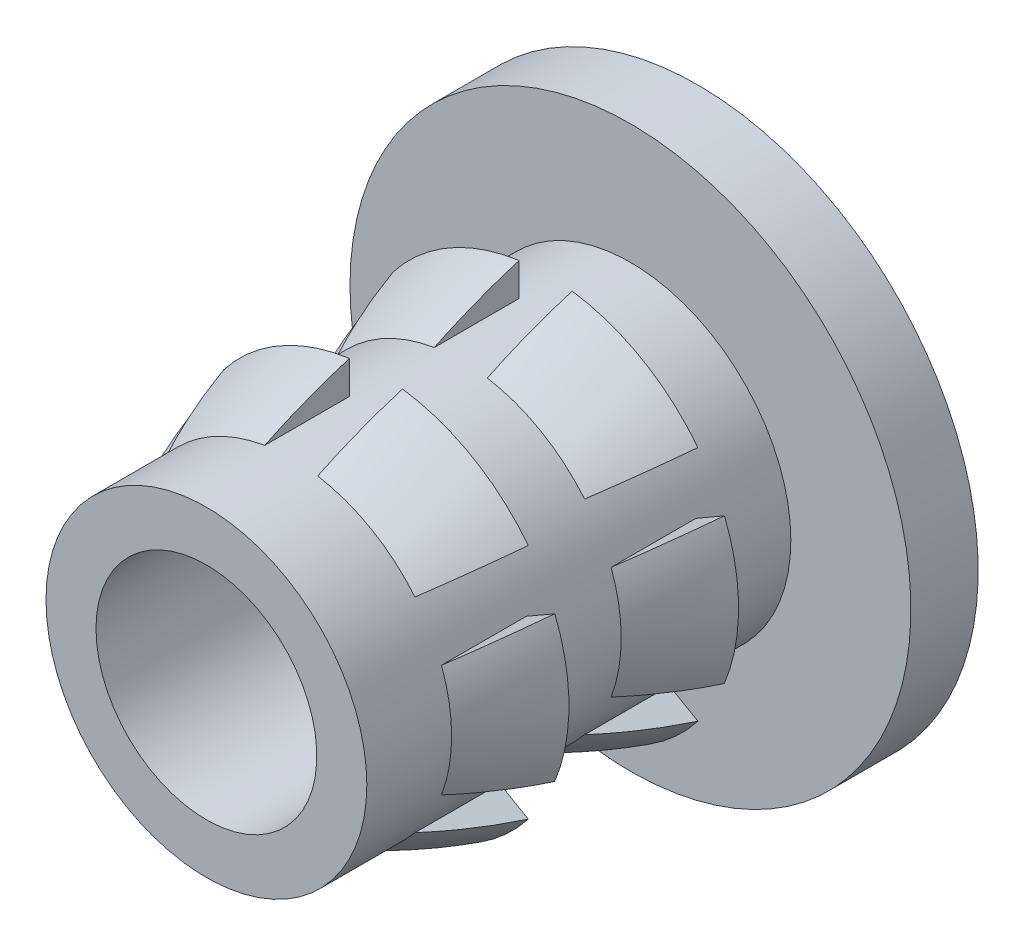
ISO-10303-21;
HEADER;
FILE_DESCRIPTION(('STEP AP214'),'2;1');
FILE_NAME('part.step','',(''),(''),'','','');
FILE_SCHEMA(('AUTOMOTIVE_DESIGN { 1 0 10303 214 1 1 1 1 }'));
ENDSEC;
DATA;
#1=APPLICATION_CONTEXT('core data for automotive mechanical design processes');
#2=APPLICATION_PROTOCOL_DEFINITION('international standard','automotive_design',2000,#1);
#3=PRODUCT_CONTEXT('',#1,'mechanical');
#4=PRODUCT('Part','Part','',(#3));
#5=PRODUCT_RELATED_PRODUCT_CATEGORY('part','',(#4));
#6=PRODUCT_DEFINITION_FORMATION('','',#4);
#7=PRODUCT_DEFINITION_CONTEXT('part definition',#1,'design');
#8=PRODUCT_DEFINITION('design','',#6,#7);
#9=PRODUCT_DEFINITION_SHAPE('','',#8);
#10=(LENGTH_UNIT() NAMED_UNIT(*) SI_UNIT(.MILLI.,.METRE.));
#11=(NAMED_UNIT(*) PLANE_ANGLE_UNIT() SI_UNIT($,.RADIAN.));
#12=(NAMED_UNIT(*) SI_UNIT($,.STERADIAN.) SOLID_ANGLE_UNIT());
#13=UNCERTAINTY_MEASURE_WITH_UNIT(LENGTH_MEASURE(1.E-05),#10,'distance_accuracy_value','');
#14=(GEOMETRIC_REPRESENTATION_CONTEXT(3) GLOBAL_UNCERTAINTY_ASSIGNED_CONTEXT((#13)) GLOBAL_UNIT_ASSIGNED_CONTEXT((#10,
#11,#12)) REPRESENTATION_CONTEXT('',''));
#15=CARTESIAN_POINT('',(0.,0.,0.));
#16=DIRECTION('',(0.,0.,1.));
#17=DIRECTION('',(1.,0.,0.));
#18=AXIS2_PLACEMENT_3D('',#15,#16,#17);
#19=CARTESIAN_POINT('',(10.75384757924,0.,-17.2405307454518));
#20=DIRECTION('',(0.,0.,1.));
#21=DIRECTION('',(1.,0.,0.));
#22=AXIS2_PLACEMENT_3D('',#19,#20,#21);
#23=PLANE('',#22);
#24=CARTESIAN_POINT('',(8.93774757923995,0.,-17.2405307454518));
#25=DIRECTION('',(0.,0.,-1.));
#26=DIRECTION('',(-1.,0.,0.));
#27=AXIS2_PLACEMENT_3D('',#24,#25,#26);
#28=CIRCLE('',#27,1.8161);
#29=CARTESIAN_POINT('',(7.53656596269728,1.15538274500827,-17.2405307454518));
#30=VERTEX_POINT('',#29);
#31=CARTESIAN_POINT('',(8.63774757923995,1.79115024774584,-17.2405307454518));
#32=VERTEX_POINT('',#31);
#33=EDGE_CURVE('E296',#30,#32,#28,.T.);
#34=ORIENTED_EDGE('',*,*,#33,.F.);
#35=DIRECTION('',(-0.866025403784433,0.50000000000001,0.));
#36=VECTOR('',#35,1.);
#37=CARTESIAN_POINT('',(10.4498225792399,-0.52658674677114,-17.2405307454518));
#38=LINE('',#37,#36);
#39=CARTESIAN_POINT('',(7.21392727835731,1.34165827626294,-17.2405307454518));
#40=VERTEX_POINT('',#39);
#41=EDGE_CURVE('E568',#30,#40,#38,.T.);
#42=ORIENTED_EDGE('',*,*,#41,.T.);
#43=CARTESIAN_POINT('',(8.93774757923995,0.,-17.2405307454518));
#44=DIRECTION('',(0.,0.,-1.));
#45=DIRECTION('',(-1.,0.,0.));
#46=AXIS2_PLACEMENT_3D('',#43,#44,#45);
#47=CIRCLE('',#46,2.1844);
#48=CARTESIAN_POINT('',(8.63774757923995,2.16370131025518,-17.2405307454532));
#49=VERTEX_POINT('',#48);
#50=EDGE_CURVE('E603',#40,#49,#47,.T.);
#51=ORIENTED_EDGE('',*,*,#50,.T.);
#52=DIRECTION('',(0.,-1.,0.));
#53=VECTOR('',#52,1.);
#54=CARTESIAN_POINT('',(8.63774757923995,0.,-17.2405307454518));
#55=LINE('',#54,#53);
#56=EDGE_CURVE('E447',#49,#32,#55,.T.);
#57=ORIENTED_EDGE('',*,*,#56,.T.);
#58=EDGE_LOOP('',(#34,#42,#51,#57));
#59=FACE_BOUND('',#58,.T.);
#60=ADVANCED_FACE('F41',(#59),#23,.F.);
#61=CARTESIAN_POINT('',(8.93774757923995,0.,-19.077055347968));
#62=DIRECTION('',(0.,0.,-1.));
#63=DIRECTION('',(-1.,0.,0.));
#64=AXIS2_PLACEMENT_3D('',#61,#62,#63);
#65=DEGENERATE_TOROIDAL_SURFACE('',#64,4.03884641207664,6.48857600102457,.F.);
#66=ORIENTED_EDGE('',*,*,#50,.F.);
#67=CARTESIAN_POINT('',(7.21387567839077,1.34168806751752,-17.2407307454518));
#68=CARTESIAN_POINT('',(7.25638494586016,1.317145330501,-17.0759447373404));
#69=CARTESIAN_POINT('',(7.30462719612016,1.28929265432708,-16.9131818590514));
#70=CARTESIAN_POINT('',(7.38536416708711,1.24267914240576,-16.6728736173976));
#71=CARTESIAN_POINT('',(7.41366221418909,1.22634125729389,-16.5934337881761));
#72=CARTESIAN_POINT('',(7.47306506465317,1.19204500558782,-16.4358119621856));
#73=CARTESIAN_POINT('',(7.50417436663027,1.17408404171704,-16.3576322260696));
#74=CARTESIAN_POINT('',(7.53664985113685,1.1553343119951,-16.2802107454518));
#75=B_SPLINE_CURVE_WITH_KNOTS('',3,(#67,#68,#69,#70,#71,#72,#73,#74),.UNSPECIFIED.,.F.,.F.,(4,2,
2,4),(0.,0.515567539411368,0.773194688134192,1.03124165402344),.UNSPECIFIED.);
#76=CARTESIAN_POINT('',(7.53656596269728,1.15538274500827,-16.2804107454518));
#77=VERTEX_POINT('',#76);
#78=EDGE_CURVE('E562',#40,#77,#75,.T.);
#79=ORIENTED_EDGE('',*,*,#78,.T.);
#80=CARTESIAN_POINT('',(8.93774757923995,0.,-16.2804107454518));
#81=DIRECTION('',(0.,0.,-1.));
#82=DIRECTION('',(-1.,0.,0.));
#83=AXIS2_PLACEMENT_3D('',#80,#81,#82);
#84=CIRCLE('',#83,1.8161);
#85=CARTESIAN_POINT('',(8.63774757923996,1.79115024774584,-16.2804107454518));
#86=VERTEX_POINT('',#85);
#87=EDGE_CURVE('E350',#77,#86,#84,.T.);
#88=ORIENTED_EDGE('',*,*,#87,.T.);
#89=CARTESIAN_POINT('',(8.63774757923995,1.99680857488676,-16.7529502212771));
#90=CARTESIAN_POINT('',(8.63774757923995,2.06197951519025,-16.9209435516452));
#91=CARTESIAN_POINT('',(8.63774757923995,2.12005202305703,-17.0917232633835));
#92=CARTESIAN_POINT('',(8.63774757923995,2.22163662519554,-17.4376354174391));
#93=CARTESIAN_POINT('',(8.63774757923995,2.26514130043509,-17.612770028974));
#94=CARTESIAN_POINT('',(8.63774757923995,2.33733891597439,-17.9663608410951));
#95=CARTESIAN_POINT('',(8.63774757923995,2.36600815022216,-18.1448218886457));
#96=CARTESIAN_POINT('',(8.63774757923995,2.40824914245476,-18.5035846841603));
#97=CARTESIAN_POINT('',(8.63774757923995,2.42181553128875,-18.6838870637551));
#98=CARTESIAN_POINT('',(8.63774757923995,2.43374322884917,-19.0449571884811));
#99=CARTESIAN_POINT('',(8.63774757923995,2.43210765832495,-19.2257248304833));
#100=CARTESIAN_POINT('',(8.63774757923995,2.41364946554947,-19.5864830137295));
#101=CARTESIAN_POINT('',(8.63774757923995,2.39682685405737,-19.7664735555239));
#102=CARTESIAN_POINT('',(8.63774757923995,2.34810674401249,-20.1243865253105));
#103=CARTESIAN_POINT('',(8.63774757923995,2.31621060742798,-20.3023091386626));
#104=CARTESIAN_POINT('',(8.63774757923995,2.23756417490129,-20.6547756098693));
#105=CARTESIAN_POINT('',(8.63774757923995,2.19081911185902,-20.8293206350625));
#106=CARTESIAN_POINT('',(8.63774757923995,2.08263577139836,-21.1742670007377));
#107=CARTESIAN_POINT('',(8.63774757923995,2.02116179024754,-21.3446571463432));
#108=CARTESIAN_POINT('',(8.63774757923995,1.88394363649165,-21.6796389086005));
#109=CARTESIAN_POINT('',(8.63774757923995,1.80819648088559,-21.8442293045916));
#110=CARTESIAN_POINT('',(8.63774757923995,1.64290636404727,-22.1662452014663));
#111=CARTESIAN_POINT('',(8.63774757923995,1.55336862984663,-22.3236733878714));
#112=CARTESIAN_POINT('',(8.63774757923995,1.36093767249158,-22.6300666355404));
#113=CARTESIAN_POINT('',(8.63774757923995,1.25805311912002,-22.7790371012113));
#114=CARTESIAN_POINT('',(8.63774757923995,1.10606090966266,-22.9788574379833));
#115=CARTESIAN_POINT('',(8.63774757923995,1.06253347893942,-23.0340114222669));
#116=CARTESIAN_POINT('',(8.63774757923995,0.973448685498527,-23.1426610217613));
#117=CARTESIAN_POINT('',(8.63774757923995,0.927891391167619,-23.1961566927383));
#118=CARTESIAN_POINT('',(8.63774757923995,0.834821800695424,-23.3011172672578));
#119=CARTESIAN_POINT('',(8.63774757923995,0.787316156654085,-23.3525880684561));
#120=CARTESIAN_POINT('',(8.63774757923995,0.690051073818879,-23.4533458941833));
#121=CARTESIAN_POINT('',(8.63774757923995,0.640292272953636,-23.5026335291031));
#122=CARTESIAN_POINT('',(8.63774757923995,0.55496425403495,-23.5825144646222));
#123=CARTESIAN_POINT('',(8.63774757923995,0.520139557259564,-23.6139032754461));
#124=CARTESIAN_POINT('',(8.63774757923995,0.448857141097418,-23.6750764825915));
#125=CARTESIAN_POINT('',(8.63774757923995,0.412393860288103,-23.7048545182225));
#126=CARTESIAN_POINT('',(8.63774757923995,0.355964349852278,-23.7476043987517));
#127=CARTESIAN_POINT('',(8.63774757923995,0.336772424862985,-23.76159511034));
#128=CARTESIAN_POINT('',(8.63774757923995,0.297731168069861,-23.7886209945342));
#129=CARTESIAN_POINT('',(8.63774757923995,0.277882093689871,-23.8016565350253));
#130=CARTESIAN_POINT('',(8.63774757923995,0.237417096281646,-23.8263350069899));
#131=CARTESIAN_POINT('',(8.63774757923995,0.216804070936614,-23.8379826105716));
#132=CARTESIAN_POINT('',(8.63774757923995,0.174572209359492,-23.859244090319));
#133=CARTESIAN_POINT('',(8.63774757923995,0.152955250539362,-23.8688615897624));
#134=CARTESIAN_POINT('',(8.63774757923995,0.108443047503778,-23.8850320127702));
#135=CARTESIAN_POINT('',(8.63774757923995,0.0855430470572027,-23.8915725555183));
#136=CARTESIAN_POINT('',(8.63774757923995,0.0389990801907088,-23.9000687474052));
#137=CARTESIAN_POINT('',(8.63774757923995,0.0153612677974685,-23.9020554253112));
#138=CARTESIAN_POINT('',(8.63774757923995,-0.0318476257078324,-23.9008993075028));
#139=CARTESIAN_POINT('',(8.63774757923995,-0.0554182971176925,-23.897741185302));
#140=CARTESIAN_POINT('',(8.63774757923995,-0.101687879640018,-23.8871874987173));
#141=CARTESIAN_POINT('',(8.63774757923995,-0.124379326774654,-23.8797617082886));
#142=CARTESIAN_POINT('',(8.63774757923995,-0.171866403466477,-23.8607635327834));
#143=CARTESIAN_POINT('',(8.63774757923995,-0.196472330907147,-23.8487383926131));
#144=CARTESIAN_POINT('',(8.63774757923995,-0.244449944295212,-23.8224002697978));
#145=CARTESIAN_POINT('',(8.63774757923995,-0.267818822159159,-23.8080823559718));
#146=CARTESIAN_POINT('',(8.63774757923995,-0.313714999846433,-23.7778984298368));
#147=CARTESIAN_POINT('',(8.63774757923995,-0.336236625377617,-23.7620239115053));
#148=CARTESIAN_POINT('',(8.63774757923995,-0.380489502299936,-23.7292672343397));
#149=CARTESIAN_POINT('',(8.63774757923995,-0.402221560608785,-23.7123861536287));
#150=CARTESIAN_POINT('',(8.63774757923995,-0.466923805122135,-23.6602826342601));
#151=CARTESIAN_POINT('',(8.63774757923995,-0.508961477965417,-23.6239048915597));
#152=CARTESIAN_POINT('',(8.63774757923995,-0.591236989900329,-23.5491559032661));
#153=CARTESIAN_POINT('',(8.63774757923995,-0.631473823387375,-23.5107835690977));
#154=CARTESIAN_POINT('',(8.63774757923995,-0.710493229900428,-23.4324223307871));
#155=CARTESIAN_POINT('',(8.63774757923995,-0.749272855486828,-23.3924304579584));
#156=CARTESIAN_POINT('',(8.63774757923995,-0.82543143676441,-23.3111590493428));
#157=CARTESIAN_POINT('',(8.63774757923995,-0.86281072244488,-23.2698798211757));
#158=CARTESIAN_POINT('',(8.63774757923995,-0.972903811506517,-23.1444123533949));
#159=CARTESIAN_POINT('',(8.63774757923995,-1.04366624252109,-23.0585004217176));
#160=CARTESIAN_POINT('',(8.63774757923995,-1.18010146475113,-22.8828870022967));
#161=CARTESIAN_POINT('',(8.63774757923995,-1.24577901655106,-22.7931891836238));
#162=CARTESIAN_POINT('',(8.63774757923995,-1.40920189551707,-22.556684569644));
#163=CARTESIAN_POINT('',(8.63774757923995,-1.50316204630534,-22.4072389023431));
#164=CARTESIAN_POINT('',(8.63774757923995,-1.67822469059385,-22.1008887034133));
#165=CARTESIAN_POINT('',(8.63774757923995,-1.75931791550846,-21.943978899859));
#166=CARTESIAN_POINT('',(8.63774757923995,-1.90814160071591,-21.6240209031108));
#167=CARTESIAN_POINT('',(8.63774757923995,-1.97587754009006,-21.4609752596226));
#168=CARTESIAN_POINT('',(8.63774757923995,-2.09763057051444,-21.1298850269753));
#169=CARTESIAN_POINT('',(8.63774757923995,-2.15165071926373,-20.9618415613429));
#170=CARTESIAN_POINT('',(8.63774757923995,-2.24598607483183,-20.6207408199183));
#171=CARTESIAN_POINT('',(8.63774757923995,-2.28620727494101,-20.4476575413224));
#172=CARTESIAN_POINT('',(8.63774757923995,-2.35220401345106,-20.0986987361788));
#173=CARTESIAN_POINT('',(8.63774757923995,-2.3779746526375,-19.9228222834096));
#174=CARTESIAN_POINT('',(8.63774757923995,-2.41488609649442,-19.569553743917));
#175=CARTESIAN_POINT('',(8.63774757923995,-2.42602796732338,-19.392161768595));
#176=CARTESIAN_POINT('',(8.63774757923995,-2.43361501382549,-19.0370634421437));
#177=CARTESIAN_POINT('',(8.63774757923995,-2.43006008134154,-18.8593570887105));
#178=CARTESIAN_POINT('',(8.63774757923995,-2.40807548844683,-18.5015933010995));
#179=CARTESIAN_POINT('',(8.63774757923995,-2.38937434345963,-18.3215524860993));
#180=CARTESIAN_POINT('',(8.63774757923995,-2.33688520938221,-17.9637463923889));
#181=CARTESIAN_POINT('',(8.63774757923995,-2.30310231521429,-17.7859803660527));
#182=CARTESIAN_POINT('',(8.63774757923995,-2.22062195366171,-17.4337245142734));
#183=CARTESIAN_POINT('',(8.63774757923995,-2.17190730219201,-17.2592387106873));
#184=CARTESIAN_POINT('',(8.63774757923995,-2.05989551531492,-16.9150428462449));
#185=CARTESIAN_POINT('',(8.63774757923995,-1.99660074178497,-16.7453320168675));
#186=CARTESIAN_POINT('',(8.63774757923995,-1.8558353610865,-16.4119615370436));
#187=CARTESIAN_POINT('',(8.63774757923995,-1.77836992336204,-16.2482997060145));
#188=CARTESIAN_POINT('',(8.63774757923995,-1.60963775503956,-15.9281442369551));
#189=CARTESIAN_POINT('',(8.63774757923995,-1.51836360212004,-15.771654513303));
#190=CARTESIAN_POINT('',(8.63774757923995,-1.32259459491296,-15.4674643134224));
#191=CARTESIAN_POINT('',(8.63774757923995,-1.21812093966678,-15.3197502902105));
#192=CARTESIAN_POINT('',(8.63774757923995,-1.05158332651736,-15.1060195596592));
#193=CARTESIAN_POINT('',(8.63774757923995,-0.99445929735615,-15.0361107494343));
#194=CARTESIAN_POINT('',(8.63774757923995,-0.876821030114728,-14.8992154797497));
#195=CARTESIAN_POINT('',(8.63774757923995,-0.816307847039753,-14.8322281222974));
#196=CARTESIAN_POINT('',(8.63774757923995,-0.722787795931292,-14.7344505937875));
#197=CARTESIAN_POINT('',(8.63774757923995,-0.691171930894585,-14.7023234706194));
#198=CARTESIAN_POINT('',(8.63774757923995,-0.626909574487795,-14.6390989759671));
#199=CARTESIAN_POINT('',(8.63774757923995,-0.594262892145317,-14.608001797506));
#200=CARTESIAN_POINT('',(8.63774757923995,-0.527867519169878,-14.5471671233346));
#201=CARTESIAN_POINT('',(8.63774757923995,-0.494121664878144,-14.5174265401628));
#202=CARTESIAN_POINT('',(8.63774757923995,-0.42517854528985,-14.459689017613));
#203=CARTESIAN_POINT('',(8.63774757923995,-0.3899821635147,-14.4316910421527));
#204=CARTESIAN_POINT('',(8.63774757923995,-0.328001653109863,-14.386139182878));
#205=CARTESIAN_POINT('',(8.63774757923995,-0.301722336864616,-14.3679036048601));
#206=CARTESIAN_POINT('',(8.63774757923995,-0.247705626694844,-14.3335781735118));
#207=CARTESIAN_POINT('',(8.63774757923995,-0.219966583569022,-14.3174908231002));
#208=CARTESIAN_POINT('',(8.63774757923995,-0.169226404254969,-14.2923847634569));
#209=CARTESIAN_POINT('',(8.63774757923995,-0.146619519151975,-14.2825920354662));
#210=CARTESIAN_POINT('',(8.63774757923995,-0.10020073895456,-14.2665676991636));
#211=CARTESIAN_POINT('',(8.63774757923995,-0.0763944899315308,-14.26032084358));
#212=CARTESIAN_POINT('',(8.63774757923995,-0.0324845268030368,-14.253548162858));
#213=CARTESIAN_POINT('',(8.63774757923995,-0.0125186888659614,-14.2521724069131));
#214=CARTESIAN_POINT('',(8.63774757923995,0.0273225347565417,-14.2530548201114));
#215=CARTESIAN_POINT('',(8.63774757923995,0.0471979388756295,-14.2553122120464));
#216=CARTESIAN_POINT('',(8.63774757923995,0.0932471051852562,-14.2643258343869));
#217=CARTESIAN_POINT('',(8.63774757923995,0.119150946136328,-14.2723950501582));
#218=CARTESIAN_POINT('',(8.63774757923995,0.169541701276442,-14.2922890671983));
#219=CARTESIAN_POINT('',(8.63774757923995,0.194018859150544,-14.3041367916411));
#220=CARTESIAN_POINT('',(8.63774757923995,0.237692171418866,-14.3279190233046));
#221=CARTESIAN_POINT('',(8.63774757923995,0.257084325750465,-14.3395040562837));
#222=CARTESIAN_POINT('',(8.63774757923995,0.295171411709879,-14.3637769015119));
#223=CARTESIAN_POINT('',(8.63774757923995,0.313865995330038,-14.3764652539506));
#224=CARTESIAN_POINT('',(8.63774757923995,0.369188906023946,-14.4157555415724));
#225=CARTESIAN_POINT('',(8.63774757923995,0.404975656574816,-14.4435351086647));
#226=CARTESIAN_POINT('',(8.63774757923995,0.475139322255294,-14.5011020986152));
#227=CARTESIAN_POINT('',(8.63774757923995,0.509508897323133,-14.530898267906));
#228=CARTESIAN_POINT('',(8.63774757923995,0.576957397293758,-14.5918240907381));
#229=CARTESIAN_POINT('',(8.63774757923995,0.610037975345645,-14.622951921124));
#230=CARTESIAN_POINT('',(8.63774757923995,0.696702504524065,-14.7072554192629));
#231=CARTESIAN_POINT('',(8.63774757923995,0.749360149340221,-14.7613833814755));
#232=CARTESIAN_POINT('',(8.63774757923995,0.852163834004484,-14.8719829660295));
#233=CARTESIAN_POINT('',(8.63774757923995,0.902309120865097,-14.9284552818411));
#234=CARTESIAN_POINT('',(8.63774757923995,1.04933684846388,-15.1010536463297));
#235=CARTESIAN_POINT('',(8.63774757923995,1.14267410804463,-15.2202246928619));
#236=CARTESIAN_POINT('',(8.63774757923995,1.31977520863,-15.4647508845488));
#237=CARTESIAN_POINT('',(8.63774757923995,1.40357349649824,-15.5900812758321));
#238=CARTESIAN_POINT('',(8.63774757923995,1.56178267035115,-15.8463860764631));
#239=CARTESIAN_POINT('',(8.63774757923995,1.63620193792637,-15.9773553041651));
#240=CARTESIAN_POINT('',(8.63774757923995,1.7602315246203,-16.2150105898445));
#241=CARTESIAN_POINT('',(8.63774757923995,1.81170502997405,-16.3207300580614));
#242=CARTESIAN_POINT('',(8.63774757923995,1.90873065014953,-16.5348870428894));
#243=CARTESIAN_POINT('',(8.63774757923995,1.95428096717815,-16.6433253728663));
#244=CARTESIAN_POINT('',(8.63774757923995,1.99680857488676,-16.7529502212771));
#245=B_SPLINE_CURVE_WITH_KNOTS('',3,(#89,#90,#91,#92,#93,#94,#95,#96,#97,#98,#99,#100,#101,#102,
#103,#104,#105,#106,#107,#108,#109,#110,#111,#112,#113,#114,#115,#116,#117,#118,#119,#120,#121,
#122,#123,#124,#125,#126,#127,#128,#129,#130,#131,#132,#133,#134,#135,#136,#137,#138,#139,#140,
#141,#142,#143,#144,#145,#146,#147,#148,#149,#150,#151,#152,#153,#154,#155,#156,#157,#158,#159,
#160,#161,#162,#163,#164,#165,#166,#167,#168,#169,#170,#171,#172,#173,#174,#175,#176,#177,#178,
#179,#180,#181,#182,#183,#184,#185,#186,#187,#188,#189,#190,#191,#192,#193,#194,#195,#196,#197,
#198,#199,#200,#201,#202,#203,#204,#205,#206,#207,#208,#209,#210,#211,#212,#213,#214,#215,#216,
#217,#218,#219,#220,#221,#222,#223,#224,#225,#226,#227,#228,#229,#230,#231,#232,#233,#234,#235,
#236,#237,#238,#239,#240,#241,#242,#243,#244),.UNSPECIFIED.,.T.,.F.,(4,2,2,2,2,2,2,2,2,2,2,2,2,
2,2,2,2,2,2,2,2,2,2,2,2,2,2,2,2,2,2,2,2,2,2,2,2,2,2,2,2,2,2,2,2,2,2,2,2,2,2,2,2,2,2,2,2,2,2,2,2,
2,2,2,2,2,2,2,2,2,2,2,2,2,2,2,2,4),(0.,0.540467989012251,1.08121080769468,1.622815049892,
2.16461177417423,2.70629727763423,3.24798239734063,3.78961858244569,4.33106410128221,
4.87383563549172,5.41672073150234,5.95940056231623,6.50172962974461,6.71247757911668,
6.92321843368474,7.13329152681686,7.34330551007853,7.48392096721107,7.62505629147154,
7.69628695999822,7.76749004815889,7.83844624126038,7.90927470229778,7.98038576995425,
8.05101084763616,8.12184670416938,8.19319055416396,8.27515624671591,8.35730065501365,
8.43992201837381,8.52245642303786,8.68912360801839,8.85588272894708,9.02296274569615,
9.19000313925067,9.52368731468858,9.85705521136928,10.3859509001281,10.9152258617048,
11.4442832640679,11.9732226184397,12.5056970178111,13.0383518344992,13.5709678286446,
14.1035877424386,14.6459714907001,15.1881721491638,15.7309991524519,16.2737382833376,
16.8162798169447,17.3591140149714,17.9010872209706,18.1718437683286,18.4425164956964,
18.5777228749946,18.7129544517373,18.8478610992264,18.9826867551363,19.078589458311,
19.174602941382,19.2483363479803,19.3217502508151,19.3814673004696,19.4411715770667,
19.5220788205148,19.6034865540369,19.6712076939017,19.7389621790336,19.874751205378,
20.0111724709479,20.1474125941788,20.3738563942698,20.6003676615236,21.0539684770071,
21.5058754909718,21.9573757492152,22.3099539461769,22.6626389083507),.UNSPECIFIED.);
#246=EDGE_CURVE('E1151',#86,#49,#245,.T.);
#247=ORIENTED_EDGE('',*,*,#246,.T.);
#248=EDGE_LOOP('',(#66,#79,#88,#247));
#249=FACE_BOUND('',#248,.T.);
#250=ADVANCED_FACE('F688',(#249),#65,.F.);
#251=CARTESIAN_POINT('',(10.75384757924,0.,-15.3202907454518));
#252=DIRECTION('',(0.,0.,1.));
#253=DIRECTION('',(1.,0.,0.));
#254=AXIS2_PLACEMENT_3D('',#251,#252,#253);
#255=PLANE('',#254);
#256=CARTESIAN_POINT('',(8.93774757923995,0.,-15.3202907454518));
#257=DIRECTION('',(0.,0.,-1.));
#258=DIRECTION('',(-1.,0.,0.));
#259=AXIS2_PLACEMENT_3D('',#256,#257,#258);
#260=CIRCLE('',#259,1.8161);
#261=CARTESIAN_POINT('',(7.53656596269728,1.15538274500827,-15.3202907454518));
#262=VERTEX_POINT('',#261);
#263=CARTESIAN_POINT('',(8.63774757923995,1.79115024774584,-15.3202907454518));
#264=VERTEX_POINT('',#263);
#265=EDGE_CURVE('E352',#262,#264,#260,.T.);
#266=ORIENTED_EDGE('',*,*,#265,.F.);
#267=DIRECTION('',(-0.866025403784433,0.50000000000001,0.));
#268=VECTOR('',#267,1.);
#269=CARTESIAN_POINT('',(10.4498225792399,-0.52658674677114,-15.3202907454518));
#270=LINE('',#269,#268);
#271=CARTESIAN_POINT('',(7.21392727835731,1.34165827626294,-15.3202907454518));
#272=VERTEX_POINT('',#271);
#273=EDGE_CURVE('E560',#262,#272,#270,.T.);
#274=ORIENTED_EDGE('',*,*,#273,.T.);
#275=CARTESIAN_POINT('',(8.93774757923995,0.,-15.3202907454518));
#276=DIRECTION('',(0.,0.,-1.));
#277=DIRECTION('',(-1.,0.,0.));
#278=AXIS2_PLACEMENT_3D('',#275,#276,#277);
#279=CIRCLE('',#278,2.1844);
#280=CARTESIAN_POINT('',(8.63774757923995,2.16370131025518,-15.3202907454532));
#281=VERTEX_POINT('',#280);
#282=EDGE_CURVE('E366',#272,#281,#279,.T.);
#283=ORIENTED_EDGE('',*,*,#282,.T.);
#284=DIRECTION('',(0.,-1.,0.));
#285=VECTOR('',#284,1.);
#286=CARTESIAN_POINT('',(8.63774757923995,0.,-15.3202907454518));
#287=LINE('',#286,#285);
#288=EDGE_CURVE('E748',#281,#264,#287,.T.);
#289=ORIENTED_EDGE('',*,*,#288,.T.);
#290=EDGE_LOOP('',(#266,#274,#283,#289));
#291=FACE_BOUND('',#290,.T.);
#292=ADVANCED_FACE('F694',(#291),#255,.F.);
#293=CARTESIAN_POINT('',(8.93774757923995,0.,-17.1506228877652));
#294=DIRECTION('',(0.,0.,-1.));
#295=DIRECTION('',(-1.,0.,0.));
#296=AXIS2_PLACEMENT_3D('',#293,#294,#295);
#297=DEGENERATE_TOROIDAL_SURFACE('',#296,4.02270330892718,6.47134045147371,.F.);
#298=ORIENTED_EDGE('',*,*,#282,.F.);
#299=CARTESIAN_POINT('',(7.21387571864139,1.34168804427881,-15.3204907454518));
#300=CARTESIAN_POINT('',(7.25635476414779,1.31716275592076,-15.155693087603));
#301=CARTESIAN_POINT('',(7.3045824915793,1.28931846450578,-14.9929227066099));
#302=CARTESIAN_POINT('',(7.38531977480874,1.24270477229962,-14.7526135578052));
#303=CARTESIAN_POINT('',(7.41362155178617,1.22636473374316,-14.6731752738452));
#304=CARTESIAN_POINT('',(7.47303927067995,1.1920598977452,-14.5155598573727));
#305=CARTESIAN_POINT('',(7.50415974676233,1.17409248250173,-14.4373850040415));
#306=CARTESIAN_POINT('',(7.53664989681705,1.15533428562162,-14.3599707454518));
#307=B_SPLINE_CURVE_WITH_KNOTS('',3,(#299,#300,#301,#302,#303,#304,#305,#306),.UNSPECIFIED.,.F.,
.F.,(4,2,2,4),(0.,0.51556976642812,0.773197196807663,1.03124666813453),.UNSPECIFIED.);
#308=CARTESIAN_POINT('',(7.53656596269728,1.15538274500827,-14.3601707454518));
#309=VERTEX_POINT('',#308);
#310=EDGE_CURVE('E290',#272,#309,#307,.T.);
#311=ORIENTED_EDGE('',*,*,#310,.T.);
#312=CARTESIAN_POINT('',(8.93774757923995,0.,-14.3601707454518));
#313=DIRECTION('',(0.,0.,-1.));
#314=DIRECTION('',(-1.,0.,0.));
#315=AXIS2_PLACEMENT_3D('',#312,#313,#314);
#316=CIRCLE('',#315,1.8161);
#317=CARTESIAN_POINT('',(8.63774757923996,1.79115024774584,-14.3601707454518));
#318=VERTEX_POINT('',#317);
#319=EDGE_CURVE('E382',#309,#318,#316,.T.);
#320=ORIENTED_EDGE('',*,*,#319,.T.);
#321=CARTESIAN_POINT('',(8.63774757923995,1.99685989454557,-14.8326903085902));
#322=CARTESIAN_POINT('',(8.63774757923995,2.06185846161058,-15.0002393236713));
#323=CARTESIAN_POINT('',(8.63774757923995,2.11977748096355,-15.1705674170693));
#324=CARTESIAN_POINT('',(8.63774757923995,2.22109351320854,-15.5155648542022));
#325=CARTESIAN_POINT('',(8.63774757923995,2.26448312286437,-15.6902363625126));
#326=CARTESIAN_POINT('',(8.63774757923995,2.33648956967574,-16.0428922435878));
#327=CARTESIAN_POINT('',(8.63774757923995,2.365082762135,-16.2208814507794));
#328=CARTESIAN_POINT('',(8.63774757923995,2.4072113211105,-16.5786957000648));
#329=CARTESIAN_POINT('',(8.63774757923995,2.42074133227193,-16.7585213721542));
#330=CARTESIAN_POINT('',(8.63774757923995,2.43263613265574,-17.1186350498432));
#331=CARTESIAN_POINT('',(8.63774757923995,2.43100418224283,-17.298922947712));
#332=CARTESIAN_POINT('',(8.63774757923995,2.41259340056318,-17.6587236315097));
#333=CARTESIAN_POINT('',(8.63774757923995,2.3958145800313,-17.8382364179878));
#334=CARTESIAN_POINT('',(8.63774757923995,2.34722198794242,-18.1951990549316));
#335=CARTESIAN_POINT('',(8.63774757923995,2.31540959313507,-18.3726490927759));
#336=CARTESIAN_POINT('',(8.63774757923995,2.2369700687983,-18.7241792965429));
#337=CARTESIAN_POINT('',(8.63774757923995,2.19034815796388,-18.8982606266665));
#338=CARTESIAN_POINT('',(8.63774757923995,2.08245068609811,-19.2422891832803));
#339=CARTESIAN_POINT('',(8.63774757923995,2.02113963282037,-19.4122252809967));
#340=CARTESIAN_POINT('',(8.63774757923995,1.88428593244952,-19.7463142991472));
#341=CARTESIAN_POINT('',(8.63774757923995,1.80874032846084,-19.9104660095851));
#342=CARTESIAN_POINT('',(8.63774757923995,1.64389122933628,-20.2316243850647));
#343=CARTESIAN_POINT('',(8.63774757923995,1.55459294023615,-20.3886337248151));
#344=CARTESIAN_POINT('',(8.63774757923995,1.36267897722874,-20.6942139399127));
#345=CARTESIAN_POINT('',(8.63774757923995,1.2600719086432,-20.8427901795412));
#346=CARTESIAN_POINT('',(8.63774757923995,1.1083261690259,-21.0423103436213));
#347=CARTESIAN_POINT('',(8.63774757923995,1.06474113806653,-21.097537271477));
#348=CARTESIAN_POINT('',(8.63774757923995,0.975532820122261,-21.206325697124));
#349=CARTESIAN_POINT('',(8.63774757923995,0.929909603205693,-21.25988725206));
#350=CARTESIAN_POINT('',(8.63774757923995,0.836700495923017,-21.3649729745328));
#351=CARTESIAN_POINT('',(8.63774757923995,0.789121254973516,-21.4165030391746));
#352=CARTESIAN_POINT('',(8.63774757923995,0.69170322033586,-21.517372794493));
#353=CARTESIAN_POINT('',(8.63774757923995,0.641865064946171,-21.5667130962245));
#354=CARTESIAN_POINT('',(8.63774757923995,0.55638081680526,-21.6466983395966));
#355=CARTESIAN_POINT('',(8.63774757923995,0.521479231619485,-21.6781392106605));
#356=CARTESIAN_POINT('',(8.63774757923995,0.450042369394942,-21.7394129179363));
#357=CARTESIAN_POINT('',(8.63774757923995,0.413501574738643,-21.7692394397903));
#358=CARTESIAN_POINT('',(8.63774757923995,0.356957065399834,-21.8120607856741));
#359=CARTESIAN_POINT('',(8.63774757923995,0.337727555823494,-21.8260747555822));
#360=CARTESIAN_POINT('',(8.63774757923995,0.298611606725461,-21.8531477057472));
#361=CARTESIAN_POINT('',(8.63774757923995,0.278725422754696,-21.8662070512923));
#362=CARTESIAN_POINT('',(8.63774757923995,0.238185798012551,-21.890935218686));
#363=CARTESIAN_POINT('',(8.63774757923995,0.217535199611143,-21.9026086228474));
#364=CARTESIAN_POINT('',(8.63774757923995,0.175228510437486,-21.9239239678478));
#365=CARTESIAN_POINT('',(8.63774757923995,0.15357428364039,-21.9335695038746));
#366=CARTESIAN_POINT('',(8.63774757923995,0.108955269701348,-21.949809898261));
#367=CARTESIAN_POINT('',(8.63774757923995,0.0859840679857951,-21.9563880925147));
#368=CARTESIAN_POINT('',(8.63774757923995,0.0392927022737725,-21.9649429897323));
#369=CARTESIAN_POINT('',(8.63774757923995,0.0155787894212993,-21.9669510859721));
#370=CARTESIAN_POINT('',(8.63774757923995,-0.031786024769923,-21.9658132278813));
#371=CARTESIAN_POINT('',(8.63774757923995,-0.0554365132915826,-21.9626515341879));
#372=CARTESIAN_POINT('',(8.63774757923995,-0.101863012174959,-21.9520704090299));
#373=CARTESIAN_POINT('',(8.63774757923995,-0.124631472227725,-21.9446203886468));
#374=CARTESIAN_POINT('',(8.63774757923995,-0.172286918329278,-21.9255556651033));
#375=CARTESIAN_POINT('',(8.63774757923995,-0.19698299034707,-21.9134853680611));
#376=CARTESIAN_POINT('',(8.63774757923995,-0.245136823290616,-21.8870494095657));
#377=CARTESIAN_POINT('',(8.63774757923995,-0.268591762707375,-21.8726787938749));
#378=CARTESIAN_POINT('',(8.63774757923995,-0.314657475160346,-21.8423852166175));
#379=CARTESIAN_POINT('',(8.63774757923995,-0.337262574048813,-21.8264537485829));
#380=CARTESIAN_POINT('',(8.63774757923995,-0.381680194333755,-21.7935803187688));
#381=CARTESIAN_POINT('',(8.63774757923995,-0.403493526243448,-21.776639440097));
#382=CARTESIAN_POINT('',(8.63774757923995,-0.468365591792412,-21.7244100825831));
#383=CARTESIAN_POINT('',(8.63774757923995,-0.510493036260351,-21.6879675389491));
#384=CARTESIAN_POINT('',(8.63774757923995,-0.592945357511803,-21.6130852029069));
#385=CARTESIAN_POINT('',(8.63774757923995,-0.633269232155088,-21.5746443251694));
#386=CARTESIAN_POINT('',(8.63774757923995,-0.712458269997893,-21.4961410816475));
#387=CARTESIAN_POINT('',(8.63774757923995,-0.751320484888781,-21.4560757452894));
#388=CARTESIAN_POINT('',(8.63774757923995,-0.827638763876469,-21.3746519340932));
#389=CARTESIAN_POINT('',(8.63774757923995,-0.865095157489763,-21.333293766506));
#390=CARTESIAN_POINT('',(8.63774757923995,-0.975408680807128,-21.2075828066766));
#391=CARTESIAN_POINT('',(8.63774757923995,-1.04630522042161,-21.1214980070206));
#392=CARTESIAN_POINT('',(8.63774757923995,-1.18298003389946,-20.9455177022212));
#393=CARTESIAN_POINT('',(8.63774757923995,-1.24876307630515,-20.8556258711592));
#394=CARTESIAN_POINT('',(8.63774757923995,-1.41198500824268,-20.619222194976));
#395=CARTESIAN_POINT('',(8.63774757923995,-1.50566925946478,-20.4700950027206));
#396=CARTESIAN_POINT('',(8.63774757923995,-1.6802061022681,-20.1644038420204));
#397=CARTESIAN_POINT('',(8.63774757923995,-1.76104950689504,-20.0078346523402));
#398=CARTESIAN_POINT('',(8.63774757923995,-1.90940107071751,-19.6885740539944));
#399=CARTESIAN_POINT('',(8.63774757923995,-1.97691451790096,-19.5258851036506));
#400=CARTESIAN_POINT('',(8.63774757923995,-2.09824922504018,-19.1955238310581));
#401=CARTESIAN_POINT('',(8.63774757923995,-2.15207351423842,-19.0278526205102));
#402=CARTESIAN_POINT('',(8.63774757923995,-2.24603644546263,-18.6875369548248));
#403=CARTESIAN_POINT('',(8.63774757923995,-2.28608326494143,-18.5148671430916));
#404=CARTESIAN_POINT('',(8.63774757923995,-2.35176361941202,-18.1667480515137));
#405=CARTESIAN_POINT('',(8.63774757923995,-2.37739226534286,-17.9912978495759));
#406=CARTESIAN_POINT('',(8.63774757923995,-2.41405286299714,-17.6388928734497));
#407=CARTESIAN_POINT('',(8.63774757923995,-2.42508595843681,-17.4619382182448));
#408=CARTESIAN_POINT('',(8.63774757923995,-2.43248948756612,-17.1077220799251));
#409=CARTESIAN_POINT('',(8.63774757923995,-2.42885981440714,-16.9304605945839));
#410=CARTESIAN_POINT('',(8.63774757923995,-2.40676099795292,-16.5736284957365));
#411=CARTESIAN_POINT('',(8.63774757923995,-2.38802343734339,-16.394074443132));
#412=CARTESIAN_POINT('',(8.63774757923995,-2.33550241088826,-16.0372430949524));
#413=CARTESIAN_POINT('',(8.63774757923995,-2.30172402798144,-15.8599650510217));
#414=CARTESIAN_POINT('',(8.63774757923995,-2.21929382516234,-15.5086844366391));
#415=CARTESIAN_POINT('',(8.63774757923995,-2.17062493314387,-15.3346858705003));
#416=CARTESIAN_POINT('',(8.63774757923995,-2.05874554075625,-14.9914586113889));
#417=CARTESIAN_POINT('',(8.63774757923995,-1.99553737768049,-14.8222291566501));
#418=CARTESIAN_POINT('',(8.63774757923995,-1.85498687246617,-14.4898149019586));
#419=CARTESIAN_POINT('',(8.63774757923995,-1.7776499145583,-14.3266278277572));
#420=CARTESIAN_POINT('',(8.63774757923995,-1.60921578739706,-14.0074096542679));
#421=CARTESIAN_POINT('',(8.63774757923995,-1.51811126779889,-13.8513824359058));
#422=CARTESIAN_POINT('',(8.63774757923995,-1.32272177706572,-13.5480985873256));
#423=CARTESIAN_POINT('',(8.63774757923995,-1.2184578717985,-13.4008284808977));
#424=CARTESIAN_POINT('',(8.63774757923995,-1.05226807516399,-13.1877439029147));
#425=CARTESIAN_POINT('',(8.63774757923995,-0.995265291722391,-13.1180469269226));
#426=CARTESIAN_POINT('',(8.63774757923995,-0.877882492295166,-12.9815666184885));
#427=CARTESIAN_POINT('',(8.63774757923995,-0.817503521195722,-12.9147823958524));
#428=CARTESIAN_POINT('',(8.63774757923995,-0.724088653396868,-12.8171832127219));
#429=CARTESIAN_POINT('',(8.63774757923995,-0.692433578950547,-12.7850401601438));
#430=CARTESIAN_POINT('',(8.63774757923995,-0.628091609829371,-12.7217859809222));
#431=CARTESIAN_POINT('',(8.63774757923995,-0.595404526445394,-12.6906750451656));
#432=CARTESIAN_POINT('',(8.63774757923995,-0.528928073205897,-12.6298143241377));
#433=CARTESIAN_POINT('',(8.63774757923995,-0.495141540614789,-12.6000614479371));
#434=CARTESIAN_POINT('',(8.63774757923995,-0.426118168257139,-12.5422992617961));
#435=CARTESIAN_POINT('',(8.63774757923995,-0.390882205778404,-12.5142889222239));
#436=CARTESIAN_POINT('',(8.63774757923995,-0.328812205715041,-12.4686938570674));
#437=CARTESIAN_POINT('',(8.63774757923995,-0.302480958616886,-12.4504298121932));
#438=CARTESIAN_POINT('',(8.63774757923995,-0.248360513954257,-12.4160468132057));
#439=CARTESIAN_POINT('',(8.63774757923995,-0.220569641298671,-12.3999304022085));
#440=CARTESIAN_POINT('',(8.63774757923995,-0.169711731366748,-12.3747587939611));
#441=CARTESIAN_POINT('',(8.63774757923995,-0.147037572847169,-12.3649324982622));
#442=CARTESIAN_POINT('',(8.63774757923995,-0.100480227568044,-12.3488514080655));
#443=CARTESIAN_POINT('',(8.63774757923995,-0.0766027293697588,-12.3425812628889));
#444=CARTESIAN_POINT('',(8.63774757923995,-0.0325767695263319,-12.3357866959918));
#445=CARTESIAN_POINT('',(8.63774757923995,-0.0125672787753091,-12.3344062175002));
#446=CARTESIAN_POINT('',(8.63774757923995,0.0273612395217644,-12.3352882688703));
#447=CARTESIAN_POINT('',(8.63774757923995,0.0472802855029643,-12.3375500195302));
#448=CARTESIAN_POINT('',(8.63774757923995,0.0934388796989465,-12.3465838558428));
#449=CARTESIAN_POINT('',(8.63774757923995,0.119407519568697,-12.3546736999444));
#450=CARTESIAN_POINT('',(8.63774757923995,0.169925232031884,-12.3746169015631));
#451=CARTESIAN_POINT('',(8.63774757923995,0.194464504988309,-12.3864932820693));
#452=CARTESIAN_POINT('',(8.63774757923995,0.23826845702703,-12.4103413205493));
#453=CARTESIAN_POINT('',(8.63774757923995,0.257728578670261,-12.4219644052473));
#454=CARTESIAN_POINT('',(8.63774757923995,0.295949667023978,-12.446316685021));
#455=CARTESIAN_POINT('',(8.63774757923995,0.314710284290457,-12.4590464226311));
#456=CARTESIAN_POINT('',(8.63774757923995,0.370229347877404,-12.498464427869));
#457=CARTESIAN_POINT('',(8.63774757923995,0.406144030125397,-12.5263337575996));
#458=CARTESIAN_POINT('',(8.63774757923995,0.476558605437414,-12.5840866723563));
#459=CARTESIAN_POINT('',(8.63774757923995,0.511051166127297,-12.6139789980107));
#460=CARTESIAN_POINT('',(8.63774757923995,0.578740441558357,-12.6751030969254));
#461=CARTESIAN_POINT('',(8.63774757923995,0.611938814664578,-12.7063330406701));
#462=CARTESIAN_POINT('',(8.63774757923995,0.698693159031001,-12.7907058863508));
#463=CARTESIAN_POINT('',(8.63774757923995,0.751329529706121,-12.8447944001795));
#464=CARTESIAN_POINT('',(8.63774757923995,0.854092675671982,-12.9553139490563));
#465=CARTESIAN_POINT('',(8.63774757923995,0.904218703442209,-13.0117456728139));
#466=CARTESIAN_POINT('',(8.63774757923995,1.05118765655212,-13.1842230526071));
#467=CARTESIAN_POINT('',(8.63774757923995,1.14448496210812,-13.3033151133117));
#468=CARTESIAN_POINT('',(8.63774757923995,1.3214964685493,-13.5476905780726));
#469=CARTESIAN_POINT('',(8.63774757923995,1.40524520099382,-13.6729491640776));
#470=CARTESIAN_POINT('',(8.63774757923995,1.56334322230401,-13.9291173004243));
#471=CARTESIAN_POINT('',(8.63774757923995,1.6377008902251,-14.0600216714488));
#472=CARTESIAN_POINT('',(8.63774757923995,1.7613943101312,-14.2971559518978));
#473=CARTESIAN_POINT('',(8.63774757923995,1.81261895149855,-14.4024065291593));
#474=CARTESIAN_POINT('',(8.63774757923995,1.90918469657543,-14.6156079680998));
#475=CARTESIAN_POINT('',(8.63774757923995,1.95452400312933,-14.7235596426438));
#476=CARTESIAN_POINT('',(8.63774757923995,1.99685989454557,-14.8326903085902));
#477=B_SPLINE_CURVE_WITH_KNOTS('',3,(#321,#322,#323,#324,#325,#326,#327,#328,#329,#330,#331,
#332,#333,#334,#335,#336,#337,#338,#339,#340,#341,#342,#343,#344,#345,#346,#347,#348,#349,#350,
#351,#352,#353,#354,#355,#356,#357,#358,#359,#360,#361,#362,#363,#364,#365,#366,#367,#368,#369,
#370,#371,#372,#373,#374,#375,#376,#377,#378,#379,#380,#381,#382,#383,#384,#385,#386,#387,#388,
#389,#390,#391,#392,#393,#394,#395,#396,#397,#398,#399,#400,#401,#402,#403,#404,#405,#406,#407,
#408,#409,#410,#411,#412,#413,#414,#415,#416,#417,#418,#419,#420,#421,#422,#423,#424,#425,#426,
#427,#428,#429,#430,#431,#432,#433,#434,#435,#436,#437,#438,#439,#440,#441,#442,#443,#444,#445,
#446,#447,#448,#449,#450,#451,#452,#453,#454,#455,#456,#457,#458,#459,#460,#461,#462,#463,#464,
#465,#466,#467,#468,#469,#470,#471,#472,#473,#474,#475,#476),.UNSPECIFIED.,.T.,.F.,(4,2,2,2,2,2,
2,2,2,2,2,2,2,2,2,2,2,2,2,2,2,2,2,2,2,2,2,2,2,2,2,2,2,2,2,2,2,2,2,2,2,2,2,2,2,2,2,2,2,2,2,2,2,2,
2,2,2,2,2,2,2,2,2,2,2,2,2,2,2,2,2,2,2,2,2,2,2,4),(0.,0.539038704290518,1.07835165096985,
1.61852377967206,2.1588878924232,2.69913581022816,3.23938334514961,3.7795814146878,
4.31958933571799,4.86091543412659,5.40235410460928,5.94358831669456,6.48447430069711,
6.6955007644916,6.90651997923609,7.11687314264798,7.32716723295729,7.46805850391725,
7.60946603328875,7.68082897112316,7.752164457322,7.82325710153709,7.89422262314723,
7.96556931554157,8.03642440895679,8.10749562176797,8.1790801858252,8.26134757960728,
8.34379459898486,8.4267189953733,8.50955596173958,8.67655411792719,8.84364394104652,
9.01105446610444,9.17842550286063,9.51276395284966,9.84678678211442,10.3744351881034,
10.902459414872,11.4302737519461,11.957971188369,12.4891203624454,13.0204495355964,
13.5517370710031,14.0830284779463,14.6239728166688,15.164734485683,15.7061184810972,
16.2474155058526,16.7885066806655,17.3298877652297,17.8704129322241,18.1404475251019,
18.4103990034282,18.5457218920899,18.6810696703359,18.8160922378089,18.9510342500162,
19.0471137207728,19.1433059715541,19.2172643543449,19.2909010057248,19.3507488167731,
19.4105838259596,19.4916937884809,19.5733066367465,19.6412612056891,19.709249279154,
19.845506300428,19.9823951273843,20.1191023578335,20.3454171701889,20.5717989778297,
21.0251383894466,21.4767825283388,21.9280208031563,22.2790090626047,22.6301042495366),.UNSPECIFIED.);
#478=EDGE_CURVE('E458',#318,#281,#477,.T.);
#479=ORIENTED_EDGE('',*,*,#478,.T.);
#480=EDGE_LOOP('',(#298,#311,#320,#479));
#481=FACE_BOUND('',#480,.T.);
#482=ADVANCED_FACE('F452',(#481),#297,.F.);
#483=CARTESIAN_POINT('',(6.91392727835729,-0.822043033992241,-17.2405307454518));
#484=VERTEX_POINT('',#483);
#485=CARTESIAN_POINT('',(6.9139272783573,0.822043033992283,-17.2405307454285));
#486=VERTEX_POINT('',#485);
#487=EDGE_CURVE('E289',#484,#486,#47,.T.);
#488=ORIENTED_EDGE('',*,*,#487,.T.);
#489=DIRECTION('',(0.866025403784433,-0.50000000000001,0.));
#490=VECTOR('',#489,1.);
#491=CARTESIAN_POINT('',(10.1498225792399,-1.0462019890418,-17.2405307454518));
#492=LINE('',#491,#490);
#493=CARTESIAN_POINT('',(7.23656596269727,0.635767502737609,-17.2405307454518));
#494=VERTEX_POINT('',#493);
#495=EDGE_CURVE('E276',#486,#494,#492,.T.);
#496=ORIENTED_EDGE('',*,*,#495,.T.);
#497=CARTESIAN_POINT('',(7.23656596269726,-0.635767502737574,-17.2405307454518));
#498=VERTEX_POINT('',#497);
#499=EDGE_CURVE('E287',#498,#494,#28,.T.);
#500=ORIENTED_EDGE('',*,*,#499,.F.);
#501=DIRECTION('',(-0.866025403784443,-0.499999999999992,0.));
#502=VECTOR('',#501,1.);
#503=CARTESIAN_POINT('',(10.14982257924,1.04620198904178,-17.2405307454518));
#504=LINE('',#503,#502);
#505=EDGE_CURVE('E1183',#498,#484,#504,.T.);
#506=ORIENTED_EDGE('',*,*,#505,.T.);
#507=EDGE_LOOP('',(#488,#496,#500,#506));
#508=FACE_BOUND('',#507,.T.);
#509=ADVANCED_FACE('F285',(#508),#23,.F.);
#510=CARTESIAN_POINT('',(7.23656596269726,-0.635767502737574,-16.2804107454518));
#511=VERTEX_POINT('',#510);
#512=CARTESIAN_POINT('',(7.23656596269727,0.635767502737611,-16.2804107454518));
#513=VERTEX_POINT('',#512);
#514=EDGE_CURVE('E353',#511,#513,#84,.T.);
#515=ORIENTED_EDGE('',*,*,#514,.T.);
#516=CARTESIAN_POINT('',(7.23664985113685,0.635719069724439,-16.2802107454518));
#517=CARTESIAN_POINT('',(7.20417436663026,0.654468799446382,-16.3576322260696));
#518=CARTESIAN_POINT('',(7.17306506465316,0.672429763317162,-16.4358119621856));
#519=CARTESIAN_POINT('',(7.11366221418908,0.706726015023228,-16.5934337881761));
#520=CARTESIAN_POINT('',(7.0853641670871,0.7230639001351,-16.6728736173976));
#521=CARTESIAN_POINT('',(7.00462719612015,0.769677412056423,-16.9131818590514));
#522=CARTESIAN_POINT('',(6.95638494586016,0.797530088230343,-17.0759447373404));
#523=CARTESIAN_POINT('',(6.91387567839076,0.822072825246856,-17.2407307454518));
#524=B_SPLINE_CURVE_WITH_KNOTS('',3,(#516,#517,#518,#519,#520,#521,#522,#523),.UNSPECIFIED.,.F.,
.F.,(4,2,2,4),(0.,0.25804696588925,0.51567411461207,1.03124165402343),.UNSPECIFIED.);
#525=EDGE_CURVE('E278',#513,#486,#524,.T.);
#526=ORIENTED_EDGE('',*,*,#525,.T.);
#527=ORIENTED_EDGE('',*,*,#487,.F.);
#528=CARTESIAN_POINT('',(6.91387567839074,-0.822072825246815,-17.2407307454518));
#529=CARTESIAN_POINT('',(6.95638494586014,-0.797530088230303,-17.0759447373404));
#530=CARTESIAN_POINT('',(7.00462719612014,-0.769677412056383,-16.9131818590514));
#531=CARTESIAN_POINT('',(7.08536416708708,-0.723063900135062,-16.6728736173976));
#532=CARTESIAN_POINT('',(7.11366221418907,-0.706726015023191,-16.5934337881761));
#533=CARTESIAN_POINT('',(7.17306506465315,-0.672429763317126,-16.4358119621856));
#534=CARTESIAN_POINT('',(7.20417436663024,-0.654468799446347,-16.3576322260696));
#535=CARTESIAN_POINT('',(7.23664985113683,-0.635719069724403,-16.2802107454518));
#536=B_SPLINE_CURVE_WITH_KNOTS('',3,(#528,#529,#530,#531,#532,#533,#534,#535),.UNSPECIFIED.,.F.,
.F.,(4,2,2,4),(0.,0.515567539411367,0.773194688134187,1.03124165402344),.UNSPECIFIED.);
#537=EDGE_CURVE('E1168',#484,#511,#536,.T.);
#538=ORIENTED_EDGE('',*,*,#537,.T.);
#539=EDGE_LOOP('',(#515,#526,#527,#538));
#540=FACE_BOUND('',#539,.T.);
#541=ADVANCED_FACE('F696',(#540),#65,.F.);
#542=CARTESIAN_POINT('',(6.91392727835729,-0.822043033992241,-15.3202907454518));
#543=VERTEX_POINT('',#542);
#544=CARTESIAN_POINT('',(6.9139272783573,0.822043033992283,-15.3202907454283));
#545=VERTEX_POINT('',#544);
#546=EDGE_CURVE('E371',#543,#545,#279,.T.);
#547=ORIENTED_EDGE('',*,*,#546,.T.);
#548=DIRECTION('',(0.866025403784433,-0.50000000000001,0.));
#549=VECTOR('',#548,1.);
#550=CARTESIAN_POINT('',(10.1498225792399,-1.0462019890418,-15.3202907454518));
#551=LINE('',#550,#549);
#552=CARTESIAN_POINT('',(7.23656596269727,0.635767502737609,-15.3202907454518));
#553=VERTEX_POINT('',#552);
#554=EDGE_CURVE('E543',#545,#553,#551,.T.);
#555=ORIENTED_EDGE('',*,*,#554,.T.);
#556=CARTESIAN_POINT('',(7.23656596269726,-0.635767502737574,-15.3202907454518));
#557=VERTEX_POINT('',#556);
#558=EDGE_CURVE('E356',#557,#553,#260,.T.);
#559=ORIENTED_EDGE('',*,*,#558,.F.);
#560=DIRECTION('',(-0.866025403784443,-0.499999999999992,0.));
#561=VECTOR('',#560,1.);
#562=CARTESIAN_POINT('',(10.14982257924,1.04620198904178,-15.3202907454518));
#563=LINE('',#562,#561);
#564=EDGE_CURVE('E1167',#557,#543,#563,.T.);
#565=ORIENTED_EDGE('',*,*,#564,.T.);
#566=EDGE_LOOP('',(#547,#555,#559,#565));
#567=FACE_BOUND('',#566,.T.);
#568=ADVANCED_FACE('F737',(#567),#255,.F.);
#569=CARTESIAN_POINT('',(7.23656596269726,-0.635767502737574,-14.3601707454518));
#570=VERTEX_POINT('',#569);
#571=CARTESIAN_POINT('',(7.23656596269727,0.635767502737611,-14.3601707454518));
#572=VERTEX_POINT('',#571);
#573=EDGE_CURVE('E389',#570,#572,#316,.T.);
#574=ORIENTED_EDGE('',*,*,#573,.T.);
#575=CARTESIAN_POINT('',(7.23664989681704,0.635719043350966,-14.3599707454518));
#576=CARTESIAN_POINT('',(7.20415974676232,0.654477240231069,-14.4373850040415));
#577=CARTESIAN_POINT('',(7.17303927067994,0.67244465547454,-14.5155598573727));
#578=CARTESIAN_POINT('',(7.11362155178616,0.7067494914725,-14.6731752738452));
#579=CARTESIAN_POINT('',(7.08531977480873,0.723089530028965,-14.7526135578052));
#580=CARTESIAN_POINT('',(7.0045824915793,0.769703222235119,-14.9929227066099));
#581=CARTESIAN_POINT('',(6.95635476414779,0.797547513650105,-15.155693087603));
#582=CARTESIAN_POINT('',(6.91387571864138,0.822072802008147,-15.3204907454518));
#583=B_SPLINE_CURVE_WITH_KNOTS('',3,(#575,#576,#577,#578,#579,#580,#581,#582),.UNSPECIFIED.,.F.,
.F.,(4,2,2,4),(0.,0.25804947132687,0.515676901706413,1.03124666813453),.UNSPECIFIED.);
#584=EDGE_CURVE('E535',#572,#545,#583,.T.);
#585=ORIENTED_EDGE('',*,*,#584,.T.);
#586=ORIENTED_EDGE('',*,*,#546,.F.);
#587=CARTESIAN_POINT('',(6.91387571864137,-0.822072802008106,-15.3204907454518));
#588=CARTESIAN_POINT('',(6.95635476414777,-0.797547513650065,-15.155693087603));
#589=CARTESIAN_POINT('',(7.00458249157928,-0.769703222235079,-14.9929227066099));
#590=CARTESIAN_POINT('',(7.08531977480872,-0.723089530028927,-14.7526135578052));
#591=CARTESIAN_POINT('',(7.11362155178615,-0.706749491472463,-14.6731752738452));
#592=CARTESIAN_POINT('',(7.17303927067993,-0.672444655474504,-14.5155598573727));
#593=CARTESIAN_POINT('',(7.20415974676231,-0.654477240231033,-14.4373850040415));
#594=CARTESIAN_POINT('',(7.23664989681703,-0.635719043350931,-14.3599707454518));
#595=B_SPLINE_CURVE_WITH_KNOTS('',3,(#587,#588,#589,#590,#591,#592,#593,#594),.UNSPECIFIED.,.F.,
.F.,(4,2,2,4),(0.,0.51556976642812,0.773197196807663,1.03124666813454),.UNSPECIFIED.);
#596=EDGE_CURVE('E527',#543,#570,#595,.T.);
#597=ORIENTED_EDGE('',*,*,#596,.T.);
#598=EDGE_LOOP('',(#574,#585,#586,#597));
#599=FACE_BOUND('',#598,.T.);
#600=ADVANCED_FACE('F729',(#599),#297,.F.);
#601=CARTESIAN_POINT('',(8.63774757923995,-2.16370131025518,-17.2405307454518));
#602=VERTEX_POINT('',#601);
#603=CARTESIAN_POINT('',(7.21392727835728,-1.34165827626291,-17.2405307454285));
#604=VERTEX_POINT('',#603);
#605=EDGE_CURVE('E740',#602,#604,#47,.T.);
#606=ORIENTED_EDGE('',*,*,#605,.T.);
#607=DIRECTION('',(0.866025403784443,0.499999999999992,0.));
#608=VECTOR('',#607,1.);
#609=CARTESIAN_POINT('',(10.44982257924,0.526586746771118,-17.2405307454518));
#610=LINE('',#609,#608);
#611=CARTESIAN_POINT('',(7.53656596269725,-1.15538274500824,-17.2405307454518));
#612=VERTEX_POINT('',#611);
#613=EDGE_CURVE('E590',#604,#612,#610,.T.);
#614=ORIENTED_EDGE('',*,*,#613,.T.);
#615=CARTESIAN_POINT('',(8.63774757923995,-1.79115024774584,-17.2405307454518));
#616=VERTEX_POINT('',#615);
#617=EDGE_CURVE('E295',#616,#612,#28,.T.);
#618=ORIENTED_EDGE('',*,*,#617,.F.);
#619=DIRECTION('',(0.,-1.,0.));
#620=VECTOR('',#619,1.);
#621=CARTESIAN_POINT('',(8.63774757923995,0.,-17.2405307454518));
#622=LINE('',#621,#620);
#623=EDGE_CURVE('E741',#616,#602,#622,.T.);
#624=ORIENTED_EDGE('',*,*,#623,.T.);
#625=EDGE_LOOP('',(#606,#614,#618,#624));
#626=FACE_BOUND('',#625,.T.);
#627=ADVANCED_FACE('F699',(#626),#23,.F.);
#628=CARTESIAN_POINT('',(8.63774757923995,-1.79115024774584,-16.2804107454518));
#629=VERTEX_POINT('',#628);
#630=CARTESIAN_POINT('',(7.53656596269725,-1.15538274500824,-16.2804107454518));
#631=VERTEX_POINT('',#630);
#632=EDGE_CURVE('E583',#629,#631,#84,.T.);
#633=ORIENTED_EDGE('',*,*,#632,.T.);
#634=CARTESIAN_POINT('',(7.53664985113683,-1.15533431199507,-16.2802107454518));
#635=CARTESIAN_POINT('',(7.50417436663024,-1.17408404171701,-16.3576322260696));
#636=CARTESIAN_POINT('',(7.47306506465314,-1.19204500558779,-16.4358119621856));
#637=CARTESIAN_POINT('',(7.41366221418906,-1.22634125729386,-16.5934337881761));
#638=CARTESIAN_POINT('',(7.38536416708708,-1.24267914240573,-16.6728736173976));
#639=CARTESIAN_POINT('',(7.30462719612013,-1.28929265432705,-16.9131818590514));
#640=CARTESIAN_POINT('',(7.25638494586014,-1.31714533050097,-17.0759447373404));
#641=CARTESIAN_POINT('',(7.21387567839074,-1.34168806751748,-17.2407307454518));
#642=B_SPLINE_CURVE_WITH_KNOTS('',3,(#634,#635,#636,#637,#638,#639,#640,#641),.UNSPECIFIED.,.F.,
.F.,(4,2,2,4),(0.,0.25804696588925,0.51567411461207,1.03124165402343),.UNSPECIFIED.);
#643=EDGE_CURVE('E588',#631,#604,#642,.T.);
#644=ORIENTED_EDGE('',*,*,#643,.T.);
#645=ORIENTED_EDGE('',*,*,#605,.F.);
#646=CARTESIAN_POINT('',(8.63774757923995,-1.99680857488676,-16.7529502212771));
#647=CARTESIAN_POINT('',(8.63774757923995,-1.93293337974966,-16.5882969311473));
#648=CARTESIAN_POINT('',(8.63774757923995,-1.86223367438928,-16.4263066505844));
#649=CARTESIAN_POINT('',(8.63774757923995,-1.70752465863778,-16.1086923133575));
#650=CARTESIAN_POINT('',(8.63774757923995,-1.62350781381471,-15.9530719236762));
#651=CARTESIAN_POINT('',(8.63774757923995,-1.44252815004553,-15.6493788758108));
#652=CARTESIAN_POINT('',(8.63774757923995,-1.34555753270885,-15.5013108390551));
#653=CARTESIAN_POINT('',(8.63774757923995,-1.19069544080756,-15.2861191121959));
#654=CARTESIAN_POINT('',(8.63774757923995,-1.13752359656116,-15.2155594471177));
#655=CARTESIAN_POINT('',(8.63774757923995,-1.02801025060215,-15.0769504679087));
#656=CARTESIAN_POINT('',(8.63774757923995,-0.971669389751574,-15.0089006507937));
#657=CARTESIAN_POINT('',(8.63774757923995,-0.877602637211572,-14.9008177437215));
#658=CARTESIAN_POINT('',(8.63774757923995,-0.840880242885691,-14.859907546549));
#659=CARTESIAN_POINT('',(8.63774757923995,-0.76609193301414,-14.7793242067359));
#660=CARTESIAN_POINT('',(8.63774757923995,-0.72802593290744,-14.7396511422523));
#661=CARTESIAN_POINT('',(8.63774757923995,-0.650594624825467,-14.6619345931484));
#662=CARTESIAN_POINT('',(8.63774757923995,-0.611235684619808,-14.6238847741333));
#663=CARTESIAN_POINT('',(8.63774757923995,-0.530829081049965,-14.5496209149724));
#664=CARTESIAN_POINT('',(8.63774757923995,-0.489782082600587,-14.5134061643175));
#665=CARTESIAN_POINT('',(8.63774757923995,-0.418735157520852,-14.4546656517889));
#666=CARTESIAN_POINT('',(8.63774757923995,-0.389330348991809,-14.4314225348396));
#667=CARTESIAN_POINT('',(8.63774757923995,-0.328919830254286,-14.3866362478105));
#668=CARTESIAN_POINT('',(8.63774757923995,-0.297904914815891,-14.3651051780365));
#669=CARTESIAN_POINT('',(8.63774757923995,-0.249550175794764,-14.335029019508));
#670=CARTESIAN_POINT('',(8.63774757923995,-0.232964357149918,-14.3252943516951));
#671=CARTESIAN_POINT('',(8.63774757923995,-0.199164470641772,-14.3069953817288));
#672=CARTESIAN_POINT('',(8.63774757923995,-0.181949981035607,-14.2984318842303));
#673=CARTESIAN_POINT('',(8.63774757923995,-0.129520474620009,-14.2753974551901));
#674=CARTESIAN_POINT('',(8.63774757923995,-0.0930761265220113,-14.2632773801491));
#675=CARTESIAN_POINT('',(8.63774757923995,-0.0346123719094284,-14.2536886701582));
#676=CARTESIAN_POINT('',(8.63774757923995,-0.0132998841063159,-14.2521202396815));
#677=CARTESIAN_POINT('',(8.63774757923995,0.029229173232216,-14.2531329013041));
#678=CARTESIAN_POINT('',(8.63774757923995,0.0504456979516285,-14.2557157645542));
#679=CARTESIAN_POINT('',(8.63774757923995,0.0987672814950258,-14.2657813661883));
#680=CARTESIAN_POINT('',(8.63774757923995,0.125584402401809,-14.2745674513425));
#681=CARTESIAN_POINT('',(8.63774757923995,0.177708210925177,-14.2960098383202));
#682=CARTESIAN_POINT('',(8.63774757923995,0.203003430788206,-14.3086919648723));
#683=CARTESIAN_POINT('',(8.63774757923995,0.248540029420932,-14.3342635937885));
#684=CARTESIAN_POINT('',(8.63774757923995,0.268967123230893,-14.3468315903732));
#685=CARTESIAN_POINT('',(8.63774757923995,0.309074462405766,-14.3731163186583));
#686=CARTESIAN_POINT('',(8.63774757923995,0.328754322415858,-14.3868336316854));
#687=CARTESIAN_POINT('',(8.63774757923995,0.386984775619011,-14.4292562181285));
#688=CARTESIAN_POINT('',(8.63774757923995,0.424641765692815,-14.4591807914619));
#689=CARTESIAN_POINT('',(8.63774757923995,0.498425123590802,-14.5210915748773));
#690=CARTESIAN_POINT('',(8.63774757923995,0.534545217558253,-14.553085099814));
#691=CARTESIAN_POINT('',(8.63774757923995,0.605405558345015,-14.6184692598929));
#692=CARTESIAN_POINT('',(8.63774757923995,0.640147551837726,-14.651858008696));
#693=CARTESIAN_POINT('',(8.63774757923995,0.729127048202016,-14.740290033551));
#694=CARTESIAN_POINT('',(8.63774757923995,0.782468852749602,-14.7962347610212));
#695=CARTESIAN_POINT('',(8.63774757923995,0.886567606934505,-14.9104881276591));
#696=CARTESIAN_POINT('',(8.63774757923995,0.937323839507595,-14.9687974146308));
#697=CARTESIAN_POINT('',(8.63774757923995,1.08603539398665,-15.1469561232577));
#698=CARTESIAN_POINT('',(8.63774757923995,1.18030643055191,-15.2699074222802));
#699=CARTESIAN_POINT('',(8.63774757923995,1.35893299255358,-15.5223036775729));
#700=CARTESIAN_POINT('',(8.63774757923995,1.4433127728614,-15.651731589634));
#701=CARTESIAN_POINT('',(8.63774757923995,1.60219731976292,-15.9164029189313));
#702=CARTESIAN_POINT('',(8.63774757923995,1.6767082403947,-16.0516426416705));
#703=CARTESIAN_POINT('',(8.63774757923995,1.81540559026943,-16.3267100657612));
#704=CARTESIAN_POINT('',(8.63774757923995,1.87962810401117,-16.4665195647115));
#705=CARTESIAN_POINT('',(8.63774757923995,1.99781031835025,-16.7504081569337));
#706=CARTESIAN_POINT('',(8.63774757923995,2.05176836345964,-16.8944879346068));
#707=CARTESIAN_POINT('',(8.63774757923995,2.19790768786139,-17.3321309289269));
#708=CARTESIAN_POINT('',(8.63774757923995,2.27435745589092,-17.6311043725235));
#709=CARTESIAN_POINT('',(8.63774757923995,2.39285612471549,-18.2878326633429));
#710=CARTESIAN_POINT('',(8.63774757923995,2.42697000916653,-18.6470259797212));
#711=CARTESIAN_POINT('',(8.63774757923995,2.43484128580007,-19.3662203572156));
#712=CARTESIAN_POINT('',(8.63774757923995,2.40857384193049,-19.7262216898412));
#713=CARTESIAN_POINT('',(8.63774757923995,2.2959695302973,-20.4391803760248));
#714=CARTESIAN_POINT('',(8.63774757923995,2.20922237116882,-20.7920725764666));
#715=CARTESIAN_POINT('',(8.63774757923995,1.97737824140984,-21.4781675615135));
#716=CARTESIAN_POINT('',(8.63774757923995,1.83232517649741,-21.8113849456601));
#717=CARTESIAN_POINT('',(8.63774757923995,1.60079441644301,-22.2388243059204));
#718=CARTESIAN_POINT('',(8.63774757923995,1.53826742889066,-22.3465001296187));
#719=CARTESIAN_POINT('',(8.63774757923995,1.40684118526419,-22.5579417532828));
#720=CARTESIAN_POINT('',(8.63774757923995,1.33794152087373,-22.6617073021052));
#721=CARTESIAN_POINT('',(8.63774757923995,1.19389894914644,-22.8647440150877));
#722=CARTESIAN_POINT('',(8.63774757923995,1.11875827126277,-22.9640167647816));
#723=CARTESIAN_POINT('',(8.63774757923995,0.962200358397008,-23.1574492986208));
#724=CARTESIAN_POINT('',(8.63774757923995,0.880786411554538,-23.2516117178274));
#725=CARTESIAN_POINT('',(8.63774757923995,0.76349798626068,-23.3774002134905));
#726=CARTESIAN_POINT('',(8.63774757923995,0.730528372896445,-23.4117555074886));
#727=CARTESIAN_POINT('',(8.63774757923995,0.663485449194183,-23.4793906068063));
#728=CARTESIAN_POINT('',(8.63774757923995,0.629411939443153,-23.5126702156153));
#729=CARTESIAN_POINT('',(8.63774757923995,0.560095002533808,-23.5778374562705));
#730=CARTESIAN_POINT('',(8.63774757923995,0.524854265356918,-23.6097279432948));
#731=CARTESIAN_POINT('',(8.63774757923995,0.452867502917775,-23.6717512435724));
#732=CARTESIAN_POINT('',(8.63774757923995,0.416122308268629,-23.701885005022));
#733=CARTESIAN_POINT('',(8.63774757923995,0.351770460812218,-23.7508718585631));
#734=CARTESIAN_POINT('',(8.63774757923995,0.324693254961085,-23.7704160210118));
#735=CARTESIAN_POINT('',(8.63774757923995,0.269073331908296,-23.8074687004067));
#736=CARTESIAN_POINT('',(8.63774757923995,0.24052835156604,-23.8249739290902));
#737=CARTESIAN_POINT('',(8.63774757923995,0.187753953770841,-23.8530508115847));
#738=CARTESIAN_POINT('',(8.63774757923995,0.163897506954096,-23.8643053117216));
#739=CARTESIAN_POINT('',(8.63774757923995,0.11479160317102,-23.8831288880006));
#740=CARTESIAN_POINT('',(8.63774757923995,0.0895488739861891,-23.8907142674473));
#741=CARTESIAN_POINT('',(8.63774757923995,0.0441352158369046,-23.8992203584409));
#742=CARTESIAN_POINT('',(8.63774757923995,0.0241923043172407,-23.9012998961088));
#743=CARTESIAN_POINT('',(8.63774757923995,-0.0157219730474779,-23.9018047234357));
#744=CARTESIAN_POINT('',(8.63774757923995,-0.0356932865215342,-23.9002338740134));
#745=CARTESIAN_POINT('',(8.63774757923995,-0.0806942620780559,-23.8928780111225));
#746=CARTESIAN_POINT('',(8.63774757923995,-0.105539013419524,-23.8860172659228));
#747=CARTESIAN_POINT('',(8.63774757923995,-0.153952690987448,-23.8685669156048));
#748=CARTESIAN_POINT('',(8.63774757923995,-0.177512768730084,-23.8579544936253));
#749=CARTESIAN_POINT('',(8.63774757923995,-0.218415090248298,-23.8369834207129));
#750=CARTESIAN_POINT('',(8.63774757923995,-0.235994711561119,-23.8270721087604));
#751=CARTESIAN_POINT('',(8.63774757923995,-0.270545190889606,-23.8062322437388));
#752=CARTESIAN_POINT('',(8.63774757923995,-0.287515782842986,-23.7953032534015));
#753=CARTESIAN_POINT('',(8.63774757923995,-0.337750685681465,-23.7613739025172));
#754=CARTESIAN_POINT('',(8.63774757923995,-0.370265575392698,-23.7372714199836));
#755=CARTESIAN_POINT('',(8.63774757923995,-0.434043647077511,-23.6871847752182));
#756=CARTESIAN_POINT('',(8.63774757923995,-0.46529970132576,-23.661191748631));
#757=CARTESIAN_POINT('',(8.63774757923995,-0.526668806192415,-23.6079745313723));
#758=CARTESIAN_POINT('',(8.63774757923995,-0.556783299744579,-23.5807519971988));
#759=CARTESIAN_POINT('',(8.63774757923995,-0.640186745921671,-23.502833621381));
#760=CARTESIAN_POINT('',(8.63774757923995,-0.692437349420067,-23.451026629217));
#761=CARTESIAN_POINT('',(8.63774757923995,-0.794462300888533,-23.3450191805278));
#762=CARTESIAN_POINT('',(8.63774757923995,-0.84423574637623,-23.2908178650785));
#763=CARTESIAN_POINT('',(8.63774757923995,-0.990274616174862,-23.1250357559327));
#764=CARTESIAN_POINT('',(8.63774757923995,-1.08311470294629,-23.0104152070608));
#765=CARTESIAN_POINT('',(8.63774757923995,-1.25981917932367,-22.7749179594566));
#766=CARTESIAN_POINT('',(8.63774757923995,-1.34370383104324,-22.6540563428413));
#767=CARTESIAN_POINT('',(8.63774757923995,-1.50258794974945,-22.406751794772));
#768=CARTESIAN_POINT('',(8.63774757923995,-1.57759356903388,-22.28031281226));
#769=CARTESIAN_POINT('',(8.63774757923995,-1.73411725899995,-21.9940937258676));
#770=CARTESIAN_POINT('',(8.63774757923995,-1.8134314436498,-21.8331035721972));
#771=CARTESIAN_POINT('',(8.63774757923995,-1.95822237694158,-21.5049504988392));
#772=CARTESIAN_POINT('',(8.63774757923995,-2.02369345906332,-21.3377850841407));
#773=CARTESIAN_POINT('',(8.63774757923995,-2.14042062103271,-20.9984165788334));
#774=CARTESIAN_POINT('',(8.63774757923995,-2.1916656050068,-20.8262096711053));
#775=CARTESIAN_POINT('',(8.63774757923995,-2.27954697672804,-20.4781348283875));
#776=CARTESIAN_POINT('',(8.63774757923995,-2.31618538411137,-20.3022674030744));
#777=CARTESIAN_POINT('',(8.63774757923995,-2.37467216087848,-19.9478365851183));
#778=CARTESIAN_POINT('',(8.63774757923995,-2.39649970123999,-19.7692697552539));
#779=CARTESIAN_POINT('',(8.63774757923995,-2.42514125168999,-19.4109360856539));
#780=CARTESIAN_POINT('',(8.63774757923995,-2.43195519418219,-19.2311692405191));
#781=CARTESIAN_POINT('',(8.63774757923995,-2.43052548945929,-18.8719444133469));
#782=CARTESIAN_POINT('',(8.63774757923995,-2.42230284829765,-18.6924863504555));
#783=CARTESIAN_POINT('',(8.63774757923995,-2.39090162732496,-18.3349456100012));
#784=CARTESIAN_POINT('',(8.63774757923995,-2.36772751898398,-18.1568625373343));
#785=CARTESIAN_POINT('',(8.63774757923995,-2.30092770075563,-17.7706234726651));
#786=CARTESIAN_POINT('',(8.63774757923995,-2.25431887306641,-17.5629769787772));
#787=CARTESIAN_POINT('',(8.63774757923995,-2.14071168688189,-17.15324912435));
#788=CARTESIAN_POINT('',(8.63774757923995,-2.07370545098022,-16.9511699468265));
#789=CARTESIAN_POINT('',(8.63774757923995,-1.99680857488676,-16.7529502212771));
#790=B_SPLINE_CURVE_WITH_KNOTS('',3,(#646,#647,#648,#649,#650,#651,#652,#653,#654,#655,#656,
#657,#658,#659,#660,#661,#662,#663,#664,#665,#666,#667,#668,#669,#670,#671,#672,#673,#674,#675,
#676,#677,#678,#679,#680,#681,#682,#683,#684,#685,#686,#687,#688,#689,#690,#691,#692,#693,#694,
#695,#696,#697,#698,#699,#700,#701,#702,#703,#704,#705,#706,#707,#708,#709,#710,#711,#712,#713,
#714,#715,#716,#717,#718,#719,#720,#721,#722,#723,#724,#725,#726,#727,#728,#729,#730,#731,#732,
#733,#734,#735,#736,#737,#738,#739,#740,#741,#742,#743,#744,#745,#746,#747,#748,#749,#750,#751,
#752,#753,#754,#755,#756,#757,#758,#759,#760,#761,#762,#763,#764,#765,#766,#767,#768,#769,#770,
#771,#772,#773,#774,#775,#776,#777,#778,#779,#780,#781,#782,#783,#784,#785,#786,#787,#788,#789),
.UNSPECIFIED.,.T.,.F.,(4,2,2,2,2,2,2,2,2,2,2,2,2,2,2,2,2,2,2,2,2,2,2,2,2,2,2,2,2,2,2,2,2,2,2,2,
2,2,2,2,2,2,2,2,2,2,2,2,2,2,2,2,2,2,2,2,2,2,2,2,2,2,2,2,2,2,2,2,2,2,2,4),(0.,0.529644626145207,
1.05958998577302,1.58985583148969,1.85483725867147,2.11976529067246,2.28466390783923,
2.44957292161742,2.61376503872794,2.77789308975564,2.89029801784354,3.00343742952,
3.0610836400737,3.11876925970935,3.23253726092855,3.29625851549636,3.36000696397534,
3.44415240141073,3.52886808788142,3.60077017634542,3.67270885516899,3.81688165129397,
3.96159545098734,4.10611955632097,4.33791403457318,4.5697724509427,5.03403085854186,
5.49712590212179,5.95993079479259,6.42107516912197,6.88229385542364,7.80470939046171,
8.88205930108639,9.9598524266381,11.0450293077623,12.1293905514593,12.5027847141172,
12.876202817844,13.2494880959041,13.6225790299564,13.765409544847,13.9082660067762,
14.0508134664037,14.1932832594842,14.2934132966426,14.3937026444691,14.4726671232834,
14.5512774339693,14.6111191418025,14.6708975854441,14.7477540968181,14.8250863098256,
14.8855899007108,14.9461196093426,15.0674268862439,15.1893450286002,15.3111035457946,
15.5317309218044,15.7524380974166,16.1944494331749,16.63543849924,17.0761201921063,
17.6138574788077,18.1518144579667,18.6901898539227,19.2284907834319,19.7675471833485,
20.3066060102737,20.8449123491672,21.3830577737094,22.020429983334,22.658048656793),.UNSPECIFIED.);
#791=EDGE_CURVE('E598',#602,#629,#790,.T.);
#792=ORIENTED_EDGE('',*,*,#791,.T.);
#793=EDGE_LOOP('',(#633,#644,#645,#792));
#794=FACE_BOUND('',#793,.T.);
#795=ADVANCED_FACE('F597',(#794),#65,.F.);
#796=CARTESIAN_POINT('',(8.63774757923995,-2.16370131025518,-15.3202907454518));
#797=VERTEX_POINT('',#796);
#798=CARTESIAN_POINT('',(7.21392727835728,-1.34165827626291,-15.3202907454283));
#799=VERTEX_POINT('',#798);
#800=EDGE_CURVE('E379',#797,#799,#279,.T.);
#801=ORIENTED_EDGE('',*,*,#800,.T.);
#802=DIRECTION('',(0.866025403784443,0.499999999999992,0.));
#803=VECTOR('',#802,1.);
#804=CARTESIAN_POINT('',(10.44982257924,0.526586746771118,-15.3202907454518));
#805=LINE('',#804,#803);
#806=CARTESIAN_POINT('',(7.53656596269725,-1.15538274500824,-15.3202907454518));
#807=VERTEX_POINT('',#806);
#808=EDGE_CURVE('E594',#799,#807,#805,.T.);
#809=ORIENTED_EDGE('',*,*,#808,.T.);
#810=CARTESIAN_POINT('',(8.63774757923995,-1.79115024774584,-15.3202907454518));
#811=VERTEX_POINT('',#810);
#812=EDGE_CURVE('E363',#811,#807,#260,.T.);
#813=ORIENTED_EDGE('',*,*,#812,.F.);
#814=DIRECTION('',(0.,-1.,0.));
#815=VECTOR('',#814,1.);
#816=CARTESIAN_POINT('',(8.63774757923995,0.,-15.3202907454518));
#817=LINE('',#816,#815);
#818=EDGE_CURVE('E1199',#811,#797,#817,.T.);
#819=ORIENTED_EDGE('',*,*,#818,.T.);
#820=EDGE_LOOP('',(#801,#809,#813,#819));
#821=FACE_BOUND('',#820,.T.);
#822=ADVANCED_FACE('F727',(#821),#255,.F.);
#823=CARTESIAN_POINT('',(8.63774757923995,-1.79115024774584,-14.3601707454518));
#824=VERTEX_POINT('',#823);
#825=CARTESIAN_POINT('',(7.53656596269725,-1.15538274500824,-14.3601707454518));
#826=VERTEX_POINT('',#825);
#827=EDGE_CURVE('E396',#824,#826,#316,.T.);
#828=ORIENTED_EDGE('',*,*,#827,.T.);
#829=CARTESIAN_POINT('',(7.53664989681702,-1.1553342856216,-14.3599707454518));
#830=CARTESIAN_POINT('',(7.5041597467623,-1.1740924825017,-14.4373850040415));
#831=CARTESIAN_POINT('',(7.47303927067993,-1.19205989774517,-14.5155598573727));
#832=CARTESIAN_POINT('',(7.41362155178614,-1.22636473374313,-14.6731752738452));
#833=CARTESIAN_POINT('',(7.38531977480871,-1.24270477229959,-14.7526135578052));
#834=CARTESIAN_POINT('',(7.30458249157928,-1.28931846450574,-14.9929227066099));
#835=CARTESIAN_POINT('',(7.25635476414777,-1.31716275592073,-15.155693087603));
#836=CARTESIAN_POINT('',(7.21387571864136,-1.34168804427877,-15.3204907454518));
#837=B_SPLINE_CURVE_WITH_KNOTS('',3,(#829,#830,#831,#832,#833,#834,#835,#836),.UNSPECIFIED.,.F.,
.F.,(4,2,2,4),(0.,0.258049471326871,0.515676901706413,1.03124666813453),.UNSPECIFIED.);
#838=EDGE_CURVE('E519',#826,#799,#837,.T.);
#839=ORIENTED_EDGE('',*,*,#838,.T.);
#840=ORIENTED_EDGE('',*,*,#800,.F.);
#841=CARTESIAN_POINT('',(8.63774757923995,-1.99685989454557,-14.8326903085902));
#842=CARTESIAN_POINT('',(8.63774757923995,-1.93313737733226,-14.6684274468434));
#843=CARTESIAN_POINT('',(8.63774757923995,-1.86261015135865,-14.5068389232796));
#844=CARTESIAN_POINT('',(8.63774757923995,-1.70827950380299,-14.1900160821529));
#845=CARTESIAN_POINT('',(8.63774757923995,-1.62446952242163,-14.0347849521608));
#846=CARTESIAN_POINT('',(8.63774757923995,-1.44396147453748,-13.7318958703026));
#847=CARTESIAN_POINT('',(8.63774757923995,-1.34725914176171,-13.5842404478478));
#848=CARTESIAN_POINT('',(8.63774757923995,-1.19283009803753,-13.3696419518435));
#849=CARTESIAN_POINT('',(8.63774757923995,-1.13980707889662,-13.2992750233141));
#850=CARTESIAN_POINT('',(8.63774757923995,-1.03060332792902,-13.1610417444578));
#851=CARTESIAN_POINT('',(8.63774757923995,-0.974423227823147,-13.093174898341));
#852=CARTESIAN_POINT('',(8.63774757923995,-0.880443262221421,-12.9851626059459));
#853=CARTESIAN_POINT('',(8.63774757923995,-0.843635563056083,-12.9441502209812));
#854=CARTESIAN_POINT('',(8.63774757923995,-0.768670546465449,-12.8633683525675));
#855=CARTESIAN_POINT('',(8.63774757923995,-0.730513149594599,-12.8235989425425));
#856=CARTESIAN_POINT('',(8.63774757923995,-0.652892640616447,-12.7456934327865));
#857=CARTESIAN_POINT('',(8.63774757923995,-0.613435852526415,-12.7075510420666));
#858=CARTESIAN_POINT('',(8.63774757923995,-0.532830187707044,-12.6331057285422));
#859=CARTESIAN_POINT('',(8.63774757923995,-0.491681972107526,-12.5968020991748));
#860=CARTESIAN_POINT('',(8.63774757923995,-0.420447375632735,-12.537897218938));
#861=CARTESIAN_POINT('',(8.63774757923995,-0.39095546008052,-12.5145794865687));
#862=CARTESIAN_POINT('',(8.63774757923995,-0.330371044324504,-12.4696434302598));
#863=CARTESIAN_POINT('',(8.63774757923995,-0.299269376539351,-12.448037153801));
#864=CARTESIAN_POINT('',(8.63774757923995,-0.250786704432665,-12.4178452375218));
#865=CARTESIAN_POINT('',(8.63774757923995,-0.23415949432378,-12.4080717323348));
#866=CARTESIAN_POINT('',(8.63774757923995,-0.200276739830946,-12.3896929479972));
#867=CARTESIAN_POINT('',(8.63774757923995,-0.183020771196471,-12.3810884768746));
#868=CARTESIAN_POINT('',(8.63774757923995,-0.130464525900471,-12.3579255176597));
#869=CARTESIAN_POINT('',(8.63774757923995,-0.0939337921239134,-12.3457128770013));
#870=CARTESIAN_POINT('',(8.63774757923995,-0.0353261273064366,-12.3359928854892));
#871=CARTESIAN_POINT('',(8.63774757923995,-0.0139656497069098,-12.3343787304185));
#872=CARTESIAN_POINT('',(8.63774757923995,0.0286658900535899,-12.3353136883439));
#873=CARTESIAN_POINT('',(8.63774757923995,0.0499369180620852,-12.33786426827));
#874=CARTESIAN_POINT('',(8.63774757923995,0.0983170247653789,-12.347861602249));
#875=CARTESIAN_POINT('',(8.63774757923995,0.125142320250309,-12.3566028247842));
#876=CARTESIAN_POINT('',(8.63774757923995,0.177287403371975,-12.3779626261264));
#877=CARTESIAN_POINT('',(8.63774757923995,0.202595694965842,-12.3906072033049));
#878=CARTESIAN_POINT('',(8.63774757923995,0.248111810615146,-12.4160890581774));
#879=CARTESIAN_POINT('',(8.63774757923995,0.268507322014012,-12.4286004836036));
#880=CARTESIAN_POINT('',(8.63774757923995,0.308554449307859,-12.454770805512));
#881=CARTESIAN_POINT('',(8.63774757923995,0.328205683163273,-12.4684302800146));
#882=CARTESIAN_POINT('',(8.63774757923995,0.386352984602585,-12.5106783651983));
#883=CARTESIAN_POINT('',(8.63774757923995,0.423958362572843,-12.5404855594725));
#884=CARTESIAN_POINT('',(8.63774757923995,0.4976425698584,-12.6021606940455));
#885=CARTESIAN_POINT('',(8.63774757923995,0.533715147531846,-12.6340359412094));
#886=CARTESIAN_POINT('',(8.63774757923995,0.604483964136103,-12.699183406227));
#887=CARTESIAN_POINT('',(8.63774757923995,0.63918194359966,-12.7324537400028));
#888=CARTESIAN_POINT('',(8.63774757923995,0.728016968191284,-12.8205436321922));
#889=CARTESIAN_POINT('',(8.63774757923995,0.781262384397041,-12.8762625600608));
#890=CARTESIAN_POINT('',(8.63774757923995,0.885178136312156,-12.9900606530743));
#891=CARTESIAN_POINT('',(8.63774757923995,0.935847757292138,-13.0481404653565));
#892=CARTESIAN_POINT('',(8.63774757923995,1.08431335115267,-13.2256051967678));
#893=CARTESIAN_POINT('',(8.63774757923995,1.17843918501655,-13.34808700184));
#894=CARTESIAN_POINT('',(8.63774757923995,1.35681317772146,-13.5995351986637));
#895=CARTESIAN_POINT('',(8.63774757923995,1.44108548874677,-13.7284845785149));
#896=CARTESIAN_POINT('',(8.63774757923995,1.59979284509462,-13.99219140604));
#897=CARTESIAN_POINT('',(8.63774757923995,1.67423402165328,-14.1269451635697));
#898=CARTESIAN_POINT('',(8.63774757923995,1.81282939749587,-14.401035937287));
#899=CARTESIAN_POINT('',(8.63774757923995,1.87701965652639,-14.5403547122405));
#900=CARTESIAN_POINT('',(8.63774757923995,1.99517571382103,-14.823259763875));
#901=CARTESIAN_POINT('',(8.63774757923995,2.04913986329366,-14.9668467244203));
#902=CARTESIAN_POINT('',(8.63774757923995,2.19535574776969,-15.4030130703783));
#903=CARTESIAN_POINT('',(8.63774757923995,2.27193364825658,-15.7010033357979));
#904=CARTESIAN_POINT('',(8.63774757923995,2.3908943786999,-16.3557322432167));
#905=CARTESIAN_POINT('',(8.63774757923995,2.42535277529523,-16.7139174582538));
#906=CARTESIAN_POINT('',(8.63774757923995,2.43407801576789,-17.4311584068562));
#907=CARTESIAN_POINT('',(8.63774757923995,2.40832145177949,-17.7902144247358));
#908=CARTESIAN_POINT('',(8.63774757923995,2.2968968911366,-18.5013783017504));
#909=CARTESIAN_POINT('',(8.63774757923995,2.21081937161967,-18.8534216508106));
#910=CARTESIAN_POINT('',(8.63774757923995,1.98044562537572,-19.5379730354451));
#911=CARTESIAN_POINT('',(8.63774757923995,1.83618824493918,-19.8704939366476));
#912=CARTESIAN_POINT('',(8.63774757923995,1.60474369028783,-20.2990711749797));
#913=CARTESIAN_POINT('',(8.63774757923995,1.54134019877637,-20.4084435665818));
#914=CARTESIAN_POINT('',(8.63774757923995,1.40794702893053,-20.6231515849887));
#915=CARTESIAN_POINT('',(8.63774757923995,1.33795680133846,-20.7284868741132));
#916=CARTESIAN_POINT('',(8.63774757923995,1.19153079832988,-20.9345003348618));
#917=CARTESIAN_POINT('',(8.63774757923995,1.11509771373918,-21.0351804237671));
#918=CARTESIAN_POINT('',(8.63774757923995,0.955749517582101,-21.2312364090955));
#919=CARTESIAN_POINT('',(8.63774757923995,0.872838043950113,-21.3266152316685));
#920=CARTESIAN_POINT('',(8.63774757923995,0.75422728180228,-21.4529007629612));
#921=CARTESIAN_POINT('',(8.63774757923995,0.721570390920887,-21.4866871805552));
#922=CARTESIAN_POINT('',(8.63774757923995,0.655170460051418,-21.553194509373));
#923=CARTESIAN_POINT('',(8.63774757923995,0.621427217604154,-21.5859152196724));
#924=CARTESIAN_POINT('',(8.63774757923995,0.552786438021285,-21.6499743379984));
#925=CARTESIAN_POINT('',(8.63774757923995,0.517891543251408,-21.6813155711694));
#926=CARTESIAN_POINT('',(8.63774757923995,0.44661181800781,-21.7422442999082));
#927=CARTESIAN_POINT('',(8.63774757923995,0.410227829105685,-21.7718327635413));
#928=CARTESIAN_POINT('',(8.63774757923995,0.346403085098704,-21.8199652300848));
#929=CARTESIAN_POINT('',(8.63774757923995,0.319483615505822,-21.8391958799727));
#930=CARTESIAN_POINT('',(8.63774757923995,0.26418149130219,-21.8755945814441));
#931=CARTESIAN_POINT('',(8.63774757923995,0.23579671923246,-21.8927595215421));
#932=CARTESIAN_POINT('',(8.63774757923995,0.18345237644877,-21.920117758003));
#933=CARTESIAN_POINT('',(8.63774757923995,0.159871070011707,-21.931015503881));
#934=CARTESIAN_POINT('',(8.63774757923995,0.111361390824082,-21.9491513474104));
#935=CARTESIAN_POINT('',(8.63774757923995,0.0864394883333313,-21.9564055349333));
#936=CARTESIAN_POINT('',(8.63774757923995,0.041329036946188,-21.9644871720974));
#937=CARTESIAN_POINT('',(8.63774757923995,0.0213442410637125,-21.9663968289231));
#938=CARTESIAN_POINT('',(8.63774757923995,-0.0186242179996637,-21.9665583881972));
#939=CARTESIAN_POINT('',(8.63774757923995,-0.0386078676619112,-21.9648134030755));
#940=CARTESIAN_POINT('',(8.63774757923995,-0.0839518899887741,-21.9570384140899));
#941=CARTESIAN_POINT('',(8.63774757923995,-0.109107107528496,-21.9498704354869));
#942=CARTESIAN_POINT('',(8.63774757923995,-0.158104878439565,-21.9317917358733));
#943=CARTESIAN_POINT('',(8.63774757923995,-0.181938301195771,-21.9208580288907));
#944=CARTESIAN_POINT('',(8.63774757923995,-0.223615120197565,-21.8991643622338));
#945=CARTESIAN_POINT('',(8.63774757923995,-0.241685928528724,-21.8888270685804));
#946=CARTESIAN_POINT('',(8.63774757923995,-0.277196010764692,-21.8671115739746));
#947=CARTESIAN_POINT('',(8.63774757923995,-0.294634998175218,-21.855732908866));
#948=CARTESIAN_POINT('',(8.63774757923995,-0.34625350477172,-21.8204316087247));
#949=CARTESIAN_POINT('',(8.63774757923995,-0.379659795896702,-21.7953858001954));
#950=CARTESIAN_POINT('',(8.63774757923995,-0.445179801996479,-21.7433782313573));
#951=CARTESIAN_POINT('',(8.63774757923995,-0.477286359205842,-21.7164076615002));
#952=CARTESIAN_POINT('',(8.63774757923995,-0.540318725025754,-21.6612074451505));
#953=CARTESIAN_POINT('',(8.63774757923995,-0.571246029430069,-21.6329794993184));
#954=CARTESIAN_POINT('',(8.63774757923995,-0.655906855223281,-21.5531152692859));
#955=CARTESIAN_POINT('',(8.63774757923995,-0.70861535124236,-21.5003925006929));
#956=CARTESIAN_POINT('',(8.63774757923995,-0.811517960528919,-21.392537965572));
#957=CARTESIAN_POINT('',(8.63774757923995,-0.861711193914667,-21.3374053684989));
#958=CARTESIAN_POINT('',(8.63774757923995,-1.00893348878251,-21.1687883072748));
#959=CARTESIAN_POINT('',(8.63774757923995,-1.10246181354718,-21.0522235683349));
#960=CARTESIAN_POINT('',(8.63774757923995,-1.28026515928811,-20.8127608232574));
#961=CARTESIAN_POINT('',(8.63774757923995,-1.36456361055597,-20.6898800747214));
#962=CARTESIAN_POINT('',(8.63774757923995,-1.52400830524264,-20.4384440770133));
#963=CARTESIAN_POINT('',(8.63774757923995,-1.59916123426,-20.309893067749));
#964=CARTESIAN_POINT('',(8.63774757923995,-1.7433862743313,-20.0417987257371));
#965=CARTESIAN_POINT('',(8.63774757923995,-1.81202361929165,-19.9020215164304));
#966=CARTESIAN_POINT('',(8.63774757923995,-1.93885963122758,-19.617771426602));
#967=CARTESIAN_POINT('',(8.63774757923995,-1.9970557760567,-19.4732974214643));
#968=CARTESIAN_POINT('',(8.63774757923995,-2.10276435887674,-19.1803892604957));
#969=CARTESIAN_POINT('',(8.63774757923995,-2.15027006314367,-19.031952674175));
#970=CARTESIAN_POINT('',(8.63774757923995,-2.23433071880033,-18.7320082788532));
#971=CARTESIAN_POINT('',(8.63774757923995,-2.27088513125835,-18.5805003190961));
#972=CARTESIAN_POINT('',(8.63774757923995,-2.33751975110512,-18.2522939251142));
#973=CARTESIAN_POINT('',(8.63774757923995,-2.36580447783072,-18.0752280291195));
#974=CARTESIAN_POINT('',(8.63774757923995,-2.40746031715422,-17.7194182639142));
#975=CARTESIAN_POINT('',(8.63774757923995,-2.420836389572,-17.5406749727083));
#976=CARTESIAN_POINT('',(8.63774757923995,-2.43260313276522,-17.1827774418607));
#977=CARTESIAN_POINT('',(8.63774757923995,-2.4310011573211,-17.003623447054));
#978=CARTESIAN_POINT('',(8.63774757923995,-2.41284696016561,-16.646136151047));
#979=CARTESIAN_POINT('',(8.63774757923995,-2.39629834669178,-16.4678026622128));
#980=CARTESIAN_POINT('',(8.63774757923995,-2.33864127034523,-16.0413210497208));
#981=CARTESIAN_POINT('',(8.63774757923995,-2.29030531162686,-15.7941167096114));
#982=CARTESIAN_POINT('',(8.63774757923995,-2.16489258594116,-15.3070209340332));
#983=CARTESIAN_POINT('',(8.63774757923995,-2.08780682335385,-15.067131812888));
#984=CARTESIAN_POINT('',(8.63774757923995,-1.99685989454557,-14.8326903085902));
#985=B_SPLINE_CURVE_WITH_KNOTS('',3,(#841,#842,#843,#844,#845,#846,#847,#848,#849,#850,#851,
#852,#853,#854,#855,#856,#857,#858,#859,#860,#861,#862,#863,#864,#865,#866,#867,#868,#869,#870,
#871,#872,#873,#874,#875,#876,#877,#878,#879,#880,#881,#882,#883,#884,#885,#886,#887,#888,#889,
#890,#891,#892,#893,#894,#895,#896,#897,#898,#899,#900,#901,#902,#903,#904,#905,#906,#907,#908,
#909,#910,#911,#912,#913,#914,#915,#916,#917,#918,#919,#920,#921,#922,#923,#924,#925,#926,#927,
#928,#929,#930,#931,#932,#933,#934,#935,#936,#937,#938,#939,#940,#941,#942,#943,#944,#945,#946,
#947,#948,#949,#950,#951,#952,#953,#954,#955,#956,#957,#958,#959,#960,#961,#962,#963,#964,#965,
#966,#967,#968,#969,#970,#971,#972,#973,#974,#975,#976,#977,#978,#979,#980,#981,#982,#983,#984),
.UNSPECIFIED.,.T.,.F.,(4,2,2,2,2,2,2,2,2,2,2,2,2,2,2,2,2,2,2,2,2,2,2,2,2,2,2,2,2,2,2,2,2,2,2,2,
2,2,2,2,2,2,2,2,2,2,2,2,2,2,2,2,2,2,2,2,2,2,2,2,2,2,2,2,2,2,2,2,2,2,2,4),(0.,0.528356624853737,
1.05697500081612,1.58576874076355,1.85001985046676,2.11421827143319,2.27951574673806,
2.44482296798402,2.60941897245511,2.77395124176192,2.88670003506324,3.00018260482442,
3.05799506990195,3.1158472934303,3.22995219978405,3.2938266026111,3.35772350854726,
3.44185014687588,3.52654966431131,3.59828239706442,3.67005146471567,3.81388414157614,
3.95825605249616,4.10243890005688,4.33354397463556,4.56471282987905,5.02759034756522,
5.48930839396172,5.95073711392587,6.41050509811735,6.87034714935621,7.79001322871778,
8.86446435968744,9.93933324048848,11.0215710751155,12.103087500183,12.4821941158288,
12.8613323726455,13.2403130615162,13.6190824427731,13.7600332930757,13.9010105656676,
14.041684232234,14.1822794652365,14.2814753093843,14.3808187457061,14.4585804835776,
14.5359957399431,14.5959082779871,14.6557698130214,14.7337660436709,14.8122470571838,
14.8746614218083,14.9371037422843,15.062244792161,15.1880007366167,15.3135914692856,
15.5371316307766,15.7607494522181,16.2085821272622,16.6552502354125,17.1015898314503,
17.5683242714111,18.0351713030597,18.5023115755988,18.9694748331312,19.506762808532,
20.0438719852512,20.5807174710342,21.1174333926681,21.8712857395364,22.625374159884),.UNSPECIFIED.);
#986=EDGE_CURVE('E511',#797,#824,#985,.T.);
#987=ORIENTED_EDGE('',*,*,#986,.T.);
#988=EDGE_LOOP('',(#828,#839,#840,#987));
#989=FACE_BOUND('',#988,.T.);
#990=ADVANCED_FACE('F719',(#989),#297,.F.);
#991=CARTESIAN_POINT('',(10.6615678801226,-1.34165827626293,-17.2405307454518));
#992=VERTEX_POINT('',#991);
#993=CARTESIAN_POINT('',(9.23774757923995,-2.16370131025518,-17.2405307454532));
#994=VERTEX_POINT('',#993);
#995=EDGE_CURVE('E742',#992,#994,#47,.T.);
#996=ORIENTED_EDGE('',*,*,#995,.T.);
#997=DIRECTION('',(0.,1.,0.));
#998=VECTOR('',#997,1.);
#999=CARTESIAN_POINT('',(9.23774757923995,0.,-17.2405307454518));
#1000=LINE('',#999,#998);
#1001=CARTESIAN_POINT('',(9.23774757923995,-1.79115024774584,-17.2405307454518));
#1002=VERTEX_POINT('',#1001);
#1003=EDGE_CURVE('E1195',#994,#1002,#1000,.T.);
#1004=ORIENTED_EDGE('',*,*,#1003,.T.);
#1005=CARTESIAN_POINT('',(10.3389291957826,-1.15538274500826,-17.2405307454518));
#1006=VERTEX_POINT('',#1005);
#1007=EDGE_CURVE('E299',#1006,#1002,#28,.T.);
#1008=ORIENTED_EDGE('',*,*,#1007,.F.);
#1009=DIRECTION('',(0.866025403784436,-0.500000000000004,0.));
#1010=VECTOR('',#1009,1.);
#1011=CARTESIAN_POINT('',(10.1498225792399,-1.04620198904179,-17.2405307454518));
#1012=LINE('',#1011,#1010);
#1013=EDGE_CURVE('E655',#1006,#992,#1012,.T.);
#1014=ORIENTED_EDGE('',*,*,#1013,.T.);
#1015=EDGE_LOOP('',(#996,#1004,#1008,#1014));
#1016=FACE_BOUND('',#1015,.T.);
#1017=ADVANCED_FACE('F710',(#1016),#23,.F.);
#1018=CARTESIAN_POINT('',(10.3389291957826,-1.15538274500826,-16.2804107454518));
#1019=VERTEX_POINT('',#1018);
#1020=CARTESIAN_POINT('',(9.23774757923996,-1.79115024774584,-16.2804107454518));
#1021=VERTEX_POINT('',#1020);
#1022=EDGE_CURVE('E599',#1019,#1021,#84,.T.);
#1023=ORIENTED_EDGE('',*,*,#1022,.T.);
#1024=CARTESIAN_POINT('',(9.23774757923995,-1.99680857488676,-16.7529502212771));
#1025=CARTESIAN_POINT('',(9.23774757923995,-2.06197951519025,-16.9209435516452));
#1026=CARTESIAN_POINT('',(9.23774757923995,-2.12005202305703,-17.0917232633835));
#1027=CARTESIAN_POINT('',(9.23774757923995,-2.22163662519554,-17.4376354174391));
#1028=CARTESIAN_POINT('',(9.23774757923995,-2.26514130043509,-17.612770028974));
#1029=CARTESIAN_POINT('',(9.23774757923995,-2.33733891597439,-17.9663608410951));
#1030=CARTESIAN_POINT('',(9.23774757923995,-2.36600815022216,-18.1448218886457));
#1031=CARTESIAN_POINT('',(9.23774757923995,-2.40824914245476,-18.5035846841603));
#1032=CARTESIAN_POINT('',(9.23774757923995,-2.42181553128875,-18.6838870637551));
#1033=CARTESIAN_POINT('',(9.23774757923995,-2.43374322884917,-19.0449571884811));
#1034=CARTESIAN_POINT('',(9.23774757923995,-2.43210765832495,-19.2257248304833));
#1035=CARTESIAN_POINT('',(9.23774757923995,-2.41364946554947,-19.5864830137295));
#1036=CARTESIAN_POINT('',(9.23774757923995,-2.39682685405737,-19.7664735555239));
#1037=CARTESIAN_POINT('',(9.23774757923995,-2.34810674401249,-20.1243865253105));
#1038=CARTESIAN_POINT('',(9.23774757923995,-2.31621060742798,-20.3023091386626));
#1039=CARTESIAN_POINT('',(9.23774757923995,-2.23756417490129,-20.6547756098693));
#1040=CARTESIAN_POINT('',(9.23774757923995,-2.19081911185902,-20.8293206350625));
#1041=CARTESIAN_POINT('',(9.23774757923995,-2.08263577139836,-21.1742670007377));
#1042=CARTESIAN_POINT('',(9.23774757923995,-2.02116179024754,-21.3446571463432));
#1043=CARTESIAN_POINT('',(9.23774757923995,-1.88394363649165,-21.6796389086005));
#1044=CARTESIAN_POINT('',(9.23774757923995,-1.80819648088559,-21.8442293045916));
#1045=CARTESIAN_POINT('',(9.23774757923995,-1.64290636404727,-22.1662452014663));
#1046=CARTESIAN_POINT('',(9.23774757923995,-1.55336862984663,-22.3236733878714));
#1047=CARTESIAN_POINT('',(9.23774757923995,-1.36093767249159,-22.6300666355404));
#1048=CARTESIAN_POINT('',(9.23774757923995,-1.25805311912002,-22.7790371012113));
#1049=CARTESIAN_POINT('',(9.23774757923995,-1.10606090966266,-22.9788574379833));
#1050=CARTESIAN_POINT('',(9.23774757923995,-1.06253347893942,-23.0340114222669));
#1051=CARTESIAN_POINT('',(9.23774757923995,-0.973448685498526,-23.1426610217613));
#1052=CARTESIAN_POINT('',(9.23774757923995,-0.927891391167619,-23.1961566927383));
#1053=CARTESIAN_POINT('',(9.23774757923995,-0.834821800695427,-23.3011172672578));
#1054=CARTESIAN_POINT('',(9.23774757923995,-0.787316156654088,-23.352588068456));
#1055=CARTESIAN_POINT('',(9.23774757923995,-0.690051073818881,-23.4533458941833));
#1056=CARTESIAN_POINT('',(9.23774757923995,-0.640292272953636,-23.5026335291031));
#1057=CARTESIAN_POINT('',(9.23774757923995,-0.554964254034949,-23.5825144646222));
#1058=CARTESIAN_POINT('',(9.23774757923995,-0.520139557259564,-23.6139032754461));
#1059=CARTESIAN_POINT('',(9.23774757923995,-0.448857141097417,-23.6750764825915));
#1060=CARTESIAN_POINT('',(9.23774757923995,-0.412393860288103,-23.7048545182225));
#1061=CARTESIAN_POINT('',(9.23774757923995,-0.355964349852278,-23.7476043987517));
#1062=CARTESIAN_POINT('',(9.23774757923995,-0.336772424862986,-23.76159511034));
#1063=CARTESIAN_POINT('',(9.23774757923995,-0.297731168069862,-23.7886209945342));
#1064=CARTESIAN_POINT('',(9.23774757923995,-0.277882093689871,-23.8016565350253));
#1065=CARTESIAN_POINT('',(9.23774757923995,-0.237417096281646,-23.8263350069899));
#1066=CARTESIAN_POINT('',(9.23774757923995,-0.216804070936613,-23.8379826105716));
#1067=CARTESIAN_POINT('',(9.23774757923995,-0.174572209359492,-23.859244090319));
#1068=CARTESIAN_POINT('',(9.23774757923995,-0.152955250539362,-23.8688615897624));
#1069=CARTESIAN_POINT('',(9.23774757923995,-0.108443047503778,-23.8850320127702));
#1070=CARTESIAN_POINT('',(9.23774757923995,-0.0855430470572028,-23.8915725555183));
#1071=CARTESIAN_POINT('',(9.23774757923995,-0.0389990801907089,-23.9000687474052));
#1072=CARTESIAN_POINT('',(9.23774757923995,-0.0153612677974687,-23.9020554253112));
#1073=CARTESIAN_POINT('',(9.23774757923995,0.0318476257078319,-23.9008993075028));
#1074=CARTESIAN_POINT('',(9.23774757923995,0.0554182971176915,-23.897741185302));
#1075=CARTESIAN_POINT('',(9.23774757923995,0.101687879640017,-23.8871874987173));
#1076=CARTESIAN_POINT('',(9.23774757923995,0.124379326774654,-23.8797617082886));
#1077=CARTESIAN_POINT('',(9.23774757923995,0.171866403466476,-23.8607635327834));
#1078=CARTESIAN_POINT('',(9.23774757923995,0.196472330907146,-23.8487383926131));
#1079=CARTESIAN_POINT('',(9.23774757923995,0.244449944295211,-23.8224002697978));
#1080=CARTESIAN_POINT('',(9.23774757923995,0.267818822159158,-23.8080823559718));
#1081=CARTESIAN_POINT('',(9.23774757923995,0.313714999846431,-23.7778984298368));
#1082=CARTESIAN_POINT('',(9.23774757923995,0.336236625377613,-23.7620239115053));
#1083=CARTESIAN_POINT('',(9.23774757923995,0.380489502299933,-23.7292672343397));
#1084=CARTESIAN_POINT('',(9.23774757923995,0.402221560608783,-23.7123861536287));
#1085=CARTESIAN_POINT('',(9.23774757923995,0.466923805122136,-23.6602826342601));
#1086=CARTESIAN_POINT('',(9.23774757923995,0.508961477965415,-23.6239048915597));
#1087=CARTESIAN_POINT('',(9.23774757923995,0.591236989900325,-23.5491559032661));
#1088=CARTESIAN_POINT('',(9.23774757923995,0.631473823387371,-23.5107835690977));
#1089=CARTESIAN_POINT('',(9.23774757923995,0.710493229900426,-23.4324223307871));
#1090=CARTESIAN_POINT('',(9.23774757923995,0.749272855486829,-23.3924304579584));
#1091=CARTESIAN_POINT('',(9.23774757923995,0.82543143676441,-23.3111590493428));
#1092=CARTESIAN_POINT('',(9.23774757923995,0.862810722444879,-23.2698798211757));
#1093=CARTESIAN_POINT('',(9.23774757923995,0.972903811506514,-23.1444123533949));
#1094=CARTESIAN_POINT('',(9.23774757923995,1.04366624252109,-23.0585004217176));
#1095=CARTESIAN_POINT('',(9.23774757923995,1.18010146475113,-22.8828870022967));
#1096=CARTESIAN_POINT('',(9.23774757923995,1.24577901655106,-22.7931891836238));
#1097=CARTESIAN_POINT('',(9.23774757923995,1.40920189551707,-22.556684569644));
#1098=CARTESIAN_POINT('',(9.23774757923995,1.50316204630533,-22.4072389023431));
#1099=CARTESIAN_POINT('',(9.23774757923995,1.67822469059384,-22.1008887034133));
#1100=CARTESIAN_POINT('',(9.23774757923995,1.75931791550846,-21.943978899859));
#1101=CARTESIAN_POINT('',(9.23774757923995,1.90814160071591,-21.6240209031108));
#1102=CARTESIAN_POINT('',(9.23774757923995,1.97587754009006,-21.4609752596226));
#1103=CARTESIAN_POINT('',(9.23774757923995,2.09763057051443,-21.1298850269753));
#1104=CARTESIAN_POINT('',(9.23774757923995,2.15165071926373,-20.9618415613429));
#1105=CARTESIAN_POINT('',(9.23774757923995,2.24598607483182,-20.6207408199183));
#1106=CARTESIAN_POINT('',(9.23774757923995,2.28620727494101,-20.4476575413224));
#1107=CARTESIAN_POINT('',(9.23774757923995,2.35220401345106,-20.0986987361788));
#1108=CARTESIAN_POINT('',(9.23774757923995,2.3779746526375,-19.9228222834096));
#1109=CARTESIAN_POINT('',(9.23774757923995,2.41488609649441,-19.5695537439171));
#1110=CARTESIAN_POINT('',(9.23774757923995,2.42602796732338,-19.392161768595));
#1111=CARTESIAN_POINT('',(9.23774757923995,2.43361501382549,-19.0370634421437));
#1112=CARTESIAN_POINT('',(9.23774757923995,2.43006008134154,-18.8593570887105));
#1113=CARTESIAN_POINT('',(9.23774757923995,2.40807548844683,-18.5015933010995));
#1114=CARTESIAN_POINT('',(9.23774757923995,2.38937434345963,-18.3215524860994));
#1115=CARTESIAN_POINT('',(9.23774757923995,2.33688520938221,-17.9637463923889));
#1116=CARTESIAN_POINT('',(9.23774757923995,2.3031023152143,-17.7859803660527));
#1117=CARTESIAN_POINT('',(9.23774757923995,2.22062195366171,-17.4337245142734));
#1118=CARTESIAN_POINT('',(9.23774757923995,2.17190730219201,-17.2592387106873));
#1119=CARTESIAN_POINT('',(9.23774757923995,2.05989551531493,-16.9150428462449));
#1120=CARTESIAN_POINT('',(9.23774757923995,1.99660074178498,-16.7453320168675));
#1121=CARTESIAN_POINT('',(9.23774757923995,1.85583536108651,-16.4119615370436));
#1122=CARTESIAN_POINT('',(9.23774757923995,1.77836992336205,-16.2482997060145));
#1123=CARTESIAN_POINT('',(9.23774757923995,1.60963775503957,-15.9281442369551));
#1124=CARTESIAN_POINT('',(9.23774757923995,1.51836360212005,-15.771654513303));
#1125=CARTESIAN_POINT('',(9.23774757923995,1.32259459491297,-15.4674643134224));
#1126=CARTESIAN_POINT('',(9.23774757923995,1.21812093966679,-15.3197502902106));
#1127=CARTESIAN_POINT('',(9.23774757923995,1.05158332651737,-15.1060195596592));
#1128=CARTESIAN_POINT('',(9.23774757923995,0.994459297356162,-15.0361107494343));
#1129=CARTESIAN_POINT('',(9.23774757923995,0.87682103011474,-14.8992154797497));
#1130=CARTESIAN_POINT('',(9.23774757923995,0.816307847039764,-14.8322281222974));
#1131=CARTESIAN_POINT('',(9.23774757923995,0.722787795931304,-14.7344505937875));
#1132=CARTESIAN_POINT('',(9.23774757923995,0.691171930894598,-14.7023234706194));
#1133=CARTESIAN_POINT('',(9.23774757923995,0.626909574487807,-14.6390989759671));
#1134=CARTESIAN_POINT('',(9.23774757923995,0.594262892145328,-14.608001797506));
#1135=CARTESIAN_POINT('',(9.23774757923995,0.527867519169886,-14.5471671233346));
#1136=CARTESIAN_POINT('',(9.23774757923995,0.49412166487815,-14.5174265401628));
#1137=CARTESIAN_POINT('',(9.23774757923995,0.425178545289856,-14.459689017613));
#1138=CARTESIAN_POINT('',(9.23774757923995,0.389982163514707,-14.4316910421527));
#1139=CARTESIAN_POINT('',(9.23774757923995,0.328001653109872,-14.386139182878));
#1140=CARTESIAN_POINT('',(9.23774757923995,0.301722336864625,-14.3679036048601));
#1141=CARTESIAN_POINT('',(9.23774757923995,0.247705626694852,-14.3335781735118));
#1142=CARTESIAN_POINT('',(9.23774757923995,0.219966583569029,-14.3174908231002));
#1143=CARTESIAN_POINT('',(9.23774757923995,0.169226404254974,-14.2923847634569));
#1144=CARTESIAN_POINT('',(9.23774757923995,0.146619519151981,-14.2825920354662));
#1145=CARTESIAN_POINT('',(9.23774757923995,0.100200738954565,-14.2665676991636));
#1146=CARTESIAN_POINT('',(9.23774757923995,0.0763944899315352,-14.26032084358));
#1147=CARTESIAN_POINT('',(9.23774757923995,0.0324845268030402,-14.253548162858));
#1148=CARTESIAN_POINT('',(9.23774757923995,0.0125186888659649,-14.2521724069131));
#1149=CARTESIAN_POINT('',(9.23774757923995,-0.027322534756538,-14.2530548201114));
#1150=CARTESIAN_POINT('',(9.23774757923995,-0.0471979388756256,-14.2553122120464));
#1151=CARTESIAN_POINT('',(9.23774757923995,-0.0932471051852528,-14.2643258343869));
#1152=CARTESIAN_POINT('',(9.23774757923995,-0.119150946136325,-14.2723950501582));
#1153=CARTESIAN_POINT('',(9.23774757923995,-0.169541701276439,-14.2922890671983));
#1154=CARTESIAN_POINT('',(9.23774757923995,-0.194018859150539,-14.3041367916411));
#1155=CARTESIAN_POINT('',(9.23774757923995,-0.237692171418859,-14.3279190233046));
#1156=CARTESIAN_POINT('',(9.23774757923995,-0.257084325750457,-14.3395040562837));
#1157=CARTESIAN_POINT('',(9.23774757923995,-0.295171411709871,-14.3637769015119));
#1158=CARTESIAN_POINT('',(9.23774757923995,-0.313865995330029,-14.3764652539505));
#1159=CARTESIAN_POINT('',(9.23774757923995,-0.369188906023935,-14.4157555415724));
#1160=CARTESIAN_POINT('',(9.23774757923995,-0.404975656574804,-14.4435351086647));
#1161=CARTESIAN_POINT('',(9.23774757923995,-0.475139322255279,-14.5011020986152));
#1162=CARTESIAN_POINT('',(9.23774757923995,-0.509508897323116,-14.530898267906));
#1163=CARTESIAN_POINT('',(9.23774757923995,-0.576957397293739,-14.5918240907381));
#1164=CARTESIAN_POINT('',(9.23774757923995,-0.610037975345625,-14.622951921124));
#1165=CARTESIAN_POINT('',(9.23774757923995,-0.696702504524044,-14.7072554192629));
#1166=CARTESIAN_POINT('',(9.23774757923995,-0.749360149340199,-14.7613833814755));
#1167=CARTESIAN_POINT('',(9.23774757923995,-0.852163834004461,-14.8719829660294));
#1168=CARTESIAN_POINT('',(9.23774757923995,-0.902309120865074,-14.9284552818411));
#1169=CARTESIAN_POINT('',(9.23774757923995,-1.04933684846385,-15.1010536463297));
#1170=CARTESIAN_POINT('',(9.23774757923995,-1.1426741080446,-15.2202246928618));
#1171=CARTESIAN_POINT('',(9.23774757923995,-1.31977520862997,-15.4647508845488));
#1172=CARTESIAN_POINT('',(9.23774757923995,-1.40357349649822,-15.5900812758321));
#1173=CARTESIAN_POINT('',(9.23774757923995,-1.56178267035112,-15.846386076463));
#1174=CARTESIAN_POINT('',(9.23774757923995,-1.63620193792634,-15.977355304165));
#1175=CARTESIAN_POINT('',(9.23774757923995,-1.76023152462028,-16.2150105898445));
#1176=CARTESIAN_POINT('',(9.23774757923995,-1.81170502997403,-16.3207300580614));
#1177=CARTESIAN_POINT('',(9.23774757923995,-1.90873065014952,-16.5348870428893));
#1178=CARTESIAN_POINT('',(9.23774757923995,-1.95428096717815,-16.6433253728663));
#1179=CARTESIAN_POINT('',(9.23774757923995,-1.99680857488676,-16.7529502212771));
#1180=B_SPLINE_CURVE_WITH_KNOTS('',3,(#1024,#1025,#1026,#1027,#1028,#1029,#1030,#1031,#1032,
#1033,#1034,#1035,#1036,#1037,#1038,#1039,#1040,#1041,#1042,#1043,#1044,#1045,#1046,#1047,#1048,
#1049,#1050,#1051,#1052,#1053,#1054,#1055,#1056,#1057,#1058,#1059,#1060,#1061,#1062,#1063,#1064,
#1065,#1066,#1067,#1068,#1069,#1070,#1071,#1072,#1073,#1074,#1075,#1076,#1077,#1078,#1079,#1080,
#1081,#1082,#1083,#1084,#1085,#1086,#1087,#1088,#1089,#1090,#1091,#1092,#1093,#1094,#1095,#1096,
#1097,#1098,#1099,#1100,#1101,#1102,#1103,#1104,#1105,#1106,#1107,#1108,#1109,#1110,#1111,#1112,
#1113,#1114,#1115,#1116,#1117,#1118,#1119,#1120,#1121,#1122,#1123,#1124,#1125,#1126,#1127,#1128,
#1129,#1130,#1131,#1132,#1133,#1134,#1135,#1136,#1137,#1138,#1139,#1140,#1141,#1142,#1143,#1144,
#1145,#1146,#1147,#1148,#1149,#1150,#1151,#1152,#1153,#1154,#1155,#1156,#1157,#1158,#1159,#1160,
#1161,#1162,#1163,#1164,#1165,#1166,#1167,#1168,#1169,#1170,#1171,#1172,#1173,#1174,#1175,#1176,
#1177,#1178,#1179),.UNSPECIFIED.,.T.,.F.,(4,2,2,2,2,2,2,2,2,2,2,2,2,2,2,2,2,2,2,2,2,2,2,2,2,2,2,
2,2,2,2,2,2,2,2,2,2,2,2,2,2,2,2,2,2,2,2,2,2,2,2,2,2,2,2,2,2,2,2,2,2,2,2,2,2,2,2,2,2,2,2,2,2,2,2,
2,2,4),(0.,0.540467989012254,1.08121080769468,1.622815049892,2.16461177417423,2.70629727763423,
3.24798239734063,3.78961858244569,4.33106410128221,4.87383563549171,5.41672073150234,
5.95940056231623,6.50172962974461,6.71247757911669,6.92321843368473,7.13329152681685,
7.34330551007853,7.48392096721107,7.62505629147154,7.69628695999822,7.76749004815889,
7.83844624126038,7.90927470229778,7.98038576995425,8.05101084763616,8.12184670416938,
8.19319055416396,8.27515624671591,8.35730065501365,8.4399220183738,8.52245642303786,
8.68912360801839,8.85588272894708,9.02296274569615,9.19000313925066,9.52368731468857,
9.85705521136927,10.3859509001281,10.9152258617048,11.4442832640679,11.9732226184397,
12.5056970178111,13.0383518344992,13.5709678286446,14.1035877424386,14.6459714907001,
15.1881721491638,15.7309991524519,16.2737382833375,16.8162798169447,17.3591140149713,
17.9010872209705,18.1718437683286,18.4425164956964,18.5777228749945,18.7129544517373,
18.8478610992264,18.9826867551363,19.078589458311,19.174602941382,19.2483363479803,
19.3217502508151,19.3814673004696,19.4411715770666,19.5220788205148,19.6034865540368,
19.6712076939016,19.7389621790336,19.8747512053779,20.0111724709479,20.1474125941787,
20.3738563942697,20.6003676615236,21.0539684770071,21.5058754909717,21.9573757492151,
22.3099539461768,22.6626389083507),.UNSPECIFIED.);
#1181=EDGE_CURVE('E1194',#1021,#994,#1180,.T.);
#1182=ORIENTED_EDGE('',*,*,#1181,.T.);
#1183=ORIENTED_EDGE('',*,*,#995,.F.);
#1184=CARTESIAN_POINT('',(10.6616194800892,-1.3416880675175,-17.2407307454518));
#1185=CARTESIAN_POINT('',(10.6191102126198,-1.31714533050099,-17.0759447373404));
#1186=CARTESIAN_POINT('',(10.5708679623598,-1.28929265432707,-16.9131818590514));
#1187=CARTESIAN_POINT('',(10.4901309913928,-1.24267914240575,-16.6728736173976));
#1188=CARTESIAN_POINT('',(10.4618329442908,-1.22634125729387,-16.5934337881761));
#1189=CARTESIAN_POINT('',(10.4024300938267,-1.19204500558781,-16.4358119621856));
#1190=CARTESIAN_POINT('',(10.3713207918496,-1.17408404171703,-16.3576322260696));
#1191=CARTESIAN_POINT('',(10.3388453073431,-1.15533431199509,-16.2802107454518));
#1192=B_SPLINE_CURVE_WITH_KNOTS('',3,(#1184,#1185,#1186,#1187,#1188,#1189,#1190,#1191),
.UNSPECIFIED.,.F.,.F.,(4,2,2,4),(0.,0.515567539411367,0.773194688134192,1.03124165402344),.UNSPECIFIED.);
#1193=EDGE_CURVE('E649',#992,#1019,#1192,.T.);
#1194=ORIENTED_EDGE('',*,*,#1193,.T.);
#1195=EDGE_LOOP('',(#1023,#1182,#1183,#1194));
#1196=FACE_BOUND('',#1195,.T.);
#1197=ADVANCED_FACE('F716',(#1196),#65,.F.);
#1198=CARTESIAN_POINT('',(10.6615678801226,-1.34165827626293,-15.3202907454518));
#1199=VERTEX_POINT('',#1198);
#1200=CARTESIAN_POINT('',(9.23774757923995,-2.16370131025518,-15.3202907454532));
#1201=VERTEX_POINT('',#1200);
#1202=EDGE_CURVE('E369',#1199,#1201,#279,.T.);
#1203=ORIENTED_EDGE('',*,*,#1202,.T.);
#1204=DIRECTION('',(0.,1.,0.));
#1205=VECTOR('',#1204,1.);
#1206=CARTESIAN_POINT('',(9.23774757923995,0.,-15.3202907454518));
#1207=LINE('',#1206,#1205);
#1208=CARTESIAN_POINT('',(9.23774757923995,-1.79115024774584,-15.3202907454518));
#1209=VERTEX_POINT('',#1208);
#1210=EDGE_CURVE('E1196',#1201,#1209,#1207,.T.);
#1211=ORIENTED_EDGE('',*,*,#1210,.T.);
#1212=CARTESIAN_POINT('',(10.3389291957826,-1.15538274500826,-15.3202907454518));
#1213=VERTEX_POINT('',#1212);
#1214=EDGE_CURVE('E326',#1213,#1209,#260,.T.);
#1215=ORIENTED_EDGE('',*,*,#1214,.F.);
#1216=DIRECTION('',(0.866025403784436,-0.500000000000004,0.));
#1217=VECTOR('',#1216,1.);
#1218=CARTESIAN_POINT('',(10.1498225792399,-1.04620198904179,-15.3202907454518));
#1219=LINE('',#1218,#1217);
#1220=EDGE_CURVE('E656',#1213,#1199,#1219,.T.);
#1221=ORIENTED_EDGE('',*,*,#1220,.T.);
#1222=EDGE_LOOP('',(#1203,#1211,#1215,#1221));
#1223=FACE_BOUND('',#1222,.T.);
#1224=ADVANCED_FACE('F717',(#1223),#255,.F.);
#1225=CARTESIAN_POINT('',(10.3389291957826,-1.15538274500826,-14.3601707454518));
#1226=VERTEX_POINT('',#1225);
#1227=CARTESIAN_POINT('',(9.23774757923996,-1.79115024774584,-14.3601707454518));
#1228=VERTEX_POINT('',#1227);
#1229=EDGE_CURVE('E387',#1226,#1228,#316,.T.);
#1230=ORIENTED_EDGE('',*,*,#1229,.T.);
#1231=CARTESIAN_POINT('',(9.23774757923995,-1.99685989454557,-14.8326903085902));
#1232=CARTESIAN_POINT('',(9.23774757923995,-2.06185846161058,-15.0002393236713));
#1233=CARTESIAN_POINT('',(9.23774757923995,-2.11977748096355,-15.1705674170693));
#1234=CARTESIAN_POINT('',(9.23774757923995,-2.22109351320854,-15.5155648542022));
#1235=CARTESIAN_POINT('',(9.23774757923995,-2.26448312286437,-15.6902363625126));
#1236=CARTESIAN_POINT('',(9.23774757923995,-2.33648956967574,-16.0428922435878));
#1237=CARTESIAN_POINT('',(9.23774757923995,-2.365082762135,-16.2208814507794));
#1238=CARTESIAN_POINT('',(9.23774757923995,-2.4072113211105,-16.5786957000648));
#1239=CARTESIAN_POINT('',(9.23774757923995,-2.42074133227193,-16.7585213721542));
#1240=CARTESIAN_POINT('',(9.23774757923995,-2.43263613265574,-17.1186350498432));
#1241=CARTESIAN_POINT('',(9.23774757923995,-2.43100418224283,-17.298922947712));
#1242=CARTESIAN_POINT('',(9.23774757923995,-2.41259340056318,-17.6587236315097));
#1243=CARTESIAN_POINT('',(9.23774757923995,-2.3958145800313,-17.8382364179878));
#1244=CARTESIAN_POINT('',(9.23774757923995,-2.34722198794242,-18.1951990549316));
#1245=CARTESIAN_POINT('',(9.23774757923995,-2.31540959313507,-18.3726490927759));
#1246=CARTESIAN_POINT('',(9.23774757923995,-2.2369700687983,-18.7241792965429));
#1247=CARTESIAN_POINT('',(9.23774757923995,-2.19034815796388,-18.8982606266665));
#1248=CARTESIAN_POINT('',(9.23774757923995,-2.08245068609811,-19.2422891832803));
#1249=CARTESIAN_POINT('',(9.23774757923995,-2.02113963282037,-19.4122252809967));
#1250=CARTESIAN_POINT('',(9.23774757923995,-1.88428593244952,-19.7463142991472));
#1251=CARTESIAN_POINT('',(9.23774757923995,-1.80874032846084,-19.9104660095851));
#1252=CARTESIAN_POINT('',(9.23774757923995,-1.64389122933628,-20.2316243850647));
#1253=CARTESIAN_POINT('',(9.23774757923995,-1.55459294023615,-20.3886337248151));
#1254=CARTESIAN_POINT('',(9.23774757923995,-1.36267897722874,-20.6942139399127));
#1255=CARTESIAN_POINT('',(9.23774757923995,-1.2600719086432,-20.8427901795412));
#1256=CARTESIAN_POINT('',(9.23774757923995,-1.1083261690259,-21.0423103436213));
#1257=CARTESIAN_POINT('',(9.23774757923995,-1.06474113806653,-21.097537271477));
#1258=CARTESIAN_POINT('',(9.23774757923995,-0.97553282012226,-21.206325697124));
#1259=CARTESIAN_POINT('',(9.23774757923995,-0.929909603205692,-21.25988725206));
#1260=CARTESIAN_POINT('',(9.23774757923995,-0.836700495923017,-21.3649729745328));
#1261=CARTESIAN_POINT('',(9.23774757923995,-0.789121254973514,-21.4165030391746));
#1262=CARTESIAN_POINT('',(9.23774757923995,-0.691703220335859,-21.517372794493));
#1263=CARTESIAN_POINT('',(9.23774757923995,-0.641865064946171,-21.5667130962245));
#1264=CARTESIAN_POINT('',(9.23774757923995,-0.556380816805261,-21.6466983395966));
#1265=CARTESIAN_POINT('',(9.23774757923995,-0.521479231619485,-21.6781392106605));
#1266=CARTESIAN_POINT('',(9.23774757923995,-0.450042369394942,-21.7394129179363));
#1267=CARTESIAN_POINT('',(9.23774757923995,-0.413501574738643,-21.7692394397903));
#1268=CARTESIAN_POINT('',(9.23774757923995,-0.356957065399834,-21.8120607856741));
#1269=CARTESIAN_POINT('',(9.23774757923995,-0.337727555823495,-21.8260747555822));
#1270=CARTESIAN_POINT('',(9.23774757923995,-0.298611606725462,-21.8531477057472));
#1271=CARTESIAN_POINT('',(9.23774757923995,-0.278725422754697,-21.8662070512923));
#1272=CARTESIAN_POINT('',(9.23774757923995,-0.238185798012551,-21.890935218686));
#1273=CARTESIAN_POINT('',(9.23774757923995,-0.217535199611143,-21.9026086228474));
#1274=CARTESIAN_POINT('',(9.23774757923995,-0.175228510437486,-21.9239239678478));
#1275=CARTESIAN_POINT('',(9.23774757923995,-0.153574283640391,-21.9335695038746));
#1276=CARTESIAN_POINT('',(9.23774757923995,-0.108955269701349,-21.949809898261));
#1277=CARTESIAN_POINT('',(9.23774757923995,-0.0859840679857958,-21.9563880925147));
#1278=CARTESIAN_POINT('',(9.23774757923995,-0.0392927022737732,-21.9649429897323));
#1279=CARTESIAN_POINT('',(9.23774757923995,-0.0155787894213,-21.9669510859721));
#1280=CARTESIAN_POINT('',(9.23774757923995,0.0317860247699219,-21.9658132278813));
#1281=CARTESIAN_POINT('',(9.23774757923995,0.0554365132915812,-21.9626515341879));
#1282=CARTESIAN_POINT('',(9.23774757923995,0.101863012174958,-21.9520704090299));
#1283=CARTESIAN_POINT('',(9.23774757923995,0.124631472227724,-21.9446203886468));
#1284=CARTESIAN_POINT('',(9.23774757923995,0.172286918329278,-21.9255556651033));
#1285=CARTESIAN_POINT('',(9.23774757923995,0.196982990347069,-21.9134853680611));
#1286=CARTESIAN_POINT('',(9.23774757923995,0.245136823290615,-21.8870494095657));
#1287=CARTESIAN_POINT('',(9.23774757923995,0.268591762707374,-21.8726787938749));
#1288=CARTESIAN_POINT('',(9.23774757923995,0.314657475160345,-21.8423852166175));
#1289=CARTESIAN_POINT('',(9.23774757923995,0.337262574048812,-21.8264537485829));
#1290=CARTESIAN_POINT('',(9.23774757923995,0.381680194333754,-21.7935803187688));
#1291=CARTESIAN_POINT('',(9.23774757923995,0.403493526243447,-21.776639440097));
#1292=CARTESIAN_POINT('',(9.23774757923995,0.468365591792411,-21.7244100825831));
#1293=CARTESIAN_POINT('',(9.23774757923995,0.51049303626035,-21.6879675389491));
#1294=CARTESIAN_POINT('',(9.23774757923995,0.592945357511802,-21.6130852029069));
#1295=CARTESIAN_POINT('',(9.23774757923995,0.633269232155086,-21.5746443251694));
#1296=CARTESIAN_POINT('',(9.23774757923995,0.712458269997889,-21.4961410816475));
#1297=CARTESIAN_POINT('',(9.23774757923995,0.751320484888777,-21.4560757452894));
#1298=CARTESIAN_POINT('',(9.23774757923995,0.827638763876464,-21.3746519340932));
#1299=CARTESIAN_POINT('',(9.23774757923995,0.865095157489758,-21.333293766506));
#1300=CARTESIAN_POINT('',(9.23774757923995,0.975408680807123,-21.2075828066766));
#1301=CARTESIAN_POINT('',(9.23774757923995,1.04630522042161,-21.1214980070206));
#1302=CARTESIAN_POINT('',(9.23774757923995,1.18298003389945,-20.9455177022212));
#1303=CARTESIAN_POINT('',(9.23774757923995,1.24876307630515,-20.8556258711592));
#1304=CARTESIAN_POINT('',(9.23774757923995,1.41198500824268,-20.619222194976));
#1305=CARTESIAN_POINT('',(9.23774757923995,1.50566925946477,-20.4700950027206));
#1306=CARTESIAN_POINT('',(9.23774757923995,1.6802061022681,-20.1644038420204));
#1307=CARTESIAN_POINT('',(9.23774757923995,1.76104950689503,-20.0078346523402));
#1308=CARTESIAN_POINT('',(9.23774757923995,1.9094010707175,-19.6885740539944));
#1309=CARTESIAN_POINT('',(9.23774757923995,1.97691451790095,-19.5258851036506));
#1310=CARTESIAN_POINT('',(9.23774757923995,2.09824922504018,-19.1955238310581));
#1311=CARTESIAN_POINT('',(9.23774757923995,2.15207351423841,-19.0278526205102));
#1312=CARTESIAN_POINT('',(9.23774757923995,2.24603644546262,-18.6875369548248));
#1313=CARTESIAN_POINT('',(9.23774757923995,2.28608326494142,-18.5148671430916));
#1314=CARTESIAN_POINT('',(9.23774757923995,2.35176361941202,-18.1667480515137));
#1315=CARTESIAN_POINT('',(9.23774757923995,2.37739226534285,-17.991297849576));
#1316=CARTESIAN_POINT('',(9.23774757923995,2.41405286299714,-17.6388928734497));
#1317=CARTESIAN_POINT('',(9.23774757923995,2.42508595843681,-17.4619382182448));
#1318=CARTESIAN_POINT('',(9.23774757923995,2.43248948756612,-17.1077220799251));
#1319=CARTESIAN_POINT('',(9.23774757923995,2.42885981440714,-16.9304605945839));
#1320=CARTESIAN_POINT('',(9.23774757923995,2.40676099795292,-16.5736284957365));
#1321=CARTESIAN_POINT('',(9.23774757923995,2.38802343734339,-16.394074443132));
#1322=CARTESIAN_POINT('',(9.23774757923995,2.33550241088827,-16.0372430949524));
#1323=CARTESIAN_POINT('',(9.23774757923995,2.30172402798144,-15.8599650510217));
#1324=CARTESIAN_POINT('',(9.23774757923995,2.21929382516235,-15.5086844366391));
#1325=CARTESIAN_POINT('',(9.23774757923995,2.17062493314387,-15.3346858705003));
#1326=CARTESIAN_POINT('',(9.23774757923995,2.05874554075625,-14.9914586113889));
#1327=CARTESIAN_POINT('',(9.23774757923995,1.99553737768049,-14.8222291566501));
#1328=CARTESIAN_POINT('',(9.23774757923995,1.85498687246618,-14.4898149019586));
#1329=CARTESIAN_POINT('',(9.23774757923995,1.77764991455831,-14.3266278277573));
#1330=CARTESIAN_POINT('',(9.23774757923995,1.60921578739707,-14.0074096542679));
#1331=CARTESIAN_POINT('',(9.23774757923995,1.5181112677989,-13.8513824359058));
#1332=CARTESIAN_POINT('',(9.23774757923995,1.32272177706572,-13.5480985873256));
#1333=CARTESIAN_POINT('',(9.23774757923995,1.21845787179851,-13.4008284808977));
#1334=CARTESIAN_POINT('',(9.23774757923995,1.052268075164,-13.1877439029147));
#1335=CARTESIAN_POINT('',(9.23774757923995,0.995265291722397,-13.1180469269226));
#1336=CARTESIAN_POINT('',(9.23774757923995,0.877882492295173,-12.9815666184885));
#1337=CARTESIAN_POINT('',(9.23774757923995,0.81750352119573,-12.9147823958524));
#1338=CARTESIAN_POINT('',(9.23774757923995,0.724088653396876,-12.8171832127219));
#1339=CARTESIAN_POINT('',(9.23774757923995,0.692433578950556,-12.7850401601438));
#1340=CARTESIAN_POINT('',(9.23774757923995,0.62809160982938,-12.7217859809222));
#1341=CARTESIAN_POINT('',(9.23774757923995,0.595404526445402,-12.6906750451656));
#1342=CARTESIAN_POINT('',(9.23774757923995,0.528928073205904,-12.6298143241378));
#1343=CARTESIAN_POINT('',(9.23774757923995,0.495141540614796,-12.6000614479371));
#1344=CARTESIAN_POINT('',(9.23774757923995,0.426118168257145,-12.5422992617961));
#1345=CARTESIAN_POINT('',(9.23774757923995,0.39088220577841,-12.5142889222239));
#1346=CARTESIAN_POINT('',(9.23774757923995,0.328812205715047,-12.4686938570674));
#1347=CARTESIAN_POINT('',(9.23774757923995,0.302480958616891,-12.4504298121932));
#1348=CARTESIAN_POINT('',(9.23774757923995,0.248360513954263,-12.4160468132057));
#1349=CARTESIAN_POINT('',(9.23774757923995,0.220569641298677,-12.3999304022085));
#1350=CARTESIAN_POINT('',(9.23774757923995,0.169711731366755,-12.3747587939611));
#1351=CARTESIAN_POINT('',(9.23774757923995,0.147037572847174,-12.3649324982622));
#1352=CARTESIAN_POINT('',(9.23774757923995,0.100480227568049,-12.3488514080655));
#1353=CARTESIAN_POINT('',(9.23774757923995,0.0766027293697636,-12.3425812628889));
#1354=CARTESIAN_POINT('',(9.23774757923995,0.0325767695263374,-12.3357866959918));
#1355=CARTESIAN_POINT('',(9.23774757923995,0.0125672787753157,-12.3344062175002));
#1356=CARTESIAN_POINT('',(9.23774757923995,-0.0273612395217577,-12.3352882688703));
#1357=CARTESIAN_POINT('',(9.23774757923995,-0.0472802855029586,-12.3375500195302));
#1358=CARTESIAN_POINT('',(9.23774757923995,-0.0934388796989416,-12.3465838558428));
#1359=CARTESIAN_POINT('',(9.23774757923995,-0.119407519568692,-12.3546736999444));
#1360=CARTESIAN_POINT('',(9.23774757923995,-0.169925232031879,-12.374616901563));
#1361=CARTESIAN_POINT('',(9.23774757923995,-0.194464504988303,-12.3864932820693));
#1362=CARTESIAN_POINT('',(9.23774757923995,-0.238268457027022,-12.4103413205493));
#1363=CARTESIAN_POINT('',(9.23774757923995,-0.257728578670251,-12.4219644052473));
#1364=CARTESIAN_POINT('',(9.23774757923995,-0.295949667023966,-12.446316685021));
#1365=CARTESIAN_POINT('',(9.23774757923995,-0.314710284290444,-12.4590464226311));
#1366=CARTESIAN_POINT('',(9.23774757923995,-0.370229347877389,-12.498464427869));
#1367=CARTESIAN_POINT('',(9.23774757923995,-0.40614403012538,-12.5263337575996));
#1368=CARTESIAN_POINT('',(9.23774757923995,-0.476558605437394,-12.5840866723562));
#1369=CARTESIAN_POINT('',(9.23774757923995,-0.511051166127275,-12.6139789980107));
#1370=CARTESIAN_POINT('',(9.23774757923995,-0.578740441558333,-12.6751030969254));
#1371=CARTESIAN_POINT('',(9.23774757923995,-0.611938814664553,-12.7063330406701));
#1372=CARTESIAN_POINT('',(9.23774757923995,-0.698693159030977,-12.7907058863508));
#1373=CARTESIAN_POINT('',(9.23774757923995,-0.751329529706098,-12.8447944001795));
#1374=CARTESIAN_POINT('',(9.23774757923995,-0.854092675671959,-12.9553139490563));
#1375=CARTESIAN_POINT('',(9.23774757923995,-0.904218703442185,-13.0117456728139));
#1376=CARTESIAN_POINT('',(9.23774757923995,-1.05118765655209,-13.1842230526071));
#1377=CARTESIAN_POINT('',(9.23774757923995,-1.14448496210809,-13.3033151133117));
#1378=CARTESIAN_POINT('',(9.23774757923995,-1.32149646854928,-13.5476905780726));
#1379=CARTESIAN_POINT('',(9.23774757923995,-1.40524520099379,-13.6729491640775));
#1380=CARTESIAN_POINT('',(9.23774757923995,-1.56334322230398,-13.9291173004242));
#1381=CARTESIAN_POINT('',(9.23774757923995,-1.63770089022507,-14.0600216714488));
#1382=CARTESIAN_POINT('',(9.23774757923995,-1.76139431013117,-14.2971559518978));
#1383=CARTESIAN_POINT('',(9.23774757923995,-1.81261895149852,-14.4024065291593));
#1384=CARTESIAN_POINT('',(9.23774757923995,-1.90918469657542,-14.6156079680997));
#1385=CARTESIAN_POINT('',(9.23774757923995,-1.95452400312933,-14.7235596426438));
#1386=CARTESIAN_POINT('',(9.23774757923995,-1.99685989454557,-14.8326903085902));
#1387=B_SPLINE_CURVE_WITH_KNOTS('',3,(#1231,#1232,#1233,#1234,#1235,#1236,#1237,#1238,#1239,
#1240,#1241,#1242,#1243,#1244,#1245,#1246,#1247,#1248,#1249,#1250,#1251,#1252,#1253,#1254,#1255,
#1256,#1257,#1258,#1259,#1260,#1261,#1262,#1263,#1264,#1265,#1266,#1267,#1268,#1269,#1270,#1271,
#1272,#1273,#1274,#1275,#1276,#1277,#1278,#1279,#1280,#1281,#1282,#1283,#1284,#1285,#1286,#1287,
#1288,#1289,#1290,#1291,#1292,#1293,#1294,#1295,#1296,#1297,#1298,#1299,#1300,#1301,#1302,#1303,
#1304,#1305,#1306,#1307,#1308,#1309,#1310,#1311,#1312,#1313,#1314,#1315,#1316,#1317,#1318,#1319,
#1320,#1321,#1322,#1323,#1324,#1325,#1326,#1327,#1328,#1329,#1330,#1331,#1332,#1333,#1334,#1335,
#1336,#1337,#1338,#1339,#1340,#1341,#1342,#1343,#1344,#1345,#1346,#1347,#1348,#1349,#1350,#1351,
#1352,#1353,#1354,#1355,#1356,#1357,#1358,#1359,#1360,#1361,#1362,#1363,#1364,#1365,#1366,#1367,
#1368,#1369,#1370,#1371,#1372,#1373,#1374,#1375,#1376,#1377,#1378,#1379,#1380,#1381,#1382,#1383,
#1384,#1385,#1386),.UNSPECIFIED.,.T.,.F.,(4,2,2,2,2,2,2,2,2,2,2,2,2,2,2,2,2,2,2,2,2,2,2,2,2,2,2,
2,2,2,2,2,2,2,2,2,2,2,2,2,2,2,2,2,2,2,2,2,2,2,2,2,2,2,2,2,2,2,2,2,2,2,2,2,2,2,2,2,2,2,2,2,2,2,2,
2,2,4),(0.,0.539038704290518,1.07835165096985,1.61852377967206,2.1588878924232,2.69913581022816,
3.23938334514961,3.7795814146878,4.31958933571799,4.86091543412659,5.40235410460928,
5.94358831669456,6.48447430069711,6.6955007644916,6.9065199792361,7.11687314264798,
7.32716723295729,7.46805850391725,7.60946603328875,7.68082897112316,7.752164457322,
7.82325710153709,7.89422262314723,7.96556931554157,8.03642440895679,8.10749562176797,
8.1790801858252,8.26134757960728,8.34379459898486,8.4267189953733,8.50955596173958,
8.6765541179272,8.84364394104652,9.01105446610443,9.17842550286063,9.51276395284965,
9.84678678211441,10.3744351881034,10.902459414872,11.4302737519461,11.957971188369,
12.4891203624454,13.0204495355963,13.5517370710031,14.0830284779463,14.6239728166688,
15.164734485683,15.7061184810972,16.2474155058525,16.7885066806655,17.3298877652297,
17.8704129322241,18.1404475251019,18.4103990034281,18.5457218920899,18.6810696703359,
18.8160922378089,18.9510342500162,19.0471137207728,19.1433059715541,19.2172643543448,
19.2909010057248,19.3507488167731,19.4105838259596,19.4916937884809,19.5733066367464,
19.6412612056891,19.7092492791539,19.845506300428,19.9823951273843,20.1191023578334,
20.3454171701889,20.5717989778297,21.0251383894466,21.4767825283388,21.9280208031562,
22.2790090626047,22.6301042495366),.UNSPECIFIED.);
#1388=EDGE_CURVE('E503',#1228,#1201,#1387,.T.);
#1389=ORIENTED_EDGE('',*,*,#1388,.T.);
#1390=ORIENTED_EDGE('',*,*,#1202,.F.);
#1391=CARTESIAN_POINT('',(10.6616194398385,-1.34168804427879,-15.3204907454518));
#1392=CARTESIAN_POINT('',(10.6191403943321,-1.31716275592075,-15.155693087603));
#1393=CARTESIAN_POINT('',(10.5709126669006,-1.28931846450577,-14.9929227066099));
#1394=CARTESIAN_POINT('',(10.4901753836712,-1.24270477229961,-14.7526135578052));
#1395=CARTESIAN_POINT('',(10.4618736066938,-1.22636473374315,-14.6731752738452));
#1396=CARTESIAN_POINT('',(10.4024558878,-1.19205989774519,-14.5155598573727));
#1397=CARTESIAN_POINT('',(10.3713354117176,-1.17409248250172,-14.4373850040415));
#1398=CARTESIAN_POINT('',(10.3388452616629,-1.15533428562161,-14.3599707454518));
#1399=B_SPLINE_CURVE_WITH_KNOTS('',3,(#1391,#1392,#1393,#1394,#1395,#1396,#1397,#1398),
.UNSPECIFIED.,.F.,.F.,(4,2,2,4),(0.,0.51556976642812,0.773197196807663,1.03124666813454),.UNSPECIFIED.);
#1400=EDGE_CURVE('E494',#1199,#1226,#1399,.T.);
#1401=ORIENTED_EDGE('',*,*,#1400,.T.);
#1402=EDGE_LOOP('',(#1230,#1389,#1390,#1401));
#1403=FACE_BOUND('',#1402,.T.);
#1404=ADVANCED_FACE('F708',(#1403),#297,.F.);
#1405=CARTESIAN_POINT('',(10.9615678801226,0.822043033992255,-17.2405307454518));
#1406=VERTEX_POINT('',#1405);
#1407=CARTESIAN_POINT('',(10.9615678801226,-0.822043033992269,-17.2405307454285));
#1408=VERTEX_POINT('',#1407);
#1409=EDGE_CURVE('E743',#1406,#1408,#47,.T.);
#1410=ORIENTED_EDGE('',*,*,#1409,.T.);
#1411=DIRECTION('',(-0.866025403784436,0.500000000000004,0.));
#1412=VECTOR('',#1411,1.);
#1413=CARTESIAN_POINT('',(10.4498225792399,-0.526586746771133,-17.2405307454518));
#1414=LINE('',#1413,#1412);
#1415=CARTESIAN_POINT('',(10.6389291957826,-0.635767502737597,-17.2405307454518));
#1416=VERTEX_POINT('',#1415);
#1417=EDGE_CURVE('E626',#1408,#1416,#1414,.T.);
#1418=ORIENTED_EDGE('',*,*,#1417,.T.);
#1419=CARTESIAN_POINT('',(10.6389291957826,0.635767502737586,-17.2405307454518));
#1420=VERTEX_POINT('',#1419);
#1421=EDGE_CURVE('E304',#1420,#1416,#28,.T.);
#1422=ORIENTED_EDGE('',*,*,#1421,.F.);
#1423=DIRECTION('',(0.86602540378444,0.499999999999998,0.));
#1424=VECTOR('',#1423,1.);
#1425=CARTESIAN_POINT('',(10.44982257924,0.526586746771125,-17.2405307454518));
#1426=LINE('',#1425,#1424);
#1427=EDGE_CURVE('E753',#1420,#1406,#1426,.T.);
#1428=ORIENTED_EDGE('',*,*,#1427,.T.);
#1429=EDGE_LOOP('',(#1410,#1418,#1422,#1428));
#1430=FACE_BOUND('',#1429,.T.);
#1431=ADVANCED_FACE('F702',(#1430),#23,.F.);
#1432=CARTESIAN_POINT('',(10.6389291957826,0.635767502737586,-16.2804107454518));
#1433=VERTEX_POINT('',#1432);
#1434=CARTESIAN_POINT('',(10.6389291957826,-0.635767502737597,-16.2804107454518));
#1435=VERTEX_POINT('',#1434);
#1436=EDGE_CURVE('E601',#1433,#1435,#84,.T.);
#1437=ORIENTED_EDGE('',*,*,#1436,.T.);
#1438=CARTESIAN_POINT('',(10.6388453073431,-0.635719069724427,-16.2802107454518));
#1439=CARTESIAN_POINT('',(10.6713207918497,-0.65446879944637,-16.3576322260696));
#1440=CARTESIAN_POINT('',(10.7024300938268,-0.67242976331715,-16.4358119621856));
#1441=CARTESIAN_POINT('',(10.7618329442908,-0.706726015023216,-16.5934337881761));
#1442=CARTESIAN_POINT('',(10.7901309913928,-0.723063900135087,-16.6728736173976));
#1443=CARTESIAN_POINT('',(10.8708679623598,-0.76967741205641,-16.9131818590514));
#1444=CARTESIAN_POINT('',(10.9191102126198,-0.797530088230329,-17.0759447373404));
#1445=CARTESIAN_POINT('',(10.9616194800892,-0.822072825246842,-17.2407307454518));
#1446=B_SPLINE_CURVE_WITH_KNOTS('',3,(#1438,#1439,#1440,#1441,#1442,#1443,#1444,#1445),
.UNSPECIFIED.,.F.,.F.,(4,2,2,4),(0.,0.258046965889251,0.51567411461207,1.03124165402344),.UNSPECIFIED.);
#1447=EDGE_CURVE('E615',#1435,#1408,#1446,.T.);
#1448=ORIENTED_EDGE('',*,*,#1447,.T.);
#1449=ORIENTED_EDGE('',*,*,#1409,.F.);
#1450=CARTESIAN_POINT('',(10.9616194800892,0.822072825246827,-17.2407307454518));
#1451=CARTESIAN_POINT('',(10.9191102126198,0.797530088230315,-17.0759447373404));
#1452=CARTESIAN_POINT('',(10.8708679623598,0.769677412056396,-16.9131818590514));
#1453=CARTESIAN_POINT('',(10.7901309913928,0.723063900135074,-16.6728736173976));
#1454=CARTESIAN_POINT('',(10.7618329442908,0.706726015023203,-16.5934337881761));
#1455=CARTESIAN_POINT('',(10.7024300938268,0.672429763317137,-16.4358119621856));
#1456=CARTESIAN_POINT('',(10.6713207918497,0.654468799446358,-16.3576322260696));
#1457=CARTESIAN_POINT('',(10.6388453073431,0.635719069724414,-16.2802107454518));
#1458=B_SPLINE_CURVE_WITH_KNOTS('',3,(#1450,#1451,#1452,#1453,#1454,#1455,#1456,#1457),
.UNSPECIFIED.,.F.,.F.,(4,2,2,4),(0.,0.515567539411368,0.773194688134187,1.03124165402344),.UNSPECIFIED.);
#1459=EDGE_CURVE('E617',#1406,#1433,#1458,.T.);
#1460=ORIENTED_EDGE('',*,*,#1459,.T.);
#1461=EDGE_LOOP('',(#1437,#1448,#1449,#1460));
#1462=FACE_BOUND('',#1461,.T.);
#1463=ADVANCED_FACE('F612',(#1462),#65,.F.);
#1464=CARTESIAN_POINT('',(10.9615678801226,0.822043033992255,-15.3202907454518));
#1465=VERTEX_POINT('',#1464);
#1466=CARTESIAN_POINT('',(10.9615678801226,-0.822043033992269,-15.3202907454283));
#1467=VERTEX_POINT('',#1466);
#1468=EDGE_CURVE('E365',#1465,#1467,#279,.T.);
#1469=ORIENTED_EDGE('',*,*,#1468,.T.);
#1470=DIRECTION('',(-0.866025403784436,0.500000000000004,0.));
#1471=VECTOR('',#1470,1.);
#1472=CARTESIAN_POINT('',(10.4498225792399,-0.526586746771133,-15.3202907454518));
#1473=LINE('',#1472,#1471);
#1474=CARTESIAN_POINT('',(10.6389291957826,-0.635767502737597,-15.3202907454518));
#1475=VERTEX_POINT('',#1474);
#1476=EDGE_CURVE('E627',#1467,#1475,#1473,.T.);
#1477=ORIENTED_EDGE('',*,*,#1476,.T.);
#1478=CARTESIAN_POINT('',(10.6389291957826,0.635767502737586,-15.3202907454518));
#1479=VERTEX_POINT('',#1478);
#1480=EDGE_CURVE('E335',#1479,#1475,#260,.T.);
#1481=ORIENTED_EDGE('',*,*,#1480,.F.);
#1482=DIRECTION('',(0.86602540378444,0.499999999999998,0.));
#1483=VECTOR('',#1482,1.);
#1484=CARTESIAN_POINT('',(10.44982257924,0.526586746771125,-15.3202907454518));
#1485=LINE('',#1484,#1483);
#1486=EDGE_CURVE('E758',#1479,#1465,#1485,.T.);
#1487=ORIENTED_EDGE('',*,*,#1486,.T.);
#1488=EDGE_LOOP('',(#1469,#1477,#1481,#1487));
#1489=FACE_BOUND('',#1488,.T.);
#1490=ADVANCED_FACE('F715',(#1489),#255,.F.);
#1491=CARTESIAN_POINT('',(10.6389291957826,0.635767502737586,-14.3601707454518));
#1492=VERTEX_POINT('',#1491);
#1493=CARTESIAN_POINT('',(10.6389291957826,-0.635767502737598,-14.3601707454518));
#1494=VERTEX_POINT('',#1493);
#1495=EDGE_CURVE('E381',#1492,#1494,#316,.T.);
#1496=ORIENTED_EDGE('',*,*,#1495,.T.);
#1497=CARTESIAN_POINT('',(10.6388452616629,-0.635719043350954,-14.3599707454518));
#1498=CARTESIAN_POINT('',(10.6713354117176,-0.654477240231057,-14.4373850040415));
#1499=CARTESIAN_POINT('',(10.7024558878,-0.672444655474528,-14.5155598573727));
#1500=CARTESIAN_POINT('',(10.7618736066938,-0.706749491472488,-14.6731752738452));
#1501=CARTESIAN_POINT('',(10.7901753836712,-0.723089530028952,-14.7526135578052));
#1502=CARTESIAN_POINT('',(10.8709126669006,-0.769703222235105,-14.9929227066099));
#1503=CARTESIAN_POINT('',(10.9191403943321,-0.797547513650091,-15.155693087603));
#1504=CARTESIAN_POINT('',(10.9616194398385,-0.822072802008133,-15.3204907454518));
#1505=B_SPLINE_CURVE_WITH_KNOTS('',3,(#1497,#1498,#1499,#1500,#1501,#1502,#1503,#1504),
.UNSPECIFIED.,.F.,.F.,(4,2,2,4),(0.,0.258049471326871,0.515676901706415,1.03124666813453),.UNSPECIFIED.);
#1506=EDGE_CURVE('E485',#1494,#1467,#1505,.T.);
#1507=ORIENTED_EDGE('',*,*,#1506,.T.);
#1508=ORIENTED_EDGE('',*,*,#1468,.F.);
#1509=CARTESIAN_POINT('',(10.9616194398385,0.822072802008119,-15.3204907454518));
#1510=CARTESIAN_POINT('',(10.9191403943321,0.797547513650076,-15.155693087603));
#1511=CARTESIAN_POINT('',(10.8709126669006,0.769703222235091,-14.9929227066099));
#1512=CARTESIAN_POINT('',(10.7901753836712,0.723089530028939,-14.7526135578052));
#1513=CARTESIAN_POINT('',(10.7618736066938,0.706749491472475,-14.6731752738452));
#1514=CARTESIAN_POINT('',(10.7024558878,0.672444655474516,-14.5155598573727));
#1515=CARTESIAN_POINT('',(10.6713354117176,0.654477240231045,-14.4373850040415));
#1516=CARTESIAN_POINT('',(10.6388452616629,0.635719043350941,-14.3599707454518));
#1517=B_SPLINE_CURVE_WITH_KNOTS('',3,(#1509,#1510,#1511,#1512,#1513,#1514,#1515,#1516),
.UNSPECIFIED.,.F.,.F.,(4,2,2,4),(0.,0.515569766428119,0.773197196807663,1.03124666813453),.UNSPECIFIED.);
#1518=EDGE_CURVE('E477',#1465,#1492,#1517,.T.);
#1519=ORIENTED_EDGE('',*,*,#1518,.T.);
#1520=EDGE_LOOP('',(#1496,#1507,#1508,#1519));
#1521=FACE_BOUND('',#1520,.T.);
#1522=ADVANCED_FACE('F453',(#1521),#297,.F.);
#1523=CARTESIAN_POINT('',(8.93774757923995,0.,-55.2887828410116));
#1524=DIRECTION('',(0.,0.,-1.));
#1525=DIRECTION('',(-1.,0.,0.));
#1526=AXIS2_PLACEMENT_3D('',#1523,#1524,#1525);
#1527=CYLINDRICAL_SURFACE('',#1526,3.175);
#1528=CARTESIAN_POINT('',(8.93774757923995,0.,-18.9626507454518));
#1529=DIRECTION('',(0.,0.,-1.));
#1530=DIRECTION('',(-1.,0.,0.));
#1531=AXIS2_PLACEMENT_3D('',#1528,#1529,#1530);
#1532=CIRCLE('',#1531,3.175);
#1533=CARTESIAN_POINT('',(5.76274757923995,0.,-18.9626507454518));
#1534=VERTEX_POINT('',#1533);
#1535=EDGE_CURVE('E398',#1534,#1534,#1532,.T.);
#1536=ORIENTED_EDGE('',*,*,#1535,.F.);
#1537=EDGE_LOOP('',(#1536));
#1538=FACE_BOUND('',#1537,.T.);
#1539=CARTESIAN_POINT('',(8.93774757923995,0.,-18.2006507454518));
#1540=DIRECTION('',(0.,0.,-1.));
#1541=DIRECTION('',(-1.,0.,0.));
#1542=AXIS2_PLACEMENT_3D('',#1539,#1540,#1541);
#1543=CIRCLE('',#1542,3.175);
#1544=CARTESIAN_POINT('',(5.76274757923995,0.,-18.2006507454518));
#1545=VERTEX_POINT('',#1544);
#1546=EDGE_CURVE('E11',#1545,#1545,#1543,.T.);
#1547=ORIENTED_EDGE('',*,*,#1546,.T.);
#1548=EDGE_LOOP('',(#1547));
#1549=FACE_BOUND('',#1548,.T.);
#1550=ADVANCED_FACE('F43',(#1538,#1549),#1527,.T.);
#1551=CARTESIAN_POINT('',(12.11274757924,0.,-18.2006507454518));
#1552=DIRECTION('',(0.,0.,-1.));
#1553=DIRECTION('',(-1.,0.,0.));
#1554=AXIS2_PLACEMENT_3D('',#1551,#1552,#1553);
#1555=PLANE('',#1554);
#1556=CARTESIAN_POINT('',(8.93774757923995,0.,-18.2006507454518));
#1557=DIRECTION('',(0.,0.,-1.));
#1558=DIRECTION('',(-1.,0.,0.));
#1559=AXIS2_PLACEMENT_3D('',#1556,#1557,#1558);
#1560=CIRCLE('',#1559,1.8161);
#1561=CARTESIAN_POINT('',(7.12164757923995,0.,-18.2006507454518));
#1562=VERTEX_POINT('',#1561);
#1563=EDGE_CURVE('E49',#1562,#1562,#1560,.T.);
#1564=ORIENTED_EDGE('',*,*,#1563,.T.);
#1565=EDGE_LOOP('',(#1564));
#1566=FACE_BOUND('',#1565,.T.);
#1567=ORIENTED_EDGE('',*,*,#1546,.F.);
#1568=EDGE_LOOP('',(#1567));
#1569=FACE_BOUND('',#1568,.T.);
#1570=ADVANCED_FACE('F309',(#1566,#1569),#1555,.F.);
#1571=CARTESIAN_POINT('',(9.23774757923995,2.16370131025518,-17.2405307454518));
#1572=VERTEX_POINT('',#1571);
#1573=CARTESIAN_POINT('',(10.6615678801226,1.34165827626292,-17.2405307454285));
#1574=VERTEX_POINT('',#1573);
#1575=EDGE_CURVE('E300',#1572,#1574,#47,.T.);
#1576=ORIENTED_EDGE('',*,*,#1575,.T.);
#1577=DIRECTION('',(-0.86602540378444,-0.499999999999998,0.));
#1578=VECTOR('',#1577,1.);
#1579=CARTESIAN_POINT('',(10.14982257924,1.04620198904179,-17.2405307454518));
#1580=LINE('',#1579,#1578);
#1581=CARTESIAN_POINT('',(10.3389291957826,1.15538274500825,-17.2405307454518));
#1582=VERTEX_POINT('',#1581);
#1583=EDGE_CURVE('E667',#1574,#1582,#1580,.T.);
#1584=ORIENTED_EDGE('',*,*,#1583,.T.);
#1585=CARTESIAN_POINT('',(9.23774757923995,1.79115024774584,-17.2405307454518));
#1586=VERTEX_POINT('',#1585);
#1587=EDGE_CURVE('E301',#1586,#1582,#28,.T.);
#1588=ORIENTED_EDGE('',*,*,#1587,.F.);
#1589=DIRECTION('',(0.,1.,0.));
#1590=VECTOR('',#1589,1.);
#1591=CARTESIAN_POINT('',(9.23774757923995,0.,-17.2405307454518));
#1592=LINE('',#1591,#1590);
#1593=EDGE_CURVE('E413',#1586,#1572,#1592,.T.);
#1594=ORIENTED_EDGE('',*,*,#1593,.T.);
#1595=EDGE_LOOP('',(#1576,#1584,#1588,#1594));
#1596=FACE_BOUND('',#1595,.T.);
#1597=ADVANCED_FACE('F690',(#1596),#23,.F.);
#1598=CARTESIAN_POINT('',(9.23774757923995,1.79115024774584,-16.2804107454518));
#1599=VERTEX_POINT('',#1598);
#1600=CARTESIAN_POINT('',(10.3389291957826,1.15538274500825,-16.2804107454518));
#1601=VERTEX_POINT('',#1600);
#1602=EDGE_CURVE('E354',#1599,#1601,#84,.T.);
#1603=ORIENTED_EDGE('',*,*,#1602,.T.);
#1604=CARTESIAN_POINT('',(10.3388453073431,1.15533431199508,-16.2802107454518));
#1605=CARTESIAN_POINT('',(10.3713207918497,1.17408404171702,-16.3576322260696));
#1606=CARTESIAN_POINT('',(10.4024300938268,1.1920450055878,-16.4358119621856));
#1607=CARTESIAN_POINT('',(10.4618329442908,1.22634125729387,-16.5934337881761));
#1608=CARTESIAN_POINT('',(10.4901309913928,1.24267914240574,-16.6728736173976));
#1609=CARTESIAN_POINT('',(10.5708679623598,1.28929265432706,-16.9131818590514));
#1610=CARTESIAN_POINT('',(10.6191102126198,1.31714533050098,-17.0759447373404));
#1611=CARTESIAN_POINT('',(10.6616194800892,1.34168806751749,-17.2407307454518));
#1612=B_SPLINE_CURVE_WITH_KNOTS('',3,(#1604,#1605,#1606,#1607,#1608,#1609,#1610,#1611),
.UNSPECIFIED.,.F.,.F.,(4,2,2,4),(0.,0.25804696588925,0.51567411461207,1.03124165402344),.UNSPECIFIED.);
#1613=EDGE_CURVE('E666',#1601,#1574,#1612,.T.);
#1614=ORIENTED_EDGE('',*,*,#1613,.T.);
#1615=ORIENTED_EDGE('',*,*,#1575,.F.);
#1616=CARTESIAN_POINT('',(9.23774757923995,1.99680857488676,-16.7529502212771));
#1617=CARTESIAN_POINT('',(9.23774757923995,1.93293337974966,-16.5882969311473));
#1618=CARTESIAN_POINT('',(9.23774757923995,1.86223367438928,-16.4263066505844));
#1619=CARTESIAN_POINT('',(9.23774757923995,1.70752465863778,-16.1086923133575));
#1620=CARTESIAN_POINT('',(9.23774757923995,1.62350781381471,-15.9530719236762));
#1621=CARTESIAN_POINT('',(9.23774757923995,1.44252815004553,-15.6493788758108));
#1622=CARTESIAN_POINT('',(9.23774757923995,1.34555753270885,-15.5013108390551));
#1623=CARTESIAN_POINT('',(9.23774757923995,1.19069544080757,-15.2861191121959));
#1624=CARTESIAN_POINT('',(9.23774757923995,1.13752359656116,-15.2155594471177));
#1625=CARTESIAN_POINT('',(9.23774757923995,1.02801025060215,-15.0769504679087));
#1626=CARTESIAN_POINT('',(9.23774757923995,0.971669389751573,-15.0089006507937));
#1627=CARTESIAN_POINT('',(9.23774757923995,0.877602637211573,-14.9008177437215));
#1628=CARTESIAN_POINT('',(9.23774757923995,0.840880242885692,-14.859907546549));
#1629=CARTESIAN_POINT('',(9.23774757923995,0.766091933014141,-14.7793242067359));
#1630=CARTESIAN_POINT('',(9.23774757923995,0.72802593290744,-14.7396511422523));
#1631=CARTESIAN_POINT('',(9.23774757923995,0.650594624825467,-14.6619345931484));
#1632=CARTESIAN_POINT('',(9.23774757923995,0.611235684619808,-14.6238847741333));
#1633=CARTESIAN_POINT('',(9.23774757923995,0.530829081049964,-14.5496209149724));
#1634=CARTESIAN_POINT('',(9.23774757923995,0.489782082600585,-14.5134061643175));
#1635=CARTESIAN_POINT('',(9.23774757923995,0.418735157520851,-14.4546656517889));
#1636=CARTESIAN_POINT('',(9.23774757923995,0.389330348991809,-14.4314225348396));
#1637=CARTESIAN_POINT('',(9.23774757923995,0.328919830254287,-14.3866362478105));
#1638=CARTESIAN_POINT('',(9.23774757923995,0.297904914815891,-14.3651051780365));
#1639=CARTESIAN_POINT('',(9.23774757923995,0.249550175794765,-14.335029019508));
#1640=CARTESIAN_POINT('',(9.23774757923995,0.232964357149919,-14.3252943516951));
#1641=CARTESIAN_POINT('',(9.23774757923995,0.199164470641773,-14.3069953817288));
#1642=CARTESIAN_POINT('',(9.23774757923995,0.181949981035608,-14.2984318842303));
#1643=CARTESIAN_POINT('',(9.23774757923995,0.129520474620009,-14.2753974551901));
#1644=CARTESIAN_POINT('',(9.23774757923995,0.0930761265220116,-14.2632773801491));
#1645=CARTESIAN_POINT('',(9.23774757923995,0.0346123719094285,-14.2536886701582));
#1646=CARTESIAN_POINT('',(9.23774757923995,0.0132998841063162,-14.2521202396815));
#1647=CARTESIAN_POINT('',(9.23774757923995,-0.0292291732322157,-14.2531329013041));
#1648=CARTESIAN_POINT('',(9.23774757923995,-0.0504456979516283,-14.2557157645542));
#1649=CARTESIAN_POINT('',(9.23774757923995,-0.0987672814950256,-14.2657813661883));
#1650=CARTESIAN_POINT('',(9.23774757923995,-0.125584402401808,-14.2745674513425));
#1651=CARTESIAN_POINT('',(9.23774757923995,-0.177708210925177,-14.2960098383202));
#1652=CARTESIAN_POINT('',(9.23774757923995,-0.203003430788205,-14.3086919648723));
#1653=CARTESIAN_POINT('',(9.23774757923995,-0.248540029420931,-14.3342635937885));
#1654=CARTESIAN_POINT('',(9.23774757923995,-0.268967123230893,-14.3468315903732));
#1655=CARTESIAN_POINT('',(9.23774757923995,-0.309074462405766,-14.3731163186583));
#1656=CARTESIAN_POINT('',(9.23774757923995,-0.328754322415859,-14.3868336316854));
#1657=CARTESIAN_POINT('',(9.23774757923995,-0.386984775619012,-14.4292562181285));
#1658=CARTESIAN_POINT('',(9.23774757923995,-0.424641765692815,-14.4591807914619));
#1659=CARTESIAN_POINT('',(9.23774757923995,-0.498425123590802,-14.5210915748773));
#1660=CARTESIAN_POINT('',(9.23774757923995,-0.534545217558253,-14.553085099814));
#1661=CARTESIAN_POINT('',(9.23774757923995,-0.605405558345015,-14.6184692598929));
#1662=CARTESIAN_POINT('',(9.23774757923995,-0.640147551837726,-14.651858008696));
#1663=CARTESIAN_POINT('',(9.23774757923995,-0.729127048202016,-14.740290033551));
#1664=CARTESIAN_POINT('',(9.23774757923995,-0.782468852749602,-14.7962347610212));
#1665=CARTESIAN_POINT('',(9.23774757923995,-0.886567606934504,-14.9104881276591));
#1666=CARTESIAN_POINT('',(9.23774757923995,-0.937323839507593,-14.9687974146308));
#1667=CARTESIAN_POINT('',(9.23774757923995,-1.08603539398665,-15.1469561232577));
#1668=CARTESIAN_POINT('',(9.23774757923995,-1.1803064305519,-15.2699074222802));
#1669=CARTESIAN_POINT('',(9.23774757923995,-1.35893299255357,-15.5223036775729));
#1670=CARTESIAN_POINT('',(9.23774757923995,-1.4433127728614,-15.651731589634));
#1671=CARTESIAN_POINT('',(9.23774757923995,-1.60219731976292,-15.9164029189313));
#1672=CARTESIAN_POINT('',(9.23774757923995,-1.67670824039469,-16.0516426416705));
#1673=CARTESIAN_POINT('',(9.23774757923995,-1.81540559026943,-16.3267100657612));
#1674=CARTESIAN_POINT('',(9.23774757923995,-1.87962810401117,-16.4665195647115));
#1675=CARTESIAN_POINT('',(9.23774757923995,-1.99781031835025,-16.7504081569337));
#1676=CARTESIAN_POINT('',(9.23774757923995,-2.05176836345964,-16.8944879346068));
#1677=CARTESIAN_POINT('',(9.23774757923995,-2.19790768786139,-17.3321309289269));
#1678=CARTESIAN_POINT('',(9.23774757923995,-2.27435745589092,-17.6311043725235));
#1679=CARTESIAN_POINT('',(9.23774757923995,-2.39285612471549,-18.2878326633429));
#1680=CARTESIAN_POINT('',(9.23774757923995,-2.42697000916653,-18.6470259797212));
#1681=CARTESIAN_POINT('',(9.23774757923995,-2.43484128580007,-19.3662203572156));
#1682=CARTESIAN_POINT('',(9.23774757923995,-2.40857384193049,-19.7262216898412));
#1683=CARTESIAN_POINT('',(9.23774757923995,-2.2959695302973,-20.4391803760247));
#1684=CARTESIAN_POINT('',(9.23774757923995,-2.20922237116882,-20.7920725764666));
#1685=CARTESIAN_POINT('',(9.23774757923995,-1.97737824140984,-21.4781675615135));
#1686=CARTESIAN_POINT('',(9.23774757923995,-1.83232517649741,-21.8113849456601));
#1687=CARTESIAN_POINT('',(9.23774757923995,-1.60079441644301,-22.2388243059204));
#1688=CARTESIAN_POINT('',(9.23774757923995,-1.53826742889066,-22.3465001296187));
#1689=CARTESIAN_POINT('',(9.23774757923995,-1.40684118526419,-22.5579417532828));
#1690=CARTESIAN_POINT('',(9.23774757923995,-1.33794152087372,-22.6617073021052));
#1691=CARTESIAN_POINT('',(9.23774757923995,-1.19389894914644,-22.8647440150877));
#1692=CARTESIAN_POINT('',(9.23774757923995,-1.11875827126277,-22.9640167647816));
#1693=CARTESIAN_POINT('',(9.23774757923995,-0.962200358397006,-23.1574492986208));
#1694=CARTESIAN_POINT('',(9.23774757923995,-0.880786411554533,-23.2516117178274));
#1695=CARTESIAN_POINT('',(9.23774757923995,-0.763497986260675,-23.3774002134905));
#1696=CARTESIAN_POINT('',(9.23774757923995,-0.730528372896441,-23.4117555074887));
#1697=CARTESIAN_POINT('',(9.23774757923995,-0.663485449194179,-23.4793906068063));
#1698=CARTESIAN_POINT('',(9.23774757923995,-0.629411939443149,-23.5126702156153));
#1699=CARTESIAN_POINT('',(9.23774757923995,-0.560095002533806,-23.5778374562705));
#1700=CARTESIAN_POINT('',(9.23774757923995,-0.524854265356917,-23.6097279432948));
#1701=CARTESIAN_POINT('',(9.23774757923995,-0.452867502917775,-23.6717512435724));
#1702=CARTESIAN_POINT('',(9.23774757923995,-0.416122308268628,-23.701885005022));
#1703=CARTESIAN_POINT('',(9.23774757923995,-0.351770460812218,-23.7508718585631));
#1704=CARTESIAN_POINT('',(9.23774757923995,-0.324693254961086,-23.7704160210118));
#1705=CARTESIAN_POINT('',(9.23774757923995,-0.269073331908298,-23.8074687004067));
#1706=CARTESIAN_POINT('',(9.23774757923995,-0.240528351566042,-23.8249739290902));
#1707=CARTESIAN_POINT('',(9.23774757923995,-0.187753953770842,-23.8530508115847));
#1708=CARTESIAN_POINT('',(9.23774757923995,-0.163897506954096,-23.8643053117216));
#1709=CARTESIAN_POINT('',(9.23774757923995,-0.114791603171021,-23.8831288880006));
#1710=CARTESIAN_POINT('',(9.23774757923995,-0.0895488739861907,-23.8907142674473));
#1711=CARTESIAN_POINT('',(9.23774757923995,-0.0441352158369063,-23.8992203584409));
#1712=CARTESIAN_POINT('',(9.23774757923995,-0.0241923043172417,-23.9012998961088));
#1713=CARTESIAN_POINT('',(9.23774757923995,0.0157219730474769,-23.9018047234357));
#1714=CARTESIAN_POINT('',(9.23774757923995,0.0356932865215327,-23.9002338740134));
#1715=CARTESIAN_POINT('',(9.23774757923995,0.0806942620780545,-23.8928780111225));
#1716=CARTESIAN_POINT('',(9.23774757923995,0.105539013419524,-23.8860172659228));
#1717=CARTESIAN_POINT('',(9.23774757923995,0.153952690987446,-23.8685669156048));
#1718=CARTESIAN_POINT('',(9.23774757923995,0.177512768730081,-23.8579544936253));
#1719=CARTESIAN_POINT('',(9.23774757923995,0.218415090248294,-23.8369834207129));
#1720=CARTESIAN_POINT('',(9.23774757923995,0.235994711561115,-23.8270721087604));
#1721=CARTESIAN_POINT('',(9.23774757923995,0.270545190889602,-23.8062322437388));
#1722=CARTESIAN_POINT('',(9.23774757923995,0.287515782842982,-23.7953032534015));
#1723=CARTESIAN_POINT('',(9.23774757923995,0.33775068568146,-23.7613739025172));
#1724=CARTESIAN_POINT('',(9.23774757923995,0.370265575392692,-23.7372714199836));
#1725=CARTESIAN_POINT('',(9.23774757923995,0.434043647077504,-23.6871847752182));
#1726=CARTESIAN_POINT('',(9.23774757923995,0.465299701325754,-23.661191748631));
#1727=CARTESIAN_POINT('',(9.23774757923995,0.526668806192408,-23.6079745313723));
#1728=CARTESIAN_POINT('',(9.23774757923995,0.55678329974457,-23.5807519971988));
#1729=CARTESIAN_POINT('',(9.23774757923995,0.640186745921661,-23.5028336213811));
#1730=CARTESIAN_POINT('',(9.23774757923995,0.692437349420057,-23.451026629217));
#1731=CARTESIAN_POINT('',(9.23774757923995,0.794462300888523,-23.3450191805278));
#1732=CARTESIAN_POINT('',(9.23774757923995,0.844235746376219,-23.2908178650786));
#1733=CARTESIAN_POINT('',(9.23774757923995,0.99027461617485,-23.1250357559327));
#1734=CARTESIAN_POINT('',(9.23774757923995,1.08311470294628,-23.0104152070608));
#1735=CARTESIAN_POINT('',(9.23774757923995,1.25981917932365,-22.7749179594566));
#1736=CARTESIAN_POINT('',(9.23774757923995,1.34370383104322,-22.6540563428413));
#1737=CARTESIAN_POINT('',(9.23774757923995,1.50258794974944,-22.4067517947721));
#1738=CARTESIAN_POINT('',(9.23774757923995,1.57759356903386,-22.28031281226));
#1739=CARTESIAN_POINT('',(9.23774757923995,1.73411725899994,-21.9940937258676));
#1740=CARTESIAN_POINT('',(9.23774757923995,1.81343144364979,-21.8331035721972));
#1741=CARTESIAN_POINT('',(9.23774757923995,1.95822237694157,-21.5049504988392));
#1742=CARTESIAN_POINT('',(9.23774757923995,2.02369345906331,-21.3377850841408));
#1743=CARTESIAN_POINT('',(9.23774757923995,2.1404206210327,-20.9984165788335));
#1744=CARTESIAN_POINT('',(9.23774757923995,2.19166560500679,-20.8262096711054));
#1745=CARTESIAN_POINT('',(9.23774757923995,2.27954697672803,-20.4781348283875));
#1746=CARTESIAN_POINT('',(9.23774757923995,2.31618538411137,-20.3022674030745));
#1747=CARTESIAN_POINT('',(9.23774757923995,2.37467216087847,-19.9478365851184));
#1748=CARTESIAN_POINT('',(9.23774757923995,2.39649970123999,-19.7692697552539));
#1749=CARTESIAN_POINT('',(9.23774757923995,2.42514125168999,-19.4109360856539));
#1750=CARTESIAN_POINT('',(9.23774757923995,2.43195519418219,-19.2311692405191));
#1751=CARTESIAN_POINT('',(9.23774757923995,2.43052548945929,-18.8719444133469));
#1752=CARTESIAN_POINT('',(9.23774757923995,2.42230284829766,-18.6924863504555));
#1753=CARTESIAN_POINT('',(9.23774757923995,2.39090162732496,-18.3349456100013));
#1754=CARTESIAN_POINT('',(9.23774757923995,2.36772751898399,-18.1568625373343));
#1755=CARTESIAN_POINT('',(9.23774757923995,2.30092770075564,-17.7706234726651));
#1756=CARTESIAN_POINT('',(9.23774757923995,2.25431887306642,-17.5629769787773));
#1757=CARTESIAN_POINT('',(9.23774757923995,2.1407116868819,-17.15324912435));
#1758=CARTESIAN_POINT('',(9.23774757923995,2.07370545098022,-16.9511699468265));
#1759=CARTESIAN_POINT('',(9.23774757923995,1.99680857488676,-16.7529502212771));
#1760=B_SPLINE_CURVE_WITH_KNOTS('',3,(#1616,#1617,#1618,#1619,#1620,#1621,#1622,#1623,#1624,
#1625,#1626,#1627,#1628,#1629,#1630,#1631,#1632,#1633,#1634,#1635,#1636,#1637,#1638,#1639,#1640,
#1641,#1642,#1643,#1644,#1645,#1646,#1647,#1648,#1649,#1650,#1651,#1652,#1653,#1654,#1655,#1656,
#1657,#1658,#1659,#1660,#1661,#1662,#1663,#1664,#1665,#1666,#1667,#1668,#1669,#1670,#1671,#1672,
#1673,#1674,#1675,#1676,#1677,#1678,#1679,#1680,#1681,#1682,#1683,#1684,#1685,#1686,#1687,#1688,
#1689,#1690,#1691,#1692,#1693,#1694,#1695,#1696,#1697,#1698,#1699,#1700,#1701,#1702,#1703,#1704,
#1705,#1706,#1707,#1708,#1709,#1710,#1711,#1712,#1713,#1714,#1715,#1716,#1717,#1718,#1719,#1720,
#1721,#1722,#1723,#1724,#1725,#1726,#1727,#1728,#1729,#1730,#1731,#1732,#1733,#1734,#1735,#1736,
#1737,#1738,#1739,#1740,#1741,#1742,#1743,#1744,#1745,#1746,#1747,#1748,#1749,#1750,#1751,#1752,
#1753,#1754,#1755,#1756,#1757,#1758,#1759),.UNSPECIFIED.,.T.,.F.,(4,2,2,2,2,2,2,2,2,2,2,2,2,2,2,
2,2,2,2,2,2,2,2,2,2,2,2,2,2,2,2,2,2,2,2,2,2,2,2,2,2,2,2,2,2,2,2,2,2,2,2,2,2,2,2,2,2,2,2,2,2,2,2,
2,2,2,2,2,2,2,2,4),(0.,0.529644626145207,1.05958998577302,1.58985583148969,1.85483725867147,
2.11976529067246,2.28466390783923,2.44957292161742,2.61376503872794,2.77789308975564,
2.89029801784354,3.00343742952,3.0610836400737,3.11876925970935,3.23253726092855,
3.29625851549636,3.36000696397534,3.44415240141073,3.52886808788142,3.60077017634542,
3.67270885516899,3.81688165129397,3.96159545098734,4.10611955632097,4.33791403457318,
4.5697724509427,5.03403085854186,5.49712590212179,5.95993079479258,6.42107516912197,
6.88229385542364,7.80470939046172,8.88205930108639,9.9598524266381,11.0450293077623,
12.1293905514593,12.5027847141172,12.876202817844,13.2494880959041,13.6225790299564,
13.765409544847,13.9082660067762,14.0508134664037,14.1932832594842,14.2934132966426,
14.3937026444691,14.4726671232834,14.5512774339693,14.6111191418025,14.6708975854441,
14.7477540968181,14.8250863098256,14.8855899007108,14.9461196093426,15.0674268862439,
15.1893450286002,15.3111035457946,15.5317309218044,15.7524380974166,16.1944494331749,
16.6354384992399,17.0761201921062,17.6138574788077,18.1518144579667,18.6901898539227,
19.2284907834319,19.7675471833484,20.3066060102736,20.8449123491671,21.3830577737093,
22.020429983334,22.658048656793),.UNSPECIFIED.);
#1761=EDGE_CURVE('E416',#1572,#1599,#1760,.T.);
#1762=ORIENTED_EDGE('',*,*,#1761,.T.);
#1763=EDGE_LOOP('',(#1603,#1614,#1615,#1762));
#1764=FACE_BOUND('',#1763,.T.);
#1765=ADVANCED_FACE('F425',(#1764),#65,.F.);
#1766=CARTESIAN_POINT('',(9.23774757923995,2.16370131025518,-15.3202907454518));
#1767=VERTEX_POINT('',#1766);
#1768=CARTESIAN_POINT('',(10.6615678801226,1.34165827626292,-15.3202907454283));
#1769=VERTEX_POINT('',#1768);
#1770=EDGE_CURVE('E357',#1767,#1769,#279,.T.);
#1771=ORIENTED_EDGE('',*,*,#1770,.T.);
#1772=DIRECTION('',(-0.86602540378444,-0.499999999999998,0.));
#1773=VECTOR('',#1772,1.);
#1774=CARTESIAN_POINT('',(10.14982257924,1.04620198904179,-15.3202907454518));
#1775=LINE('',#1774,#1773);
#1776=CARTESIAN_POINT('',(10.3389291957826,1.15538274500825,-15.3202907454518));
#1777=VERTEX_POINT('',#1776);
#1778=EDGE_CURVE('E670',#1769,#1777,#1775,.T.);
#1779=ORIENTED_EDGE('',*,*,#1778,.T.);
#1780=CARTESIAN_POINT('',(9.23774757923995,1.79115024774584,-15.3202907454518));
#1781=VERTEX_POINT('',#1780);
#1782=EDGE_CURVE('E342',#1781,#1777,#260,.T.);
#1783=ORIENTED_EDGE('',*,*,#1782,.F.);
#1784=DIRECTION('',(0.,1.,0.));
#1785=VECTOR('',#1784,1.);
#1786=CARTESIAN_POINT('',(9.23774757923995,0.,-15.3202907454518));
#1787=LINE('',#1786,#1785);
#1788=EDGE_CURVE('E423',#1781,#1767,#1787,.T.);
#1789=ORIENTED_EDGE('',*,*,#1788,.T.);
#1790=EDGE_LOOP('',(#1771,#1779,#1783,#1789));
#1791=FACE_BOUND('',#1790,.T.);
#1792=ADVANCED_FACE('F451',(#1791),#255,.F.);
#1793=CARTESIAN_POINT('',(9.23774757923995,1.79115024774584,-14.3601707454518));
#1794=VERTEX_POINT('',#1793);
#1795=CARTESIAN_POINT('',(10.3389291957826,1.15538274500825,-14.3601707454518));
#1796=VERTEX_POINT('',#1795);
#1797=EDGE_CURVE('E372',#1794,#1796,#316,.T.);
#1798=ORIENTED_EDGE('',*,*,#1797,.T.);
#1799=CARTESIAN_POINT('',(10.3388452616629,1.15533428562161,-14.3599707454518));
#1800=CARTESIAN_POINT('',(10.3713354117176,1.17409248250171,-14.4373850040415));
#1801=CARTESIAN_POINT('',(10.4024558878,1.19205989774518,-14.5155598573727));
#1802=CARTESIAN_POINT('',(10.4618736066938,1.22636473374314,-14.6731752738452));
#1803=CARTESIAN_POINT('',(10.4901753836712,1.2427047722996,-14.7526135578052));
#1804=CARTESIAN_POINT('',(10.5709126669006,1.28931846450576,-14.9929227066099));
#1805=CARTESIAN_POINT('',(10.6191403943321,1.31716275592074,-15.155693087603));
#1806=CARTESIAN_POINT('',(10.6616194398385,1.34168804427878,-15.3204907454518));
#1807=B_SPLINE_CURVE_WITH_KNOTS('',3,(#1799,#1800,#1801,#1802,#1803,#1804,#1805,#1806),
.UNSPECIFIED.,.F.,.F.,(4,2,2,4),(0.,0.25804947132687,0.515676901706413,1.03124666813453),.UNSPECIFIED.);
#1808=EDGE_CURVE('E468',#1796,#1769,#1807,.T.);
#1809=ORIENTED_EDGE('',*,*,#1808,.T.);
#1810=ORIENTED_EDGE('',*,*,#1770,.F.);
#1811=CARTESIAN_POINT('',(9.23774757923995,1.99685989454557,-14.8326903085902));
#1812=CARTESIAN_POINT('',(9.23774757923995,1.93313737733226,-14.6684274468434));
#1813=CARTESIAN_POINT('',(9.23774757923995,1.86261015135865,-14.5068389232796));
#1814=CARTESIAN_POINT('',(9.23774757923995,1.70827950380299,-14.1900160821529));
#1815=CARTESIAN_POINT('',(9.23774757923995,1.62446952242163,-14.0347849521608));
#1816=CARTESIAN_POINT('',(9.23774757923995,1.44396147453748,-13.7318958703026));
#1817=CARTESIAN_POINT('',(9.23774757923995,1.34725914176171,-13.5842404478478));
#1818=CARTESIAN_POINT('',(9.23774757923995,1.19283009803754,-13.3696419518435));
#1819=CARTESIAN_POINT('',(9.23774757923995,1.13980707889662,-13.2992750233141));
#1820=CARTESIAN_POINT('',(9.23774757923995,1.03060332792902,-13.1610417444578));
#1821=CARTESIAN_POINT('',(9.23774757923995,0.974423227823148,-13.093174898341));
#1822=CARTESIAN_POINT('',(9.23774757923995,0.880443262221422,-12.9851626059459));
#1823=CARTESIAN_POINT('',(9.23774757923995,0.843635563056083,-12.9441502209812));
#1824=CARTESIAN_POINT('',(9.23774757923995,0.768670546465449,-12.8633683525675));
#1825=CARTESIAN_POINT('',(9.23774757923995,0.730513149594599,-12.8235989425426));
#1826=CARTESIAN_POINT('',(9.23774757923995,0.652892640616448,-12.7456934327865));
#1827=CARTESIAN_POINT('',(9.23774757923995,0.613435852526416,-12.7075510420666));
#1828=CARTESIAN_POINT('',(9.23774757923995,0.532830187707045,-12.6331057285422));
#1829=CARTESIAN_POINT('',(9.23774757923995,0.491681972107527,-12.5968020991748));
#1830=CARTESIAN_POINT('',(9.23774757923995,0.420447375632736,-12.537897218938));
#1831=CARTESIAN_POINT('',(9.23774757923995,0.390955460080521,-12.5145794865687));
#1832=CARTESIAN_POINT('',(9.23774757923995,0.330371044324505,-12.4696434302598));
#1833=CARTESIAN_POINT('',(9.23774757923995,0.299269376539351,-12.448037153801));
#1834=CARTESIAN_POINT('',(9.23774757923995,0.250786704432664,-12.4178452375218));
#1835=CARTESIAN_POINT('',(9.23774757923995,0.234159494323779,-12.4080717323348));
#1836=CARTESIAN_POINT('',(9.23774757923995,0.200276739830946,-12.3896929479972));
#1837=CARTESIAN_POINT('',(9.23774757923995,0.183020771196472,-12.3810884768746));
#1838=CARTESIAN_POINT('',(9.23774757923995,0.130464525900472,-12.3579255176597));
#1839=CARTESIAN_POINT('',(9.23774757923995,0.0939337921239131,-12.3457128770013));
#1840=CARTESIAN_POINT('',(9.23774757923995,0.0353261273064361,-12.3359928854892));
#1841=CARTESIAN_POINT('',(9.23774757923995,0.0139656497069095,-12.3343787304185));
#1842=CARTESIAN_POINT('',(9.23774757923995,-0.0286658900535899,-12.3353136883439));
#1843=CARTESIAN_POINT('',(9.23774757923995,-0.0499369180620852,-12.33786426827));
#1844=CARTESIAN_POINT('',(9.23774757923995,-0.0983170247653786,-12.347861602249));
#1845=CARTESIAN_POINT('',(9.23774757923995,-0.125142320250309,-12.3566028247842));
#1846=CARTESIAN_POINT('',(9.23774757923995,-0.177287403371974,-12.3779626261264));
#1847=CARTESIAN_POINT('',(9.23774757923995,-0.202595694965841,-12.3906072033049));
#1848=CARTESIAN_POINT('',(9.23774757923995,-0.248111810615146,-12.4160890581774));
#1849=CARTESIAN_POINT('',(9.23774757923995,-0.268507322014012,-12.4286004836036));
#1850=CARTESIAN_POINT('',(9.23774757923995,-0.308554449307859,-12.454770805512));
#1851=CARTESIAN_POINT('',(9.23774757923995,-0.328205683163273,-12.4684302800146));
#1852=CARTESIAN_POINT('',(9.23774757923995,-0.386352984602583,-12.5106783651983));
#1853=CARTESIAN_POINT('',(9.23774757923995,-0.423958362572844,-12.5404855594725));
#1854=CARTESIAN_POINT('',(9.23774757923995,-0.497642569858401,-12.6021606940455));
#1855=CARTESIAN_POINT('',(9.23774757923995,-0.533715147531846,-12.6340359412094));
#1856=CARTESIAN_POINT('',(9.23774757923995,-0.604483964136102,-12.699183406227));
#1857=CARTESIAN_POINT('',(9.23774757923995,-0.639181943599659,-12.7324537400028));
#1858=CARTESIAN_POINT('',(9.23774757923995,-0.728016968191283,-12.8205436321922));
#1859=CARTESIAN_POINT('',(9.23774757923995,-0.781262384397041,-12.8762625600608));
#1860=CARTESIAN_POINT('',(9.23774757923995,-0.885178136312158,-12.9900606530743));
#1861=CARTESIAN_POINT('',(9.23774757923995,-0.935847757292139,-13.0481404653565));
#1862=CARTESIAN_POINT('',(9.23774757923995,-1.08431335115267,-13.2256051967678));
#1863=CARTESIAN_POINT('',(9.23774757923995,-1.17843918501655,-13.34808700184));
#1864=CARTESIAN_POINT('',(9.23774757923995,-1.35681317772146,-13.5995351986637));
#1865=CARTESIAN_POINT('',(9.23774757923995,-1.44108548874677,-13.7284845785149));
#1866=CARTESIAN_POINT('',(9.23774757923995,-1.59979284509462,-13.99219140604));
#1867=CARTESIAN_POINT('',(9.23774757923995,-1.67423402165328,-14.1269451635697));
#1868=CARTESIAN_POINT('',(9.23774757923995,-1.81282939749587,-14.401035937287));
#1869=CARTESIAN_POINT('',(9.23774757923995,-1.87701965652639,-14.5403547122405));
#1870=CARTESIAN_POINT('',(9.23774757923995,-1.99517571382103,-14.823259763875));
#1871=CARTESIAN_POINT('',(9.23774757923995,-2.04913986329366,-14.9668467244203));
#1872=CARTESIAN_POINT('',(9.23774757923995,-2.19535574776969,-15.4030130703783));
#1873=CARTESIAN_POINT('',(9.23774757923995,-2.27193364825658,-15.7010033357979));
#1874=CARTESIAN_POINT('',(9.23774757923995,-2.3908943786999,-16.3557322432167));
#1875=CARTESIAN_POINT('',(9.23774757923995,-2.42535277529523,-16.7139174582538));
#1876=CARTESIAN_POINT('',(9.23774757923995,-2.43407801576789,-17.4311584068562));
#1877=CARTESIAN_POINT('',(9.23774757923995,-2.40832145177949,-17.7902144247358));
#1878=CARTESIAN_POINT('',(9.23774757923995,-2.2968968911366,-18.5013783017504));
#1879=CARTESIAN_POINT('',(9.23774757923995,-2.21081937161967,-18.8534216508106));
#1880=CARTESIAN_POINT('',(9.23774757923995,-1.98044562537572,-19.5379730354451));
#1881=CARTESIAN_POINT('',(9.23774757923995,-1.83618824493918,-19.8704939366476));
#1882=CARTESIAN_POINT('',(9.23774757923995,-1.60474369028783,-20.2990711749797));
#1883=CARTESIAN_POINT('',(9.23774757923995,-1.54134019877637,-20.4084435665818));
#1884=CARTESIAN_POINT('',(9.23774757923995,-1.40794702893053,-20.6231515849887));
#1885=CARTESIAN_POINT('',(9.23774757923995,-1.33795680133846,-20.7284868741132));
#1886=CARTESIAN_POINT('',(9.23774757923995,-1.19153079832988,-20.9345003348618));
#1887=CARTESIAN_POINT('',(9.23774757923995,-1.11509771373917,-21.0351804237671));
#1888=CARTESIAN_POINT('',(9.23774757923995,-0.955749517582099,-21.2312364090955));
#1889=CARTESIAN_POINT('',(9.23774757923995,-0.872838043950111,-21.3266152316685));
#1890=CARTESIAN_POINT('',(9.23774757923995,-0.754227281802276,-21.4529007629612));
#1891=CARTESIAN_POINT('',(9.23774757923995,-0.721570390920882,-21.4866871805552));
#1892=CARTESIAN_POINT('',(9.23774757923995,-0.655170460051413,-21.553194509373));
#1893=CARTESIAN_POINT('',(9.23774757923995,-0.62142721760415,-21.5859152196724));
#1894=CARTESIAN_POINT('',(9.23774757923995,-0.552786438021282,-21.6499743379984));
#1895=CARTESIAN_POINT('',(9.23774757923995,-0.517891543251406,-21.6813155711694));
#1896=CARTESIAN_POINT('',(9.23774757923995,-0.446611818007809,-21.7422442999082));
#1897=CARTESIAN_POINT('',(9.23774757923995,-0.410227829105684,-21.7718327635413));
#1898=CARTESIAN_POINT('',(9.23774757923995,-0.346403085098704,-21.8199652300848));
#1899=CARTESIAN_POINT('',(9.23774757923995,-0.319483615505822,-21.8391958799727));
#1900=CARTESIAN_POINT('',(9.23774757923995,-0.264181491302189,-21.8755945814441));
#1901=CARTESIAN_POINT('',(9.23774757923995,-0.235796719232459,-21.8927595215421));
#1902=CARTESIAN_POINT('',(9.23774757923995,-0.18345237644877,-21.920117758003));
#1903=CARTESIAN_POINT('',(9.23774757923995,-0.159871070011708,-21.931015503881));
#1904=CARTESIAN_POINT('',(9.23774757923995,-0.111361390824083,-21.9491513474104));
#1905=CARTESIAN_POINT('',(9.23774757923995,-0.0864394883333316,-21.9564055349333));
#1906=CARTESIAN_POINT('',(9.23774757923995,-0.0413290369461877,-21.9644871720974));
#1907=CARTESIAN_POINT('',(9.23774757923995,-0.0213442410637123,-21.9663968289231));
#1908=CARTESIAN_POINT('',(9.23774757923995,0.0186242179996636,-21.9665583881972));
#1909=CARTESIAN_POINT('',(9.23774757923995,0.0386078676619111,-21.9648134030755));
#1910=CARTESIAN_POINT('',(9.23774757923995,0.0839518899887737,-21.9570384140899));
#1911=CARTESIAN_POINT('',(9.23774757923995,0.109107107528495,-21.9498704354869));
#1912=CARTESIAN_POINT('',(9.23774757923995,0.158104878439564,-21.9317917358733));
#1913=CARTESIAN_POINT('',(9.23774757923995,0.181938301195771,-21.9208580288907));
#1914=CARTESIAN_POINT('',(9.23774757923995,0.223615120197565,-21.8991643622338));
#1915=CARTESIAN_POINT('',(9.23774757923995,0.241685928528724,-21.8888270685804));
#1916=CARTESIAN_POINT('',(9.23774757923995,0.277196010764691,-21.8671115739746));
#1917=CARTESIAN_POINT('',(9.23774757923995,0.294634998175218,-21.855732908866));
#1918=CARTESIAN_POINT('',(9.23774757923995,0.346253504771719,-21.8204316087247));
#1919=CARTESIAN_POINT('',(9.23774757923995,0.379659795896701,-21.7953858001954));
#1920=CARTESIAN_POINT('',(9.23774757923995,0.445179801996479,-21.7433782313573));
#1921=CARTESIAN_POINT('',(9.23774757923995,0.477286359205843,-21.7164076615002));
#1922=CARTESIAN_POINT('',(9.23774757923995,0.540318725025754,-21.6612074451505));
#1923=CARTESIAN_POINT('',(9.23774757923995,0.571246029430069,-21.6329794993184));
#1924=CARTESIAN_POINT('',(9.23774757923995,0.655906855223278,-21.5531152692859));
#1925=CARTESIAN_POINT('',(9.23774757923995,0.708615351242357,-21.5003925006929));
#1926=CARTESIAN_POINT('',(9.23774757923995,0.811517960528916,-21.392537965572));
#1927=CARTESIAN_POINT('',(9.23774757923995,0.861711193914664,-21.3374053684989));
#1928=CARTESIAN_POINT('',(9.23774757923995,1.00893348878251,-21.1687883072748));
#1929=CARTESIAN_POINT('',(9.23774757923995,1.10246181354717,-21.0522235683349));
#1930=CARTESIAN_POINT('',(9.23774757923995,1.28026515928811,-20.8127608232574));
#1931=CARTESIAN_POINT('',(9.23774757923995,1.36456361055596,-20.6898800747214));
#1932=CARTESIAN_POINT('',(9.23774757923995,1.52400830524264,-20.4384440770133));
#1933=CARTESIAN_POINT('',(9.23774757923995,1.59916123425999,-20.309893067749));
#1934=CARTESIAN_POINT('',(9.23774757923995,1.74338627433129,-20.0417987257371));
#1935=CARTESIAN_POINT('',(9.23774757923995,1.81202361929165,-19.9020215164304));
#1936=CARTESIAN_POINT('',(9.23774757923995,1.93885963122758,-19.617771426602));
#1937=CARTESIAN_POINT('',(9.23774757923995,1.99705577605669,-19.4732974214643));
#1938=CARTESIAN_POINT('',(9.23774757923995,2.10276435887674,-19.1803892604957));
#1939=CARTESIAN_POINT('',(9.23774757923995,2.15027006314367,-19.031952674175));
#1940=CARTESIAN_POINT('',(9.23774757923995,2.23433071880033,-18.7320082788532));
#1941=CARTESIAN_POINT('',(9.23774757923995,2.27088513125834,-18.5805003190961));
#1942=CARTESIAN_POINT('',(9.23774757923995,2.33751975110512,-18.2522939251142));
#1943=CARTESIAN_POINT('',(9.23774757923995,2.36580447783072,-18.0752280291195));
#1944=CARTESIAN_POINT('',(9.23774757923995,2.40746031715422,-17.7194182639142));
#1945=CARTESIAN_POINT('',(9.23774757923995,2.420836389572,-17.5406749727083));
#1946=CARTESIAN_POINT('',(9.23774757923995,2.43260313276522,-17.1827774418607));
#1947=CARTESIAN_POINT('',(9.23774757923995,2.4310011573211,-17.003623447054));
#1948=CARTESIAN_POINT('',(9.23774757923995,2.41284696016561,-16.646136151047));
#1949=CARTESIAN_POINT('',(9.23774757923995,2.39629834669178,-16.4678026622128));
#1950=CARTESIAN_POINT('',(9.23774757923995,2.33864127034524,-16.0413210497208));
#1951=CARTESIAN_POINT('',(9.23774757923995,2.29030531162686,-15.7941167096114));
#1952=CARTESIAN_POINT('',(9.23774757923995,2.16489258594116,-15.3070209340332));
#1953=CARTESIAN_POINT('',(9.23774757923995,2.08780682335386,-15.067131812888));
#1954=CARTESIAN_POINT('',(9.23774757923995,1.99685989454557,-14.8326903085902));
#1955=B_SPLINE_CURVE_WITH_KNOTS('',3,(#1811,#1812,#1813,#1814,#1815,#1816,#1817,#1818,#1819,
#1820,#1821,#1822,#1823,#1824,#1825,#1826,#1827,#1828,#1829,#1830,#1831,#1832,#1833,#1834,#1835,
#1836,#1837,#1838,#1839,#1840,#1841,#1842,#1843,#1844,#1845,#1846,#1847,#1848,#1849,#1850,#1851,
#1852,#1853,#1854,#1855,#1856,#1857,#1858,#1859,#1860,#1861,#1862,#1863,#1864,#1865,#1866,#1867,
#1868,#1869,#1870,#1871,#1872,#1873,#1874,#1875,#1876,#1877,#1878,#1879,#1880,#1881,#1882,#1883,
#1884,#1885,#1886,#1887,#1888,#1889,#1890,#1891,#1892,#1893,#1894,#1895,#1896,#1897,#1898,#1899,
#1900,#1901,#1902,#1903,#1904,#1905,#1906,#1907,#1908,#1909,#1910,#1911,#1912,#1913,#1914,#1915,
#1916,#1917,#1918,#1919,#1920,#1921,#1922,#1923,#1924,#1925,#1926,#1927,#1928,#1929,#1930,#1931,
#1932,#1933,#1934,#1935,#1936,#1937,#1938,#1939,#1940,#1941,#1942,#1943,#1944,#1945,#1946,#1947,
#1948,#1949,#1950,#1951,#1952,#1953,#1954),.UNSPECIFIED.,.T.,.F.,(4,2,2,2,2,2,2,2,2,2,2,2,2,2,2,
2,2,2,2,2,2,2,2,2,2,2,2,2,2,2,2,2,2,2,2,2,2,2,2,2,2,2,2,2,2,2,2,2,2,2,2,2,2,2,2,2,2,2,2,2,2,2,2,
2,2,2,2,2,2,2,2,4),(0.,0.528356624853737,1.05697500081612,1.58576874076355,1.85001985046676,
2.11421827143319,2.27951574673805,2.44482296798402,2.6094189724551,2.77395124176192,
2.88670003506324,3.00018260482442,3.05799506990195,3.1158472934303,3.22995219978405,
3.2938266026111,3.35772350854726,3.44185014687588,3.52654966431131,3.59828239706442,
3.67005146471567,3.81388414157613,3.95825605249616,4.10243890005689,4.33354397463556,
4.56471282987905,5.02759034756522,5.48930839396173,5.95073711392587,6.41050509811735,
6.87034714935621,7.79001322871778,8.86446435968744,9.93933324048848,11.0215710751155,
12.103087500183,12.4821941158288,12.8613323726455,13.2403130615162,13.6190824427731,
13.7600332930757,13.9010105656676,14.041684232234,14.1822794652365,14.2814753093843,
14.3808187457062,14.4585804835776,14.5359957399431,14.5959082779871,14.6557698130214,
14.7337660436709,14.8122470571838,14.8746614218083,14.9371037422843,15.062244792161,
15.1880007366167,15.3135914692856,15.5371316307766,15.7607494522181,16.2085821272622,
16.6552502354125,17.1015898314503,17.5683242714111,18.0351713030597,18.5023115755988,
18.9694748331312,19.506762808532,20.0438719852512,20.5807174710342,21.1174333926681,
21.8712857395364,22.625374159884),.UNSPECIFIED.);
#1956=EDGE_CURVE('E442',#1767,#1794,#1955,.T.);
#1957=ORIENTED_EDGE('',*,*,#1956,.T.);
#1958=EDGE_LOOP('',(#1798,#1809,#1810,#1957));
#1959=FACE_BOUND('',#1958,.T.);
#1960=ADVANCED_FACE('F315',(#1959),#297,.F.);
#1961=CARTESIAN_POINT('',(8.93774757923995,0.,-55.2887828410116));
#1962=DIRECTION('',(0.,0.,-1.));
#1963=DIRECTION('',(-1.,0.,0.));
#1964=AXIS2_PLACEMENT_3D('',#1961,#1962,#1963);
#1965=CYLINDRICAL_SURFACE('',#1964,1.8161);
#1966=DIRECTION('',(0.,0.,1.));
#1967=VECTOR('',#1966,1.);
#1968=CARTESIAN_POINT('',(7.53656596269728,1.15538274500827,-19.1419056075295));
#1969=LINE('',#1968,#1967);
#1970=EDGE_CURVE('E544',#30,#77,#1969,.T.);
#1971=ORIENTED_EDGE('',*,*,#1970,.F.);
#1972=ORIENTED_EDGE('',*,*,#33,.T.);
#1973=DIRECTION('',(0.,0.,1.));
#1974=VECTOR('',#1973,1.);
#1975=CARTESIAN_POINT('',(8.63774757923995,1.79115024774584,-18.918038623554));
#1976=LINE('',#1975,#1974);
#1977=EDGE_CURVE('E749',#32,#86,#1976,.T.);
#1978=ORIENTED_EDGE('',*,*,#1977,.T.);
#1979=ORIENTED_EDGE('',*,*,#87,.F.);
#1980=EDGE_LOOP('',(#1971,#1972,#1978,#1979));
#1981=FACE_BOUND('',#1980,.T.);
#1982=EDGE_CURVE('E280',#262,#309,#1969,.T.);
#1983=ORIENTED_EDGE('',*,*,#1982,.F.);
#1984=ORIENTED_EDGE('',*,*,#265,.T.);
#1985=EDGE_CURVE('E751',#264,#318,#1976,.T.);
#1986=ORIENTED_EDGE('',*,*,#1985,.T.);
#1987=ORIENTED_EDGE('',*,*,#319,.F.);
#1988=EDGE_LOOP('',(#1983,#1984,#1986,#1987));
#1989=FACE_BOUND('',#1988,.T.);
#1990=ORIENTED_EDGE('',*,*,#499,.T.);
#1991=DIRECTION('',(0.,0.,1.));
#1992=VECTOR('',#1991,1.);
#1993=CARTESIAN_POINT('',(7.23656596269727,0.635767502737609,-19.1419056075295));
#1994=LINE('',#1993,#1992);
#1995=EDGE_CURVE('E64',#494,#513,#1994,.T.);
#1996=ORIENTED_EDGE('',*,*,#1995,.T.);
#1997=ORIENTED_EDGE('',*,*,#514,.F.);
#1998=DIRECTION('',(0.,0.,1.));
#1999=VECTOR('',#1998,1.);
#2000=CARTESIAN_POINT('',(7.23656596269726,-0.635767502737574,-19.1419056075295));
#2001=LINE('',#2000,#1999);
#2002=EDGE_CURVE('E294',#498,#511,#2001,.T.);
#2003=ORIENTED_EDGE('',*,*,#2002,.F.);
#2004=EDGE_LOOP('',(#1990,#1996,#1997,#2003));
#2005=FACE_BOUND('',#2004,.T.);
#2006=ORIENTED_EDGE('',*,*,#558,.T.);
#2007=EDGE_CURVE('E56',#553,#572,#1994,.T.);
#2008=ORIENTED_EDGE('',*,*,#2007,.T.);
#2009=ORIENTED_EDGE('',*,*,#573,.F.);
#2010=EDGE_CURVE('E573',#557,#570,#2001,.T.);
#2011=ORIENTED_EDGE('',*,*,#2010,.F.);
#2012=EDGE_LOOP('',(#2006,#2008,#2009,#2011));
#2013=FACE_BOUND('',#2012,.T.);
#2014=CARTESIAN_POINT('',(8.93774757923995,0.,-13.4000507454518));
#2015=DIRECTION('',(0.,0.,-1.));
#2016=DIRECTION('',(-1.,0.,0.));
#2017=AXIS2_PLACEMENT_3D('',#2014,#2015,#2016);
#2018=CIRCLE('',#2017,1.8161);
#2019=CARTESIAN_POINT('',(7.12164757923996,0.,-13.4000507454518));
#2020=VERTEX_POINT('',#2019);
#2021=EDGE_CURVE('E390',#2020,#2020,#2018,.T.);
#2022=ORIENTED_EDGE('',*,*,#2021,.T.);
#2023=EDGE_LOOP('',(#2022));
#2024=FACE_BOUND('',#2023,.T.);
#2025=ORIENTED_EDGE('',*,*,#617,.T.);
#2026=DIRECTION('',(0.,0.,1.));
#2027=VECTOR('',#2026,1.);
#2028=CARTESIAN_POINT('',(7.53656596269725,-1.15538274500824,-19.1419056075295));
#2029=LINE('',#2028,#2027);
#2030=EDGE_CURVE('E572',#612,#631,#2029,.T.);
#2031=ORIENTED_EDGE('',*,*,#2030,.T.);
#2032=ORIENTED_EDGE('',*,*,#632,.F.);
#2033=DIRECTION('',(0.,0.,1.));
#2034=VECTOR('',#2033,1.);
#2035=CARTESIAN_POINT('',(8.63774757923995,-1.79115024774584,-18.918038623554));
#2036=LINE('',#2035,#2034);
#2037=EDGE_CURVE('E1188',#616,#629,#2036,.T.);
#2038=ORIENTED_EDGE('',*,*,#2037,.F.);
#2039=EDGE_LOOP('',(#2025,#2031,#2032,#2038));
#2040=FACE_BOUND('',#2039,.T.);
#2041=ORIENTED_EDGE('',*,*,#812,.T.);
#2042=EDGE_CURVE('E571',#807,#826,#2029,.T.);
#2043=ORIENTED_EDGE('',*,*,#2042,.T.);
#2044=ORIENTED_EDGE('',*,*,#827,.F.);
#2045=EDGE_CURVE('E1187',#811,#824,#2036,.T.);
#2046=ORIENTED_EDGE('',*,*,#2045,.F.);
#2047=EDGE_LOOP('',(#2041,#2043,#2044,#2046));
#2048=FACE_BOUND('',#2047,.T.);
#2049=ORIENTED_EDGE('',*,*,#1563,.F.);
#2050=EDGE_LOOP('',(#2049));
#2051=FACE_BOUND('',#2050,.T.);
#2052=ORIENTED_EDGE('',*,*,#1007,.T.);
#2053=DIRECTION('',(0.,0.,1.));
#2054=VECTOR('',#2053,1.);
#2055=CARTESIAN_POINT('',(9.23774757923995,-1.79115024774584,-18.918038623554));
#2056=LINE('',#2055,#2054);
#2057=EDGE_CURVE('E1186',#1002,#1021,#2056,.T.);
#2058=ORIENTED_EDGE('',*,*,#2057,.T.);
#2059=ORIENTED_EDGE('',*,*,#1022,.F.);
#2060=DIRECTION('',(0.,0.,1.));
#2061=VECTOR('',#2060,1.);
#2062=CARTESIAN_POINT('',(10.3389291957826,-1.15538274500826,-19.1419056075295));
#2063=LINE('',#2062,#2061);
#2064=EDGE_CURVE('E1198',#1006,#1019,#2063,.T.);
#2065=ORIENTED_EDGE('',*,*,#2064,.F.);
#2066=EDGE_LOOP('',(#2052,#2058,#2059,#2065));
#2067=FACE_BOUND('',#2066,.T.);
#2068=ORIENTED_EDGE('',*,*,#1214,.T.);
#2069=EDGE_CURVE('E1185',#1209,#1228,#2056,.T.);
#2070=ORIENTED_EDGE('',*,*,#2069,.T.);
#2071=ORIENTED_EDGE('',*,*,#1229,.F.);
#2072=EDGE_CURVE('E622',#1213,#1226,#2063,.T.);
#2073=ORIENTED_EDGE('',*,*,#2072,.F.);
#2074=EDGE_LOOP('',(#2068,#2070,#2071,#2073));
#2075=FACE_BOUND('',#2074,.T.);
#2076=ORIENTED_EDGE('',*,*,#1421,.T.);
#2077=DIRECTION('',(0.,0.,1.));
#2078=VECTOR('',#2077,1.);
#2079=CARTESIAN_POINT('',(10.6389291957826,-0.635767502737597,-19.1419056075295));
#2080=LINE('',#2079,#2078);
#2081=EDGE_CURVE('E619',#1416,#1435,#2080,.T.);
#2082=ORIENTED_EDGE('',*,*,#2081,.T.);
#2083=ORIENTED_EDGE('',*,*,#1436,.F.);
#2084=DIRECTION('',(0.,0.,1.));
#2085=VECTOR('',#2084,1.);
#2086=CARTESIAN_POINT('',(10.6389291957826,0.635767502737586,-19.1419056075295));
#2087=LINE('',#2086,#2085);
#2088=EDGE_CURVE('E618',#1420,#1433,#2087,.T.);
#2089=ORIENTED_EDGE('',*,*,#2088,.F.);
#2090=EDGE_LOOP('',(#2076,#2082,#2083,#2089));
#2091=FACE_BOUND('',#2090,.T.);
#2092=ORIENTED_EDGE('',*,*,#1480,.T.);
#2093=EDGE_CURVE('E623',#1475,#1494,#2080,.T.);
#2094=ORIENTED_EDGE('',*,*,#2093,.T.);
#2095=ORIENTED_EDGE('',*,*,#1495,.F.);
#2096=EDGE_CURVE('E660',#1479,#1492,#2087,.T.);
#2097=ORIENTED_EDGE('',*,*,#2096,.F.);
#2098=EDGE_LOOP('',(#2092,#2094,#2095,#2097));
#2099=FACE_BOUND('',#2098,.T.);
#2100=ORIENTED_EDGE('',*,*,#1587,.T.);
#2101=DIRECTION('',(0.,0.,1.));
#2102=VECTOR('',#2101,1.);
#2103=CARTESIAN_POINT('',(10.3389291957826,1.15538274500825,-19.1419056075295));
#2104=LINE('',#2103,#2102);
#2105=EDGE_CURVE('E659',#1582,#1601,#2104,.T.);
#2106=ORIENTED_EDGE('',*,*,#2105,.T.);
#2107=ORIENTED_EDGE('',*,*,#1602,.F.);
#2108=DIRECTION('',(0.,0.,1.));
#2109=VECTOR('',#2108,1.);
#2110=CARTESIAN_POINT('',(9.23774757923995,1.79115024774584,-18.918038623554));
#2111=LINE('',#2110,#2109);
#2112=EDGE_CURVE('E747',#1586,#1599,#2111,.T.);
#2113=ORIENTED_EDGE('',*,*,#2112,.F.);
#2114=EDGE_LOOP('',(#2100,#2106,#2107,#2113));
#2115=FACE_BOUND('',#2114,.T.);
#2116=ORIENTED_EDGE('',*,*,#1782,.T.);
#2117=EDGE_CURVE('E344',#1777,#1796,#2104,.T.);
#2118=ORIENTED_EDGE('',*,*,#2117,.T.);
#2119=ORIENTED_EDGE('',*,*,#1797,.F.);
#2120=EDGE_CURVE('E346',#1781,#1794,#2111,.T.);
#2121=ORIENTED_EDGE('',*,*,#2120,.F.);
#2122=EDGE_LOOP('',(#2116,#2118,#2119,#2121));
#2123=FACE_BOUND('',#2122,.T.);
#2124=ADVANCED_FACE('F293',(#1981,#1989,#2005,#2013,#2024,#2040,#2048,#2051,#2067,#2075,#2091,
#2099,#2115,#2123),#1965,.T.);
#2125=CARTESIAN_POINT('',(10.75384757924,0.,-13.4000507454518));
#2126=DIRECTION('',(0.,0.,-1.));
#2127=DIRECTION('',(-1.,0.,0.));
#2128=AXIS2_PLACEMENT_3D('',#2125,#2126,#2127);
#2129=PLANE('',#2128);
#2130=CARTESIAN_POINT('',(8.93774757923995,0.,-13.4000507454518));
#2131=DIRECTION('',(0.,0.,-1.));
#2132=DIRECTION('',(-1.,0.,0.));
#2133=AXIS2_PLACEMENT_3D('',#2130,#2131,#2132);
#2134=CIRCLE('',#2133,1.25);
#2135=CARTESIAN_POINT('',(7.68774757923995,0.,-13.4000507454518));
#2136=VERTEX_POINT('',#2135);
#2137=EDGE_CURVE('E402',#2136,#2136,#2134,.T.);
#2138=ORIENTED_EDGE('',*,*,#2137,.T.);
#2139=EDGE_LOOP('',(#2138));
#2140=FACE_BOUND('',#2139,.T.);
#2141=ORIENTED_EDGE('',*,*,#2021,.F.);
#2142=EDGE_LOOP('',(#2141));
#2143=FACE_BOUND('',#2142,.T.);
#2144=ADVANCED_FACE('F314',(#2140,#2143),#2129,.F.);
#2145=CARTESIAN_POINT('',(8.93774757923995,0.,-18.9626507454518));
#2146=DIRECTION('',(0.,0.,1.));
#2147=DIRECTION('',(1.,0.,0.));
#2148=AXIS2_PLACEMENT_3D('',#2145,#2146,#2147);
#2149=PLANE('',#2148);
#2150=CARTESIAN_POINT('',(8.93774757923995,0.,-18.9626507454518));
#2151=DIRECTION('',(0.,0.,-1.));
#2152=DIRECTION('',(-1.,0.,0.));
#2153=AXIS2_PLACEMENT_3D('',#2150,#2151,#2152);
#2154=CIRCLE('',#2153,1.75);
#2155=CARTESIAN_POINT('',(7.18774757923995,0.,-18.9626507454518));
#2156=VERTEX_POINT('',#2155);
#2157=EDGE_CURVE('E410',#2156,#2156,#2154,.T.);
#2158=ORIENTED_EDGE('',*,*,#2157,.F.);
#2159=EDGE_LOOP('',(#2158));
#2160=FACE_BOUND('',#2159,.T.);
#2161=ORIENTED_EDGE('',*,*,#1535,.T.);
#2162=EDGE_LOOP('',(#2161));
#2163=FACE_BOUND('',#2162,.T.);
#2164=ADVANCED_FACE('F915',(#2160,#2163),#2149,.F.);
#2165=CARTESIAN_POINT('',(8.93774757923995,0.,-18.9626507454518));
#2166=DIRECTION('',(0.,0.,-1.));
#2167=DIRECTION('',(-1.,0.,0.));
#2168=AXIS2_PLACEMENT_3D('',#2165,#2166,#2167);
#2169=CYLINDRICAL_SURFACE('',#2168,1.25);
#2170=ORIENTED_EDGE('',*,*,#2137,.F.);
#2171=EDGE_LOOP('',(#2170));
#2172=FACE_BOUND('',#2171,.T.);
#2173=CARTESIAN_POINT('',(8.93774757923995,0.,-18.4626507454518));
#2174=DIRECTION('',(0.,0.,-1.));
#2175=DIRECTION('',(-1.,0.,0.));
#2176=AXIS2_PLACEMENT_3D('',#2173,#2174,#2175);
#2177=CIRCLE('',#2176,1.25);
#2178=CARTESIAN_POINT('',(7.68774757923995,0.,-18.4626507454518));
#2179=VERTEX_POINT('',#2178);
#2180=EDGE_CURVE('E407',#2179,#2179,#2177,.T.);
#2181=ORIENTED_EDGE('',*,*,#2180,.T.);
#2182=EDGE_LOOP('',(#2181));
#2183=FACE_BOUND('',#2182,.T.);
#2184=ADVANCED_FACE('F923',(#2172,#2183),#2169,.F.);
#2185=CARTESIAN_POINT('',(8.93774757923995,0.,-18.9626507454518));
#2186=DIRECTION('',(0.,0.,-1.));
#2187=DIRECTION('',(-1.,0.,0.));
#2188=AXIS2_PLACEMENT_3D('',#2185,#2186,#2187);
#2189=CONICAL_SURFACE('',#2188,1.75,0.785398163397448);
#2190=ORIENTED_EDGE('',*,*,#2180,.F.);
#2191=EDGE_LOOP('',(#2190));
#2192=FACE_BOUND('',#2191,.T.);
#2193=ORIENTED_EDGE('',*,*,#2157,.T.);
#2194=EDGE_LOOP('',(#2193));
#2195=FACE_BOUND('',#2194,.T.);
#2196=ADVANCED_FACE('F439',(#2192,#2195),#2189,.F.);
#2197=CARTESIAN_POINT('',(8.63774757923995,2.16370131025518,-18.918038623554));
#2198=DIRECTION('',(-1.,0.,0.));
#2199=DIRECTION('',(0.,0.,1.));
#2200=AXIS2_PLACEMENT_3D('',#2197,#2198,#2199);
#2201=PLANE('',#2200);
#2202=ORIENTED_EDGE('',*,*,#478,.F.);
#2203=ORIENTED_EDGE('',*,*,#1985,.F.);
#2204=ORIENTED_EDGE('',*,*,#288,.F.);
#2205=EDGE_LOOP('',(#2202,#2203,#2204));
#2206=FACE_BOUND('',#2205,.T.);
#2207=ADVANCED_FACE('F685',(#2206),#2201,.F.);
#2208=CARTESIAN_POINT('',(9.23774757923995,2.16370131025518,-18.918038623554));
#2209=DIRECTION('',(1.,0.,0.));
#2210=DIRECTION('',(0.,0.,-1.));
#2211=AXIS2_PLACEMENT_3D('',#2208,#2209,#2210);
#2212=PLANE('',#2211);
#2213=ORIENTED_EDGE('',*,*,#2120,.T.);
#2214=ORIENTED_EDGE('',*,*,#1956,.F.);
#2215=ORIENTED_EDGE('',*,*,#1788,.F.);
#2216=EDGE_LOOP('',(#2213,#2214,#2215));
#2217=FACE_BOUND('',#2216,.T.);
#2218=ADVANCED_FACE('F435',(#2217),#2212,.F.);
#2219=ORIENTED_EDGE('',*,*,#2112,.T.);
#2220=ORIENTED_EDGE('',*,*,#1761,.F.);
#2221=ORIENTED_EDGE('',*,*,#1593,.F.);
#2222=EDGE_LOOP('',(#2219,#2220,#2221));
#2223=FACE_BOUND('',#2222,.T.);
#2224=ADVANCED_FACE('F429',(#2223),#2212,.F.);
#2225=ORIENTED_EDGE('',*,*,#246,.F.);
#2226=ORIENTED_EDGE('',*,*,#1977,.F.);
#2227=ORIENTED_EDGE('',*,*,#56,.F.);
#2228=EDGE_LOOP('',(#2225,#2226,#2227));
#2229=FACE_BOUND('',#2228,.T.);
#2230=ADVANCED_FACE('F434',(#2229),#2201,.F.);
#2231=CARTESIAN_POINT('',(10.6615678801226,1.34165827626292,-19.1419056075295));
#2232=DIRECTION('',(-0.499999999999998,0.86602540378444,0.));
#2233=DIRECTION('',(-0.86602540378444,-0.499999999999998,0.));
#2234=AXIS2_PLACEMENT_3D('',#2231,#2232,#2233);
#2235=PLANE('',#2234);
#2236=ORIENTED_EDGE('',*,*,#1808,.F.);
#2237=ORIENTED_EDGE('',*,*,#2117,.F.);
#2238=ORIENTED_EDGE('',*,*,#1778,.F.);
#2239=EDGE_LOOP('',(#2236,#2237,#2238));
#2240=FACE_BOUND('',#2239,.T.);
#2241=ADVANCED_FACE('F676',(#2240),#2235,.F.);
#2242=CARTESIAN_POINT('',(10.9615678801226,0.822043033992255,-19.1419056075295));
#2243=DIRECTION('',(0.499999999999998,-0.86602540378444,0.));
#2244=DIRECTION('',(0.86602540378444,0.499999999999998,0.));
#2245=AXIS2_PLACEMENT_3D('',#2242,#2243,#2244);
#2246=PLANE('',#2245);
#2247=ORIENTED_EDGE('',*,*,#2096,.T.);
#2248=ORIENTED_EDGE('',*,*,#1518,.F.);
#2249=ORIENTED_EDGE('',*,*,#1486,.F.);
#2250=EDGE_LOOP('',(#2247,#2248,#2249));
#2251=FACE_BOUND('',#2250,.T.);
#2252=ADVANCED_FACE('F678',(#2251),#2246,.F.);
#2253=ORIENTED_EDGE('',*,*,#2088,.T.);
#2254=ORIENTED_EDGE('',*,*,#1459,.F.);
#2255=ORIENTED_EDGE('',*,*,#1427,.F.);
#2256=EDGE_LOOP('',(#2253,#2254,#2255));
#2257=FACE_BOUND('',#2256,.T.);
#2258=ADVANCED_FACE('F683',(#2257),#2246,.F.);
#2259=ORIENTED_EDGE('',*,*,#1613,.F.);
#2260=ORIENTED_EDGE('',*,*,#2105,.F.);
#2261=ORIENTED_EDGE('',*,*,#1583,.F.);
#2262=EDGE_LOOP('',(#2259,#2260,#2261));
#2263=FACE_BOUND('',#2262,.T.);
#2264=ADVANCED_FACE('F645',(#2263),#2235,.F.);
#2265=CARTESIAN_POINT('',(10.9615678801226,-0.822043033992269,-19.1419056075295));
#2266=DIRECTION('',(0.500000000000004,0.866025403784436,0.));
#2267=DIRECTION('',(-0.866025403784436,0.500000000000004,0.));
#2268=AXIS2_PLACEMENT_3D('',#2265,#2266,#2267);
#2269=PLANE('',#2268);
#2270=ORIENTED_EDGE('',*,*,#1506,.F.);
#2271=ORIENTED_EDGE('',*,*,#2093,.F.);
#2272=ORIENTED_EDGE('',*,*,#1476,.F.);
#2273=EDGE_LOOP('',(#2270,#2271,#2272));
#2274=FACE_BOUND('',#2273,.T.);
#2275=ADVANCED_FACE('F637',(#2274),#2269,.F.);
#2276=CARTESIAN_POINT('',(10.6615678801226,-1.34165827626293,-19.1419056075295));
#2277=DIRECTION('',(-0.500000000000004,-0.866025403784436,0.));
#2278=DIRECTION('',(0.866025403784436,-0.500000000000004,0.));
#2279=AXIS2_PLACEMENT_3D('',#2276,#2277,#2278);
#2280=PLANE('',#2279);
#2281=ORIENTED_EDGE('',*,*,#2072,.T.);
#2282=ORIENTED_EDGE('',*,*,#1400,.F.);
#2283=ORIENTED_EDGE('',*,*,#1220,.F.);
#2284=EDGE_LOOP('',(#2281,#2282,#2283));
#2285=FACE_BOUND('',#2284,.T.);
#2286=ADVANCED_FACE('F643',(#2285),#2280,.F.);
#2287=ORIENTED_EDGE('',*,*,#2064,.T.);
#2288=ORIENTED_EDGE('',*,*,#1193,.F.);
#2289=ORIENTED_EDGE('',*,*,#1013,.F.);
#2290=EDGE_LOOP('',(#2287,#2288,#2289));
#2291=FACE_BOUND('',#2290,.T.);
#2292=ADVANCED_FACE('F636',(#2291),#2280,.F.);
#2293=ORIENTED_EDGE('',*,*,#1447,.F.);
#2294=ORIENTED_EDGE('',*,*,#2081,.F.);
#2295=ORIENTED_EDGE('',*,*,#1417,.F.);
#2296=EDGE_LOOP('',(#2293,#2294,#2295));
#2297=FACE_BOUND('',#2296,.T.);
#2298=ADVANCED_FACE('F625',(#2297),#2269,.F.);
#2299=CARTESIAN_POINT('',(9.23774757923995,-2.16370131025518,-18.918038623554));
#2300=DIRECTION('',(1.,0.,0.));
#2301=DIRECTION('',(0.,0.,-1.));
#2302=AXIS2_PLACEMENT_3D('',#2299,#2300,#2301);
#2303=PLANE('',#2302);
#2304=ORIENTED_EDGE('',*,*,#1388,.F.);
#2305=ORIENTED_EDGE('',*,*,#2069,.F.);
#2306=ORIENTED_EDGE('',*,*,#1210,.F.);
#2307=EDGE_LOOP('',(#2304,#2305,#2306));
#2308=FACE_BOUND('',#2307,.T.);
#2309=ADVANCED_FACE('F635',(#2308),#2303,.F.);
#2310=CARTESIAN_POINT('',(8.63774757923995,-2.16370131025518,-18.918038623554));
#2311=DIRECTION('',(-1.,0.,0.));
#2312=DIRECTION('',(0.,0.,1.));
#2313=AXIS2_PLACEMENT_3D('',#2310,#2311,#2312);
#2314=PLANE('',#2313);
#2315=ORIENTED_EDGE('',*,*,#2045,.T.);
#2316=ORIENTED_EDGE('',*,*,#986,.F.);
#2317=ORIENTED_EDGE('',*,*,#818,.F.);
#2318=EDGE_LOOP('',(#2315,#2316,#2317));
#2319=FACE_BOUND('',#2318,.T.);
#2320=ADVANCED_FACE('F806',(#2319),#2314,.F.);
#2321=ORIENTED_EDGE('',*,*,#2037,.T.);
#2322=ORIENTED_EDGE('',*,*,#791,.F.);
#2323=ORIENTED_EDGE('',*,*,#623,.F.);
#2324=EDGE_LOOP('',(#2321,#2322,#2323));
#2325=FACE_BOUND('',#2324,.T.);
#2326=ADVANCED_FACE('F638',(#2325),#2314,.F.);
#2327=ORIENTED_EDGE('',*,*,#1181,.F.);
#2328=ORIENTED_EDGE('',*,*,#2057,.F.);
#2329=ORIENTED_EDGE('',*,*,#1003,.F.);
#2330=EDGE_LOOP('',(#2327,#2328,#2329));
#2331=FACE_BOUND('',#2330,.T.);
#2332=ADVANCED_FACE('F808',(#2331),#2303,.F.);
#2333=CARTESIAN_POINT('',(7.21392727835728,-1.34165827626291,-19.1419056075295));
#2334=DIRECTION('',(0.499999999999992,-0.866025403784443,0.));
#2335=DIRECTION('',(0.866025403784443,0.499999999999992,0.));
#2336=AXIS2_PLACEMENT_3D('',#2333,#2334,#2335);
#2337=PLANE('',#2336);
#2338=ORIENTED_EDGE('',*,*,#838,.F.);
#2339=ORIENTED_EDGE('',*,*,#2042,.F.);
#2340=ORIENTED_EDGE('',*,*,#808,.F.);
#2341=EDGE_LOOP('',(#2338,#2339,#2340));
#2342=FACE_BOUND('',#2341,.T.);
#2343=ADVANCED_FACE('F829',(#2342),#2337,.F.);
#2344=CARTESIAN_POINT('',(6.91392727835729,-0.822043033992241,-19.1419056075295));
#2345=DIRECTION('',(-0.499999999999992,0.866025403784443,0.));
#2346=DIRECTION('',(-0.866025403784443,-0.499999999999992,0.));
#2347=AXIS2_PLACEMENT_3D('',#2344,#2345,#2346);
#2348=PLANE('',#2347);
#2349=ORIENTED_EDGE('',*,*,#2010,.T.);
#2350=ORIENTED_EDGE('',*,*,#596,.F.);
#2351=ORIENTED_EDGE('',*,*,#564,.F.);
#2352=EDGE_LOOP('',(#2349,#2350,#2351));
#2353=FACE_BOUND('',#2352,.T.);
#2354=ADVANCED_FACE('F837',(#2353),#2348,.F.);
#2355=ORIENTED_EDGE('',*,*,#2002,.T.);
#2356=ORIENTED_EDGE('',*,*,#537,.F.);
#2357=ORIENTED_EDGE('',*,*,#505,.F.);
#2358=EDGE_LOOP('',(#2355,#2356,#2357));
#2359=FACE_BOUND('',#2358,.T.);
#2360=ADVANCED_FACE('F845',(#2359),#2348,.F.);
#2361=ORIENTED_EDGE('',*,*,#643,.F.);
#2362=ORIENTED_EDGE('',*,*,#2030,.F.);
#2363=ORIENTED_EDGE('',*,*,#613,.F.);
#2364=EDGE_LOOP('',(#2361,#2362,#2363));
#2365=FACE_BOUND('',#2364,.T.);
#2366=ADVANCED_FACE('F589',(#2365),#2337,.F.);
#2367=CARTESIAN_POINT('',(6.9139272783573,0.822043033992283,-19.1419056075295));
#2368=DIRECTION('',(-0.50000000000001,-0.866025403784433,0.));
#2369=DIRECTION('',(0.866025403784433,-0.50000000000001,0.));
#2370=AXIS2_PLACEMENT_3D('',#2367,#2368,#2369);
#2371=PLANE('',#2370);
#2372=ORIENTED_EDGE('',*,*,#584,.F.);
#2373=ORIENTED_EDGE('',*,*,#2007,.F.);
#2374=ORIENTED_EDGE('',*,*,#554,.F.);
#2375=EDGE_LOOP('',(#2372,#2373,#2374));
#2376=FACE_BOUND('',#2375,.T.);
#2377=ADVANCED_FACE('F550',(#2376),#2371,.F.);
#2378=CARTESIAN_POINT('',(7.21392727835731,1.34165827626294,-19.1419056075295));
#2379=DIRECTION('',(0.50000000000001,0.866025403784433,0.));
#2380=DIRECTION('',(-0.866025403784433,0.50000000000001,0.));
#2381=AXIS2_PLACEMENT_3D('',#2378,#2379,#2380);
#2382=PLANE('',#2381);
#2383=ORIENTED_EDGE('',*,*,#1982,.T.);
#2384=ORIENTED_EDGE('',*,*,#310,.F.);
#2385=ORIENTED_EDGE('',*,*,#273,.F.);
#2386=EDGE_LOOP('',(#2383,#2384,#2385));
#2387=FACE_BOUND('',#2386,.T.);
#2388=ADVANCED_FACE('F865',(#2387),#2382,.F.);
#2389=ORIENTED_EDGE('',*,*,#1970,.T.);
#2390=ORIENTED_EDGE('',*,*,#78,.F.);
#2391=ORIENTED_EDGE('',*,*,#41,.F.);
#2392=EDGE_LOOP('',(#2389,#2390,#2391));
#2393=FACE_BOUND('',#2392,.T.);
#2394=ADVANCED_FACE('F549',(#2393),#2382,.F.);
#2395=ORIENTED_EDGE('',*,*,#525,.F.);
#2396=ORIENTED_EDGE('',*,*,#1995,.F.);
#2397=ORIENTED_EDGE('',*,*,#495,.F.);
#2398=EDGE_LOOP('',(#2395,#2396,#2397));
#2399=FACE_BOUND('',#2398,.T.);
#2400=ADVANCED_FACE('F275',(#2399),#2371,.F.);
#2401=CLOSED_SHELL('',(#60,#250,#292,#482,#509,#541,#568,#600,#627,#795,#822,#990,#1017,#1197,
#1224,#1404,#1431,#1463,#1490,#1522,#1550,#1570,#1597,#1765,#1792,#1960,#2124,#2144,#2164,#2184,
#2196,#2207,#2218,#2224,#2230,#2241,#2252,#2258,#2264,#2275,#2286,#2292,#2298,#2309,#2320,#2326,
#2332,#2343,#2354,#2360,#2366,#2377,#2388,#2394,#2400));
#2402=MANIFOLD_SOLID_BREP('B2',#2401);
#2403=ADVANCED_BREP_SHAPE_REPRESENTATION('',(#18,#2402),#14);
#2404=SHAPE_DEFINITION_REPRESENTATION(#9,#2403);
ENDSEC;
END-ISO-10303-21;
